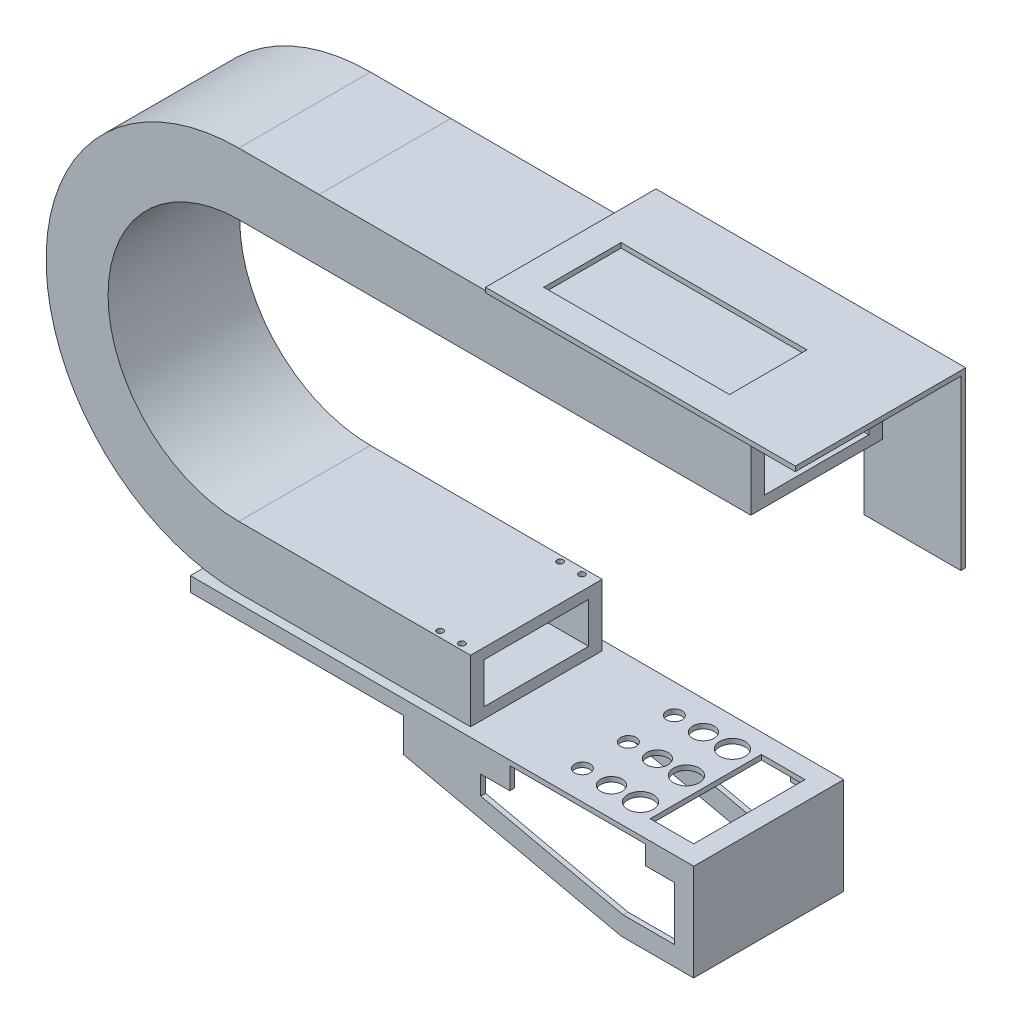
ISO-10303-21;
HEADER;
FILE_DESCRIPTION(('STEP AP214'),'2;1');
FILE_NAME('part.step','',(''),(''),'','','');
FILE_SCHEMA(('AUTOMOTIVE_DESIGN { 1 0 10303 214 1 1 1 1 }'));
ENDSEC;
DATA;
#1=APPLICATION_CONTEXT('core data for automotive mechanical design processes');
#2=APPLICATION_PROTOCOL_DEFINITION('international standard','automotive_design',2000,#1);
#3=PRODUCT_CONTEXT('',#1,'mechanical');
#4=PRODUCT('Part','Part','',(#3));
#5=PRODUCT_RELATED_PRODUCT_CATEGORY('part','',(#4));
#6=PRODUCT_DEFINITION_FORMATION('','',#4);
#7=PRODUCT_DEFINITION_CONTEXT('part definition',#1,'design');
#8=PRODUCT_DEFINITION('design','',#6,#7);
#9=PRODUCT_DEFINITION_SHAPE('','',#8);
#10=(LENGTH_UNIT() NAMED_UNIT(*) SI_UNIT(.MILLI.,.METRE.));
#11=(NAMED_UNIT(*) PLANE_ANGLE_UNIT() SI_UNIT($,.RADIAN.));
#12=(NAMED_UNIT(*) SI_UNIT($,.STERADIAN.) SOLID_ANGLE_UNIT());
#13=UNCERTAINTY_MEASURE_WITH_UNIT(LENGTH_MEASURE(1.E-05),#10,'distance_accuracy_value','');
#14=(GEOMETRIC_REPRESENTATION_CONTEXT(3) GLOBAL_UNCERTAINTY_ASSIGNED_CONTEXT((#13)) GLOBAL_UNIT_ASSIGNED_CONTEXT((#10,
#11,#12)) REPRESENTATION_CONTEXT('',''));
#15=CARTESIAN_POINT('',(0.,0.,0.));
#16=DIRECTION('',(0.,0.,1.));
#17=DIRECTION('',(1.,0.,0.));
#18=AXIS2_PLACEMENT_3D('',#15,#16,#17);
#19=CARTESIAN_POINT('',(-446.,32.,68.));
#20=DIRECTION('',(0.,1.,0.));
#21=DIRECTION('',(-1.,0.,0.));
#22=AXIS2_PLACEMENT_3D('',#19,#20,#21);
#23=PLANE('',#22);
#24=DIRECTION('',(1.,0.,0.));
#25=VECTOR('',#24,1.);
#26=CARTESIAN_POINT('',(-446.,32.,68.));
#27=LINE('',#26,#25);
#28=CARTESIAN_POINT('',(-446.,32.,68.));
#29=VERTEX_POINT('',#28);
#30=CARTESIAN_POINT('',(-272.,32.,68.));
#31=VERTEX_POINT('',#30);
#32=EDGE_CURVE('E1257',#29,#31,#27,.T.);
#33=ORIENTED_EDGE('',*,*,#32,.T.);
#34=DIRECTION('',(0.,0.,-1.));
#35=VECTOR('',#34,1.);
#36=CARTESIAN_POINT('',(-272.,32.,70.));
#37=LINE('',#36,#35);
#38=CARTESIAN_POINT('',(-272.,32.,-67.9999999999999));
#39=VERTEX_POINT('',#38);
#40=EDGE_CURVE('E877',#31,#39,#37,.T.);
#41=ORIENTED_EDGE('',*,*,#40,.T.);
#42=DIRECTION('',(1.,0.,0.));
#43=VECTOR('',#42,1.);
#44=CARTESIAN_POINT('',(-446.,32.,-68.));
#45=LINE('',#44,#43);
#46=CARTESIAN_POINT('',(-446.,32.,-68.));
#47=VERTEX_POINT('',#46);
#48=EDGE_CURVE('E1262',#47,#39,#45,.T.);
#49=ORIENTED_EDGE('',*,*,#48,.F.);
#50=DIRECTION('',(0.,0.,1.));
#51=VECTOR('',#50,1.);
#52=CARTESIAN_POINT('',(-446.,32.,68.));
#53=LINE('',#52,#51);
#54=EDGE_CURVE('E1226',#47,#29,#53,.T.);
#55=ORIENTED_EDGE('',*,*,#54,.T.);
#56=EDGE_LOOP('',(#33,#41,#49,#55));
#57=FACE_BOUND('',#56,.T.);
#58=ADVANCED_FACE('F58',(#57),#23,.T.);
#59=CARTESIAN_POINT('',(-349.51,-381.,77.5));
#60=DIRECTION('',(0.,1.,0.));
#61=DIRECTION('',(0.,0.,1.));
#62=AXIS2_PLACEMENT_3D('',#59,#60,#61);
#63=PLANE('',#62);
#64=DIRECTION('',(0.,0.,-1.));
#65=VECTOR('',#64,1.);
#66=CARTESIAN_POINT('',(-349.51,-381.,77.5));
#67=LINE('',#66,#65);
#68=CARTESIAN_POINT('',(-349.51,-381.,-72.5));
#69=VERTEX_POINT('',#68);
#70=CARTESIAN_POINT('',(-349.51,-381.,-77.5));
#71=VERTEX_POINT('',#70);
#72=EDGE_CURVE('E1164',#69,#71,#67,.T.);
#73=ORIENTED_EDGE('',*,*,#72,.F.);
#74=DIRECTION('',(-1.,0.,0.));
#75=VECTOR('',#74,1.);
#76=CARTESIAN_POINT('',(-349.51,-381.,-72.5));
#77=LINE('',#76,#75);
#78=CARTESIAN_POINT('',(-569.51,-381.,-72.5));
#79=VERTEX_POINT('',#78);
#80=EDGE_CURVE('E1014',#69,#79,#77,.T.);
#81=ORIENTED_EDGE('',*,*,#80,.T.);
#82=DIRECTION('',(0.,0.,-1.));
#83=VECTOR('',#82,1.);
#84=CARTESIAN_POINT('',(-569.51,-381.,77.5));
#85=LINE('',#84,#83);
#86=CARTESIAN_POINT('',(-569.51,-381.,-77.5));
#87=VERTEX_POINT('',#86);
#88=EDGE_CURVE('E1168',#79,#87,#85,.T.);
#89=ORIENTED_EDGE('',*,*,#88,.T.);
#90=DIRECTION('',(1.,0.,0.));
#91=VECTOR('',#90,1.);
#92=CARTESIAN_POINT('',(-349.51,-381.,-77.5));
#93=LINE('',#92,#91);
#94=EDGE_CURVE('E1139',#87,#71,#93,.T.);
#95=ORIENTED_EDGE('',*,*,#94,.T.);
#96=EDGE_LOOP('',(#73,#81,#89,#95));
#97=FACE_BOUND('',#96,.T.);
#98=ADVANCED_FACE('F1564',(#97),#63,.F.);
#99=CARTESIAN_POINT('',(-349.51,-381.,77.5));
#100=DIRECTION('',(1.,0.,0.));
#101=DIRECTION('',(0.,0.,-1.));
#102=AXIS2_PLACEMENT_3D('',#99,#100,#101);
#103=PLANE('',#102);
#104=DIRECTION('',(0.,0.,-1.));
#105=VECTOR('',#104,1.);
#106=CARTESIAN_POINT('',(-349.51,-416.,77.5));
#107=LINE('',#106,#105);
#108=CARTESIAN_POINT('',(-349.51,-416.,-72.5));
#109=VERTEX_POINT('',#108);
#110=CARTESIAN_POINT('',(-349.51,-416.,-77.5));
#111=VERTEX_POINT('',#110);
#112=EDGE_CURVE('E1160',#109,#111,#107,.T.);
#113=ORIENTED_EDGE('',*,*,#112,.F.);
#114=DIRECTION('',(0.,1.,0.));
#115=VECTOR('',#114,1.);
#116=CARTESIAN_POINT('',(-349.51,-381.,-72.5));
#117=LINE('',#116,#115);
#118=EDGE_CURVE('E1010',#109,#69,#117,.T.);
#119=ORIENTED_EDGE('',*,*,#118,.T.);
#120=ORIENTED_EDGE('',*,*,#72,.T.);
#121=DIRECTION('',(0.,-1.,0.));
#122=VECTOR('',#121,1.);
#123=CARTESIAN_POINT('',(-349.51,-381.,-77.5));
#124=LINE('',#123,#122);
#125=EDGE_CURVE('E1143',#71,#111,#124,.T.);
#126=ORIENTED_EDGE('',*,*,#125,.T.);
#127=EDGE_LOOP('',(#113,#119,#120,#126));
#128=FACE_BOUND('',#127,.T.);
#129=ADVANCED_FACE('F1570',(#128),#103,.F.);
#130=CARTESIAN_POINT('',(-349.51,-416.,77.5));
#131=DIRECTION('',(0.216930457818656,0.976187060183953,0.));
#132=DIRECTION('',(-0.976187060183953,0.216930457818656,0.));
#133=AXIS2_PLACEMENT_3D('',#130,#131,#132);
#134=PLANE('',#133);
#135=DIRECTION('',(0.,0.,-1.));
#136=VECTOR('',#135,1.);
#137=CARTESIAN_POINT('',(-124.51,-466.,77.5));
#138=LINE('',#137,#136);
#139=CARTESIAN_POINT('',(-124.51,-466.,-72.5));
#140=VERTEX_POINT('',#139);
#141=CARTESIAN_POINT('',(-124.51,-466.,-77.5));
#142=VERTEX_POINT('',#141);
#143=EDGE_CURVE('E1156',#140,#142,#138,.T.);
#144=ORIENTED_EDGE('',*,*,#143,.F.);
#145=DIRECTION('',(-0.976187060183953,0.216930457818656,0.));
#146=VECTOR('',#145,1.);
#147=CARTESIAN_POINT('',(-349.51,-416.,-72.5));
#148=LINE('',#147,#146);
#149=EDGE_CURVE('E1006',#140,#109,#148,.T.);
#150=ORIENTED_EDGE('',*,*,#149,.T.);
#151=ORIENTED_EDGE('',*,*,#112,.T.);
#152=DIRECTION('',(0.976187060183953,-0.216930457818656,0.));
#153=VECTOR('',#152,1.);
#154=CARTESIAN_POINT('',(-349.51,-416.,-77.5));
#155=LINE('',#154,#153);
#156=EDGE_CURVE('E1147',#111,#142,#155,.T.);
#157=ORIENTED_EDGE('',*,*,#156,.T.);
#158=EDGE_LOOP('',(#144,#150,#151,#157));
#159=FACE_BOUND('',#158,.T.);
#160=ADVANCED_FACE('F1885',(#159),#134,.F.);
#161=CARTESIAN_POINT('',(-269.51,-393.5,77.5));
#162=DIRECTION('',(1.,0.,0.));
#163=DIRECTION('',(0.,0.,-1.));
#164=AXIS2_PLACEMENT_3D('',#161,#162,#163);
#165=PLANE('',#164);
#166=DIRECTION('',(0.,1.,0.));
#167=VECTOR('',#166,1.);
#168=CARTESIAN_POINT('',(-269.51,-393.5,-72.5));
#169=LINE('',#168,#167);
#170=CARTESIAN_POINT('',(-269.51,-413.289901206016,-72.5));
#171=VERTEX_POINT('',#170);
#172=CARTESIAN_POINT('',(-269.51,-393.5,-72.5));
#173=VERTEX_POINT('',#172);
#174=EDGE_CURVE('E988',#171,#173,#169,.T.);
#175=ORIENTED_EDGE('',*,*,#174,.F.);
#176=DIRECTION('',(0.,0.,-1.));
#177=VECTOR('',#176,1.);
#178=CARTESIAN_POINT('',(-269.51,-413.289901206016,77.5));
#179=LINE('',#178,#177);
#180=CARTESIAN_POINT('',(-269.51,-413.289901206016,-77.5));
#181=VERTEX_POINT('',#180);
#182=EDGE_CURVE('E1105',#171,#181,#179,.T.);
#183=ORIENTED_EDGE('',*,*,#182,.T.);
#184=DIRECTION('',(0.,-1.,0.));
#185=VECTOR('',#184,1.);
#186=CARTESIAN_POINT('',(-269.51,-393.5,-77.5));
#187=LINE('',#186,#185);
#188=CARTESIAN_POINT('',(-269.51,-393.5,-77.5));
#189=VERTEX_POINT('',#188);
#190=EDGE_CURVE('E1018',#189,#181,#187,.T.);
#191=ORIENTED_EDGE('',*,*,#190,.F.);
#192=DIRECTION('',(0.,0.,-1.));
#193=VECTOR('',#192,1.);
#194=CARTESIAN_POINT('',(-269.51,-393.5,77.5));
#195=LINE('',#194,#193);
#196=EDGE_CURVE('E1039',#173,#189,#195,.T.);
#197=ORIENTED_EDGE('',*,*,#196,.F.);
#198=EDGE_LOOP('',(#175,#183,#191,#197));
#199=FACE_BOUND('',#198,.T.);
#200=ADVANCED_FACE('F1932',(#199),#165,.T.);
#201=CARTESIAN_POINT('',(-269.51,-413.289901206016,77.5));
#202=DIRECTION('',(0.216930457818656,0.976187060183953,0.));
#203=DIRECTION('',(-0.976187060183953,0.216930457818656,0.));
#204=AXIS2_PLACEMENT_3D('',#201,#202,#203);
#205=PLANE('',#204);
#206=DIRECTION('',(-0.976187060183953,0.216930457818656,0.));
#207=VECTOR('',#206,1.);
#208=CARTESIAN_POINT('',(-269.51,-413.289901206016,-72.5));
#209=LINE('',#208,#207);
#210=CARTESIAN_POINT('',(-122.314555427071,-446.,-72.5));
#211=VERTEX_POINT('',#210);
#212=EDGE_CURVE('E991',#211,#171,#209,.T.);
#213=ORIENTED_EDGE('',*,*,#212,.F.);
#214=DIRECTION('',(0.,0.,-1.));
#215=VECTOR('',#214,1.);
#216=CARTESIAN_POINT('',(-122.314555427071,-446.,77.5));
#217=LINE('',#216,#215);
#218=CARTESIAN_POINT('',(-122.314555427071,-446.,-77.5));
#219=VERTEX_POINT('',#218);
#220=EDGE_CURVE('E1101',#211,#219,#217,.T.);
#221=ORIENTED_EDGE('',*,*,#220,.T.);
#222=DIRECTION('',(0.976187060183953,-0.216930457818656,0.));
#223=VECTOR('',#222,1.);
#224=CARTESIAN_POINT('',(-269.51,-413.289901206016,-77.5));
#225=LINE('',#224,#223);
#226=EDGE_CURVE('E1043',#181,#219,#225,.T.);
#227=ORIENTED_EDGE('',*,*,#226,.F.);
#228=ORIENTED_EDGE('',*,*,#182,.F.);
#229=EDGE_LOOP('',(#213,#221,#227,#228));
#230=FACE_BOUND('',#229,.T.);
#231=ADVANCED_FACE('F1926',(#230),#205,.T.);
#232=CARTESIAN_POINT('',(-122.314555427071,-446.,77.5));
#233=DIRECTION('',(0.,1.,0.));
#234=DIRECTION('',(0.,0.,1.));
#235=AXIS2_PLACEMENT_3D('',#232,#233,#234);
#236=PLANE('',#235);
#237=DIRECTION('',(-1.,0.,0.));
#238=VECTOR('',#237,1.);
#239=CARTESIAN_POINT('',(-122.314555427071,-446.,-72.5));
#240=LINE('',#239,#238);
#241=CARTESIAN_POINT('',(-69.5100000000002,-446.,-72.5));
#242=VERTEX_POINT('',#241);
#243=EDGE_CURVE('E994',#242,#211,#240,.T.);
#244=ORIENTED_EDGE('',*,*,#243,.F.);
#245=DIRECTION('',(0.,0.,-1.));
#246=VECTOR('',#245,1.);
#247=CARTESIAN_POINT('',(-69.5100000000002,-446.,77.5));
#248=LINE('',#247,#246);
#249=CARTESIAN_POINT('',(-69.5100000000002,-446.,-77.5));
#250=VERTEX_POINT('',#249);
#251=EDGE_CURVE('E1097',#242,#250,#248,.T.);
#252=ORIENTED_EDGE('',*,*,#251,.T.);
#253=DIRECTION('',(1.,0.,0.));
#254=VECTOR('',#253,1.);
#255=CARTESIAN_POINT('',(-122.314555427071,-446.,-77.5));
#256=LINE('',#255,#254);
#257=EDGE_CURVE('E1047',#219,#250,#256,.T.);
#258=ORIENTED_EDGE('',*,*,#257,.F.);
#259=ORIENTED_EDGE('',*,*,#220,.F.);
#260=EDGE_LOOP('',(#244,#252,#258,#259));
#261=FACE_BOUND('',#260,.T.);
#262=ADVANCED_FACE('F1922',(#261),#236,.T.);
#263=CARTESIAN_POINT('',(-69.5100000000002,-446.,77.5));
#264=DIRECTION('',(-1.,0.,0.));
#265=DIRECTION('',(0.,0.,1.));
#266=AXIS2_PLACEMENT_3D('',#263,#264,#265);
#267=PLANE('',#266);
#268=DIRECTION('',(0.,-1.,0.));
#269=VECTOR('',#268,1.);
#270=CARTESIAN_POINT('',(-69.5100000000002,-446.,-72.5));
#271=LINE('',#270,#269);
#272=CARTESIAN_POINT('',(-69.5100000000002,-390.5,-72.5));
#273=VERTEX_POINT('',#272);
#274=EDGE_CURVE('E997',#273,#242,#271,.T.);
#275=ORIENTED_EDGE('',*,*,#274,.F.);
#276=DIRECTION('',(0.,0.,-1.));
#277=VECTOR('',#276,1.);
#278=CARTESIAN_POINT('',(-69.5100000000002,-390.5,77.5));
#279=LINE('',#278,#277);
#280=CARTESIAN_POINT('',(-69.5100000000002,-390.5,-77.5));
#281=VERTEX_POINT('',#280);
#282=EDGE_CURVE('E1093',#273,#281,#279,.T.);
#283=ORIENTED_EDGE('',*,*,#282,.T.);
#284=DIRECTION('',(0.,1.,0.));
#285=VECTOR('',#284,1.);
#286=CARTESIAN_POINT('',(-69.5100000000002,-446.,-77.5));
#287=LINE('',#286,#285);
#288=EDGE_CURVE('E1051',#250,#281,#287,.T.);
#289=ORIENTED_EDGE('',*,*,#288,.F.);
#290=ORIENTED_EDGE('',*,*,#251,.F.);
#291=EDGE_LOOP('',(#275,#283,#289,#290));
#292=FACE_BOUND('',#291,.T.);
#293=ADVANCED_FACE('F1916',(#292),#267,.T.);
#294=CARTESIAN_POINT('',(-69.5100000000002,-390.5,77.5));
#295=DIRECTION('',(0.,-1.,0.));
#296=DIRECTION('',(0.,0.,-1.));
#297=AXIS2_PLACEMENT_3D('',#294,#295,#296);
#298=PLANE('',#297);
#299=DIRECTION('',(1.,0.,0.));
#300=VECTOR('',#299,1.);
#301=CARTESIAN_POINT('',(-69.5100000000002,-390.5,-72.5));
#302=LINE('',#301,#300);
#303=CARTESIAN_POINT('',(-99.5100000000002,-390.5,-72.5));
#304=VERTEX_POINT('',#303);
#305=EDGE_CURVE('E1000',#304,#273,#302,.T.);
#306=ORIENTED_EDGE('',*,*,#305,.F.);
#307=DIRECTION('',(0.,0.,-1.));
#308=VECTOR('',#307,1.);
#309=CARTESIAN_POINT('',(-99.5100000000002,-390.5,77.5));
#310=LINE('',#309,#308);
#311=CARTESIAN_POINT('',(-99.5100000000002,-390.5,-77.5));
#312=VERTEX_POINT('',#311);
#313=EDGE_CURVE('E1089',#304,#312,#310,.T.);
#314=ORIENTED_EDGE('',*,*,#313,.T.);
#315=DIRECTION('',(-1.,0.,0.));
#316=VECTOR('',#315,1.);
#317=CARTESIAN_POINT('',(-69.5100000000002,-390.5,-77.5));
#318=LINE('',#317,#316);
#319=EDGE_CURVE('E1055',#281,#312,#318,.T.);
#320=ORIENTED_EDGE('',*,*,#319,.F.);
#321=ORIENTED_EDGE('',*,*,#282,.F.);
#322=EDGE_LOOP('',(#306,#314,#320,#321));
#323=FACE_BOUND('',#322,.T.);
#324=ADVANCED_FACE('F1912',(#323),#298,.T.);
#325=CARTESIAN_POINT('',(-99.5100000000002,-390.5,77.5));
#326=DIRECTION('',(-1.,0.,0.));
#327=DIRECTION('',(0.,0.,1.));
#328=AXIS2_PLACEMENT_3D('',#325,#326,#327);
#329=PLANE('',#328);
#330=DIRECTION('',(0.,-1.,0.));
#331=VECTOR('',#330,1.);
#332=CARTESIAN_POINT('',(-99.5100000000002,-390.5,-72.5));
#333=LINE('',#332,#331);
#334=CARTESIAN_POINT('',(-99.5100000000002,-370.999999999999,-72.5));
#335=VERTEX_POINT('',#334);
#336=EDGE_CURVE('E1003',#335,#304,#333,.T.);
#337=ORIENTED_EDGE('',*,*,#336,.F.);
#338=DIRECTION('',(0.,0.,-1.));
#339=VECTOR('',#338,1.);
#340=CARTESIAN_POINT('',(-99.5100000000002,-371.,77.5));
#341=LINE('',#340,#339);
#342=CARTESIAN_POINT('',(-99.5100000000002,-371.,-77.5));
#343=VERTEX_POINT('',#342);
#344=EDGE_CURVE('E1085',#335,#343,#341,.T.);
#345=ORIENTED_EDGE('',*,*,#344,.T.);
#346=DIRECTION('',(0.,1.,0.));
#347=VECTOR('',#346,1.);
#348=CARTESIAN_POINT('',(-99.5100000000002,-390.5,-77.5));
#349=LINE('',#348,#347);
#350=EDGE_CURVE('E1059',#312,#343,#349,.T.);
#351=ORIENTED_EDGE('',*,*,#350,.F.);
#352=ORIENTED_EDGE('',*,*,#313,.F.);
#353=EDGE_LOOP('',(#337,#345,#351,#352));
#354=FACE_BOUND('',#353,.T.);
#355=ADVANCED_FACE('F1561',(#354),#329,.T.);
#356=CARTESIAN_POINT('',(-239.51,-371.,77.5));
#357=DIRECTION('',(1.,0.,0.));
#358=DIRECTION('',(0.,0.,-1.));
#359=AXIS2_PLACEMENT_3D('',#356,#357,#358);
#360=PLANE('',#359);
#361=DIRECTION('',(0.,1.,0.));
#362=VECTOR('',#361,1.);
#363=CARTESIAN_POINT('',(-239.51,-371.,-72.5));
#364=LINE('',#363,#362);
#365=CARTESIAN_POINT('',(-239.51,-393.5,-72.5));
#366=VERTEX_POINT('',#365);
#367=CARTESIAN_POINT('',(-239.51,-370.999999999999,-72.5));
#368=VERTEX_POINT('',#367);
#369=EDGE_CURVE('E985',#366,#368,#364,.T.);
#370=ORIENTED_EDGE('',*,*,#369,.F.);
#371=DIRECTION('',(0.,0.,-1.));
#372=VECTOR('',#371,1.);
#373=CARTESIAN_POINT('',(-239.51,-393.5,77.5));
#374=LINE('',#373,#372);
#375=CARTESIAN_POINT('',(-239.51,-393.5,-77.5));
#376=VERTEX_POINT('',#375);
#377=EDGE_CURVE('E1077',#366,#376,#374,.T.);
#378=ORIENTED_EDGE('',*,*,#377,.T.);
#379=DIRECTION('',(0.,-1.,0.));
#380=VECTOR('',#379,1.);
#381=CARTESIAN_POINT('',(-239.51,-371.,-77.5));
#382=LINE('',#381,#380);
#383=CARTESIAN_POINT('',(-239.51,-371.,-77.5));
#384=VERTEX_POINT('',#383);
#385=EDGE_CURVE('E1067',#384,#376,#382,.T.);
#386=ORIENTED_EDGE('',*,*,#385,.F.);
#387=DIRECTION('',(0.,0.,-1.));
#388=VECTOR('',#387,1.);
#389=CARTESIAN_POINT('',(-239.51,-371.,77.5));
#390=LINE('',#389,#388);
#391=EDGE_CURVE('E1081',#368,#384,#390,.T.);
#392=ORIENTED_EDGE('',*,*,#391,.F.);
#393=EDGE_LOOP('',(#370,#378,#386,#392));
#394=FACE_BOUND('',#393,.T.);
#395=ADVANCED_FACE('F1551',(#394),#360,.T.);
#396=CARTESIAN_POINT('',(-239.51,-393.5,77.5));
#397=DIRECTION('',(0.,-1.,0.));
#398=DIRECTION('',(0.,0.,-1.));
#399=AXIS2_PLACEMENT_3D('',#396,#397,#398);
#400=PLANE('',#399);
#401=DIRECTION('',(1.,0.,0.));
#402=VECTOR('',#401,1.);
#403=CARTESIAN_POINT('',(-239.51,-393.5,-72.5));
#404=LINE('',#403,#402);
#405=EDGE_CURVE('E14',#173,#366,#404,.T.);
#406=ORIENTED_EDGE('',*,*,#405,.F.);
#407=ORIENTED_EDGE('',*,*,#196,.T.);
#408=DIRECTION('',(-1.,0.,0.));
#409=VECTOR('',#408,1.);
#410=CARTESIAN_POINT('',(-239.51,-393.5,-77.5));
#411=LINE('',#410,#409);
#412=EDGE_CURVE('E1022',#376,#189,#411,.T.);
#413=ORIENTED_EDGE('',*,*,#412,.F.);
#414=ORIENTED_EDGE('',*,*,#377,.F.);
#415=EDGE_LOOP('',(#406,#407,#413,#414));
#416=FACE_BOUND('',#415,.T.);
#417=ADVANCED_FACE('F1558',(#416),#400,.T.);
#418=CARTESIAN_POINT('',(-529.,-302.,68.));
#419=DIRECTION('',(0.,-1.,0.));
#420=DIRECTION('',(0.,0.,-1.));
#421=AXIS2_PLACEMENT_3D('',#418,#419,#420);
#422=PLANE('',#421);
#423=CARTESIAN_POINT('',(-304.51,-302.,62.));
#424=DIRECTION('',(0.,1.,0.));
#425=DIRECTION('',(0.,0.,1.));
#426=AXIS2_PLACEMENT_3D('',#423,#424,#425);
#427=CIRCLE('',#426,3.25000000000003);
#428=CARTESIAN_POINT('',(-304.51,-302.,65.25));
#429=VERTEX_POINT('',#428);
#430=EDGE_CURVE('E1181',#429,#429,#427,.T.);
#431=ORIENTED_EDGE('',*,*,#430,.F.);
#432=EDGE_LOOP('',(#431));
#433=FACE_BOUND('',#432,.T.);
#434=CARTESIAN_POINT('',(-304.51,-302.,-62.0000000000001));
#435=DIRECTION('',(0.,1.,0.));
#436=DIRECTION('',(0.,0.,1.));
#437=AXIS2_PLACEMENT_3D('',#434,#435,#436);
#438=CIRCLE('',#437,3.25000000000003);
#439=CARTESIAN_POINT('',(-304.51,-302.,-58.7500000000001));
#440=VERTEX_POINT('',#439);
#441=EDGE_CURVE('E1201',#440,#440,#438,.T.);
#442=ORIENTED_EDGE('',*,*,#441,.F.);
#443=EDGE_LOOP('',(#442));
#444=FACE_BOUND('',#443,.T.);
#445=DIRECTION('',(0.,0.,-1.));
#446=VECTOR('',#445,1.);
#447=CARTESIAN_POINT('',(-529.,-302.,68.));
#448=LINE('',#447,#446);
#449=CARTESIAN_POINT('',(-529.,-302.,68.));
#450=VERTEX_POINT('',#449);
#451=CARTESIAN_POINT('',(-529.,-302.,-68.));
#452=VERTEX_POINT('',#451);
#453=EDGE_CURVE('E1390',#450,#452,#448,.T.);
#454=ORIENTED_EDGE('',*,*,#453,.F.);
#455=DIRECTION('',(1.,0.,0.));
#456=VECTOR('',#455,1.);
#457=CARTESIAN_POINT('',(-529.,-302.,68.));
#458=LINE('',#457,#456);
#459=CARTESIAN_POINT('',(-289.51,-302.,68.));
#460=VERTEX_POINT('',#459);
#461=EDGE_CURVE('E1411',#450,#460,#458,.T.);
#462=ORIENTED_EDGE('',*,*,#461,.T.);
#463=DIRECTION('',(0.,0.,-1.));
#464=VECTOR('',#463,1.);
#465=CARTESIAN_POINT('',(-289.51,-302.,68.));
#466=LINE('',#465,#464);
#467=CARTESIAN_POINT('',(-289.51,-302.,-68.));
#468=VERTEX_POINT('',#467);
#469=EDGE_CURVE('E1443',#460,#468,#466,.T.);
#470=ORIENTED_EDGE('',*,*,#469,.T.);
#471=DIRECTION('',(1.,0.,0.));
#472=VECTOR('',#471,1.);
#473=CARTESIAN_POINT('',(-529.,-302.,-68.));
#474=LINE('',#473,#472);
#475=EDGE_CURVE('E1414',#452,#468,#474,.T.);
#476=ORIENTED_EDGE('',*,*,#475,.F.);
#477=EDGE_LOOP('',(#454,#462,#470,#476));
#478=FACE_BOUND('',#477,.T.);
#479=CARTESIAN_POINT('',(-327.01,-302.,-62.0000000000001));
#480=DIRECTION('',(0.,1.,0.));
#481=DIRECTION('',(0.,0.,1.));
#482=AXIS2_PLACEMENT_3D('',#479,#480,#481);
#483=CIRCLE('',#482,3.25000000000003);
#484=CARTESIAN_POINT('',(-327.01,-302.,-58.7500000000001));
#485=VERTEX_POINT('',#484);
#486=EDGE_CURVE('E1193',#485,#485,#483,.T.);
#487=ORIENTED_EDGE('',*,*,#486,.F.);
#488=EDGE_LOOP('',(#487));
#489=FACE_BOUND('',#488,.T.);
#490=CARTESIAN_POINT('',(-327.01,-302.,62.));
#491=DIRECTION('',(0.,1.,0.));
#492=DIRECTION('',(0.,0.,1.));
#493=AXIS2_PLACEMENT_3D('',#490,#491,#492);
#494=CIRCLE('',#493,3.25000000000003);
#495=CARTESIAN_POINT('',(-327.01,-302.,65.25));
#496=VERTEX_POINT('',#495);
#497=EDGE_CURVE('E1187',#496,#496,#494,.T.);
#498=ORIENTED_EDGE('',*,*,#497,.F.);
#499=EDGE_LOOP('',(#498));
#500=FACE_BOUND('',#499,.T.);
#501=ADVANCED_FACE('F60',(#433,#444,#478,#489,#500),#422,.F.);
#502=CARTESIAN_POINT('',(-529.,-313.,54.));
#503=DIRECTION('',(0.,-1.,0.));
#504=DIRECTION('',(0.,0.,-1.));
#505=AXIS2_PLACEMENT_3D('',#502,#503,#504);
#506=PLANE('',#505);
#507=DIRECTION('',(0.,0.,-1.));
#508=VECTOR('',#507,1.);
#509=CARTESIAN_POINT('',(-529.,-313.,54.));
#510=LINE('',#509,#508);
#511=CARTESIAN_POINT('',(-529.,-313.,54.));
#512=VERTEX_POINT('',#511);
#513=CARTESIAN_POINT('',(-529.,-313.,-54.));
#514=VERTEX_POINT('',#513);
#515=EDGE_CURVE('E1386',#512,#514,#510,.T.);
#516=ORIENTED_EDGE('',*,*,#515,.T.);
#517=DIRECTION('',(1.,0.,0.));
#518=VECTOR('',#517,1.);
#519=CARTESIAN_POINT('',(-529.,-313.,-54.));
#520=LINE('',#519,#518);
#521=CARTESIAN_POINT('',(-289.51,-313.,-54.));
#522=VERTEX_POINT('',#521);
#523=EDGE_CURVE('E1405',#514,#522,#520,.T.);
#524=ORIENTED_EDGE('',*,*,#523,.T.);
#525=DIRECTION('',(0.,0.,-1.));
#526=VECTOR('',#525,1.);
#527=CARTESIAN_POINT('',(-289.51,-313.,54.));
#528=LINE('',#527,#526);
#529=CARTESIAN_POINT('',(-289.51,-313.,54.));
#530=VERTEX_POINT('',#529);
#531=EDGE_CURVE('E1436',#530,#522,#528,.T.);
#532=ORIENTED_EDGE('',*,*,#531,.F.);
#533=DIRECTION('',(1.,0.,0.));
#534=VECTOR('',#533,1.);
#535=CARTESIAN_POINT('',(-529.,-313.,54.));
#536=LINE('',#535,#534);
#537=EDGE_CURVE('E1408',#512,#530,#536,.T.);
#538=ORIENTED_EDGE('',*,*,#537,.F.);
#539=EDGE_LOOP('',(#516,#524,#532,#538));
#540=FACE_BOUND('',#539,.T.);
#541=ADVANCED_FACE('F1656',(#540),#506,.T.);
#542=CARTESIAN_POINT('',(-529.,-355.,54.));
#543=DIRECTION('',(0.,1.,0.));
#544=DIRECTION('',(0.,0.,1.));
#545=AXIS2_PLACEMENT_3D('',#542,#543,#544);
#546=PLANE('',#545);
#547=DIRECTION('',(0.,0.,1.));
#548=VECTOR('',#547,1.);
#549=CARTESIAN_POINT('',(-529.,-355.,54.));
#550=LINE('',#549,#548);
#551=CARTESIAN_POINT('',(-529.,-355.,-54.));
#552=VERTEX_POINT('',#551);
#553=CARTESIAN_POINT('',(-529.,-355.,54.));
#554=VERTEX_POINT('',#553);
#555=EDGE_CURVE('E1382',#552,#554,#550,.T.);
#556=ORIENTED_EDGE('',*,*,#555,.T.);
#557=DIRECTION('',(1.,0.,0.));
#558=VECTOR('',#557,1.);
#559=CARTESIAN_POINT('',(-529.,-355.,54.));
#560=LINE('',#559,#558);
#561=CARTESIAN_POINT('',(-289.51,-355.,54.));
#562=VERTEX_POINT('',#561);
#563=EDGE_CURVE('E1398',#554,#562,#560,.T.);
#564=ORIENTED_EDGE('',*,*,#563,.T.);
#565=DIRECTION('',(0.,0.,1.));
#566=VECTOR('',#565,1.);
#567=CARTESIAN_POINT('',(-289.51,-355.,54.));
#568=LINE('',#567,#566);
#569=CARTESIAN_POINT('',(-289.51,-355.,-54.));
#570=VERTEX_POINT('',#569);
#571=EDGE_CURVE('E1428',#570,#562,#568,.T.);
#572=ORIENTED_EDGE('',*,*,#571,.F.);
#573=DIRECTION('',(1.,0.,0.));
#574=VECTOR('',#573,1.);
#575=CARTESIAN_POINT('',(-529.,-355.,-54.));
#576=LINE('',#575,#574);
#577=EDGE_CURVE('E1402',#552,#570,#576,.T.);
#578=ORIENTED_EDGE('',*,*,#577,.F.);
#579=EDGE_LOOP('',(#556,#564,#572,#578));
#580=FACE_BOUND('',#579,.T.);
#581=ADVANCED_FACE('F1653',(#580),#546,.T.);
#582=CARTESIAN_POINT('',(-529.,-166.99,0.));
#583=DIRECTION('',(0.,0.,1.));
#584=DIRECTION('',(1.,0.,0.));
#585=AXIS2_PLACEMENT_3D('',#582,#583,#584);
#586=CYLINDRICAL_SURFACE('',#585,199.01);
#587=DIRECTION('',(0.,0.,1.));
#588=VECTOR('',#587,1.);
#589=CARTESIAN_POINT('',(-528.952022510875,32.0199942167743,68.));
#590=LINE('',#589,#588);
#591=CARTESIAN_POINT('',(-528.952022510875,32.0199942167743,-68.));
#592=VERTEX_POINT('',#591);
#593=CARTESIAN_POINT('',(-528.952022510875,32.0199942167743,68.));
#594=VERTEX_POINT('',#593);
#595=EDGE_CURVE('E1331',#592,#594,#590,.T.);
#596=ORIENTED_EDGE('',*,*,#595,.F.);
#597=CARTESIAN_POINT('',(-529.,-166.99,-68.));
#598=DIRECTION('',(0.,0.,1.));
#599=DIRECTION('',(1.,0.,0.));
#600=AXIS2_PLACEMENT_3D('',#597,#598,#599);
#601=CIRCLE('',#600,199.01);
#602=CARTESIAN_POINT('',(-529.,-366.,-68.));
#603=VERTEX_POINT('',#602);
#604=EDGE_CURVE('E1375',#592,#603,#601,.T.);
#605=ORIENTED_EDGE('',*,*,#604,.T.);
#606=DIRECTION('',(0.,0.,1.));
#607=VECTOR('',#606,1.);
#608=CARTESIAN_POINT('',(-529.,-366.,68.));
#609=LINE('',#608,#607);
#610=CARTESIAN_POINT('',(-529.,-366.,-39.9999999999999));
#611=VERTEX_POINT('',#610);
#612=EDGE_CURVE('E1395',#603,#611,#609,.T.);
#613=ORIENTED_EDGE('',*,*,#612,.T.);
#614=CARTESIAN_POINT('',(-529.,-366.,40.0000000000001));
#615=VERTEX_POINT('',#614);
#616=EDGE_CURVE('E1399',#611,#615,#609,.T.);
#617=ORIENTED_EDGE('',*,*,#616,.T.);
#618=CARTESIAN_POINT('',(-529.,-366.,68.));
#619=VERTEX_POINT('',#618);
#620=EDGE_CURVE('E1394',#615,#619,#609,.T.);
#621=ORIENTED_EDGE('',*,*,#620,.T.);
#622=CARTESIAN_POINT('',(-529.,-166.99,68.));
#623=DIRECTION('',(0.,0.,1.));
#624=DIRECTION('',(1.,0.,0.));
#625=AXIS2_PLACEMENT_3D('',#622,#623,#624);
#626=CIRCLE('',#625,199.01);
#627=EDGE_CURVE('E1378',#594,#619,#626,.T.);
#628=ORIENTED_EDGE('',*,*,#627,.F.);
#629=EDGE_LOOP('',(#596,#605,#613,#617,#621,#628));
#630=FACE_BOUND('',#629,.T.);
#631=ADVANCED_FACE('F1649',(#630),#586,.T.);
#632=CARTESIAN_POINT('',(-529.,-166.99,0.));
#633=DIRECTION('',(0.,0.,1.));
#634=DIRECTION('',(1.,0.,0.));
#635=AXIS2_PLACEMENT_3D('',#632,#633,#634);
#636=CYLINDRICAL_SURFACE('',#635,135.01);
#637=DIRECTION('',(0.,0.,-1.));
#638=VECTOR('',#637,1.);
#639=CARTESIAN_POINT('',(-528.967451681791,-31.9800039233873,68.));
#640=LINE('',#639,#638);
#641=CARTESIAN_POINT('',(-528.967451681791,-31.9800039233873,68.));
#642=VERTEX_POINT('',#641);
#643=CARTESIAN_POINT('',(-528.967451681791,-31.9800039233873,-68.));
#644=VERTEX_POINT('',#643);
#645=EDGE_CURVE('E1328',#642,#644,#640,.T.);
#646=ORIENTED_EDGE('',*,*,#645,.F.);
#647=CARTESIAN_POINT('',(-529.,-166.99,68.));
#648=DIRECTION('',(0.,0.,1.));
#649=DIRECTION('',(1.,0.,0.));
#650=AXIS2_PLACEMENT_3D('',#647,#648,#649);
#651=CIRCLE('',#650,135.01);
#652=EDGE_CURVE('E1369',#642,#450,#651,.T.);
#653=ORIENTED_EDGE('',*,*,#652,.T.);
#654=ORIENTED_EDGE('',*,*,#453,.T.);
#655=CARTESIAN_POINT('',(-529.,-166.99,-68.));
#656=DIRECTION('',(0.,0.,1.));
#657=DIRECTION('',(1.,0.,0.));
#658=AXIS2_PLACEMENT_3D('',#655,#656,#657);
#659=CIRCLE('',#658,135.01);
#660=EDGE_CURVE('E1372',#644,#452,#659,.T.);
#661=ORIENTED_EDGE('',*,*,#660,.F.);
#662=EDGE_LOOP('',(#646,#653,#654,#661));
#663=FACE_BOUND('',#662,.T.);
#664=ADVANCED_FACE('F1645',(#663),#636,.F.);
#665=CARTESIAN_POINT('',(-529.,-166.99,0.));
#666=DIRECTION('',(0.,0.,1.));
#667=DIRECTION('',(1.,0.,0.));
#668=AXIS2_PLACEMENT_3D('',#665,#666,#667);
#669=CYLINDRICAL_SURFACE('',#668,146.01);
#670=DIRECTION('',(0.,0.,-1.));
#671=VECTOR('',#670,1.);
#672=CARTESIAN_POINT('',(-528.96479979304,-20.980004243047,54.));
#673=LINE('',#672,#671);
#674=CARTESIAN_POINT('',(-528.96479979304,-20.980004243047,54.));
#675=VERTEX_POINT('',#674);
#676=CARTESIAN_POINT('',(-528.96479979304,-20.980004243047,-54.));
#677=VERTEX_POINT('',#676);
#678=EDGE_CURVE('E1324',#675,#677,#673,.T.);
#679=ORIENTED_EDGE('',*,*,#678,.T.);
#680=CARTESIAN_POINT('',(-529.,-166.99,-54.));
#681=DIRECTION('',(0.,0.,1.));
#682=DIRECTION('',(1.,0.,0.));
#683=AXIS2_PLACEMENT_3D('',#680,#681,#682);
#684=CIRCLE('',#683,146.01);
#685=EDGE_CURVE('E1363',#677,#514,#684,.T.);
#686=ORIENTED_EDGE('',*,*,#685,.T.);
#687=ORIENTED_EDGE('',*,*,#515,.F.);
#688=CARTESIAN_POINT('',(-529.,-166.99,54.));
#689=DIRECTION('',(0.,0.,1.));
#690=DIRECTION('',(1.,0.,0.));
#691=AXIS2_PLACEMENT_3D('',#688,#689,#690);
#692=CIRCLE('',#691,146.01);
#693=EDGE_CURVE('E1366',#675,#512,#692,.T.);
#694=ORIENTED_EDGE('',*,*,#693,.F.);
#695=EDGE_LOOP('',(#679,#686,#687,#694));
#696=FACE_BOUND('',#695,.T.);
#697=ADVANCED_FACE('F1641',(#696),#669,.T.);
#698=CARTESIAN_POINT('',(-529.,-166.99,0.));
#699=DIRECTION('',(0.,0.,1.));
#700=DIRECTION('',(1.,0.,0.));
#701=AXIS2_PLACEMENT_3D('',#698,#699,#700);
#702=CYLINDRICAL_SURFACE('',#701,188.01);
#703=DIRECTION('',(0.,0.,1.));
#704=VECTOR('',#703,1.);
#705=CARTESIAN_POINT('',(-528.954674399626,21.0199945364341,54.));
#706=LINE('',#705,#704);
#707=CARTESIAN_POINT('',(-528.954674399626,21.0199945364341,-54.));
#708=VERTEX_POINT('',#707);
#709=CARTESIAN_POINT('',(-528.954674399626,21.0199945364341,54.));
#710=VERTEX_POINT('',#709);
#711=EDGE_CURVE('E1321',#708,#710,#706,.T.);
#712=ORIENTED_EDGE('',*,*,#711,.T.);
#713=CARTESIAN_POINT('',(-529.,-166.99,54.));
#714=DIRECTION('',(0.,0.,1.));
#715=DIRECTION('',(1.,0.,0.));
#716=AXIS2_PLACEMENT_3D('',#713,#714,#715);
#717=CIRCLE('',#716,188.01);
#718=EDGE_CURVE('E1357',#710,#554,#717,.T.);
#719=ORIENTED_EDGE('',*,*,#718,.T.);
#720=ORIENTED_EDGE('',*,*,#555,.F.);
#721=CARTESIAN_POINT('',(-529.,-166.99,-54.));
#722=DIRECTION('',(0.,0.,1.));
#723=DIRECTION('',(1.,0.,0.));
#724=AXIS2_PLACEMENT_3D('',#721,#722,#723);
#725=CIRCLE('',#724,188.01);
#726=EDGE_CURVE('E1360',#708,#552,#725,.T.);
#727=ORIENTED_EDGE('',*,*,#726,.F.);
#728=EDGE_LOOP('',(#712,#719,#720,#727));
#729=FACE_BOUND('',#728,.T.);
#730=ADVANCED_FACE('F1637',(#729),#702,.F.);
#731=CARTESIAN_POINT('',(-446.032548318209,32.0000039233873,68.));
#732=DIRECTION('',(-0.000241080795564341,-0.999999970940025,0.));
#733=DIRECTION('',(0.999999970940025,-0.000241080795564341,0.));
#734=AXIS2_PLACEMENT_3D('',#731,#732,#733);
#735=PLANE('',#734);
#736=DIRECTION('',(0.,0.,1.));
#737=VECTOR('',#736,1.);
#738=CARTESIAN_POINT('',(-446.032548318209,32.0000039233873,68.));
#739=LINE('',#738,#737);
#740=CARTESIAN_POINT('',(-446.032548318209,32.0000039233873,-68.));
#741=VERTEX_POINT('',#740);
#742=CARTESIAN_POINT('',(-446.032548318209,32.0000039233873,68.));
#743=VERTEX_POINT('',#742);
#744=EDGE_CURVE('E1295',#741,#743,#739,.T.);
#745=ORIENTED_EDGE('',*,*,#744,.F.);
#746=DIRECTION('',(-0.999999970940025,0.000241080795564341,0.));
#747=VECTOR('',#746,1.);
#748=CARTESIAN_POINT('',(-446.032548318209,32.0000039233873,-68.));
#749=LINE('',#748,#747);
#750=EDGE_CURVE('E1351',#741,#592,#749,.T.);
#751=ORIENTED_EDGE('',*,*,#750,.T.);
#752=ORIENTED_EDGE('',*,*,#595,.T.);
#753=DIRECTION('',(-0.999999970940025,0.000241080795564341,0.));
#754=VECTOR('',#753,1.);
#755=CARTESIAN_POINT('',(-446.032548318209,32.0000039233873,68.));
#756=LINE('',#755,#754);
#757=EDGE_CURVE('E1354',#743,#594,#756,.T.);
#758=ORIENTED_EDGE('',*,*,#757,.F.);
#759=EDGE_LOOP('',(#745,#751,#752,#758));
#760=FACE_BOUND('',#759,.T.);
#761=ADVANCED_FACE('F1633',(#760),#735,.F.);
#762=CARTESIAN_POINT('',(-446.047977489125,-31.9999942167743,68.));
#763=DIRECTION('',(0.000241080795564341,0.999999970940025,0.));
#764=DIRECTION('',(-0.999999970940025,0.000241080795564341,0.));
#765=AXIS2_PLACEMENT_3D('',#762,#763,#764);
#766=PLANE('',#765);
#767=DIRECTION('',(0.,0.,-1.));
#768=VECTOR('',#767,1.);
#769=CARTESIAN_POINT('',(-446.047977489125,-31.9999942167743,68.));
#770=LINE('',#769,#768);
#771=CARTESIAN_POINT('',(-446.047977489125,-31.9999942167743,68.));
#772=VERTEX_POINT('',#771);
#773=CARTESIAN_POINT('',(-446.047977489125,-31.9999942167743,-68.));
#774=VERTEX_POINT('',#773);
#775=EDGE_CURVE('E1292',#772,#774,#770,.T.);
#776=ORIENTED_EDGE('',*,*,#775,.F.);
#777=DIRECTION('',(-0.999999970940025,0.000241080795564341,0.));
#778=VECTOR('',#777,1.);
#779=CARTESIAN_POINT('',(-446.047977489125,-31.9999942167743,68.));
#780=LINE('',#779,#778);
#781=EDGE_CURVE('E1335',#772,#642,#780,.T.);
#782=ORIENTED_EDGE('',*,*,#781,.T.);
#783=ORIENTED_EDGE('',*,*,#645,.T.);
#784=DIRECTION('',(-0.999999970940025,0.000241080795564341,0.));
#785=VECTOR('',#784,1.);
#786=CARTESIAN_POINT('',(-446.047977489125,-31.9999942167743,-68.));
#787=LINE('',#786,#785);
#788=EDGE_CURVE('E1348',#774,#644,#787,.T.);
#789=ORIENTED_EDGE('',*,*,#788,.F.);
#790=EDGE_LOOP('',(#776,#782,#783,#789));
#791=FACE_BOUND('',#790,.T.);
#792=ADVANCED_FACE('F1629',(#791),#766,.F.);
#793=CARTESIAN_POINT('',(-446.045325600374,-20.999994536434,54.));
#794=DIRECTION('',(0.000241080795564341,0.999999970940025,0.));
#795=DIRECTION('',(-0.999999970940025,0.000241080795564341,0.));
#796=AXIS2_PLACEMENT_3D('',#793,#794,#795);
#797=PLANE('',#796);
#798=DIRECTION('',(0.,0.,-1.));
#799=VECTOR('',#798,1.);
#800=CARTESIAN_POINT('',(-446.045325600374,-20.999994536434,54.));
#801=LINE('',#800,#799);
#802=CARTESIAN_POINT('',(-446.045325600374,-20.999994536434,54.));
#803=VERTEX_POINT('',#802);
#804=CARTESIAN_POINT('',(-446.045325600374,-20.999994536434,-54.));
#805=VERTEX_POINT('',#804);
#806=EDGE_CURVE('E1288',#803,#805,#801,.T.);
#807=ORIENTED_EDGE('',*,*,#806,.T.);
#808=DIRECTION('',(-0.999999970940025,0.000241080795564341,0.));
#809=VECTOR('',#808,1.);
#810=CARTESIAN_POINT('',(-446.045325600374,-20.999994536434,-54.));
#811=LINE('',#810,#809);
#812=EDGE_CURVE('E1341',#805,#677,#811,.T.);
#813=ORIENTED_EDGE('',*,*,#812,.T.);
#814=ORIENTED_EDGE('',*,*,#678,.F.);
#815=DIRECTION('',(-0.999999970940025,0.000241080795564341,0.));
#816=VECTOR('',#815,1.);
#817=CARTESIAN_POINT('',(-446.045325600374,-20.999994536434,54.));
#818=LINE('',#817,#816);
#819=EDGE_CURVE('E1332',#803,#675,#818,.T.);
#820=ORIENTED_EDGE('',*,*,#819,.F.);
#821=EDGE_LOOP('',(#807,#813,#814,#820));
#822=FACE_BOUND('',#821,.T.);
#823=ADVANCED_FACE('F1625',(#822),#797,.T.);
#824=CARTESIAN_POINT('',(-446.03520020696,21.000004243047,54.));
#825=DIRECTION('',(-0.000241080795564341,-0.999999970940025,0.));
#826=DIRECTION('',(0.999999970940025,-0.000241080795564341,0.));
#827=AXIS2_PLACEMENT_3D('',#824,#825,#826);
#828=PLANE('',#827);
#829=DIRECTION('',(0.,0.,1.));
#830=VECTOR('',#829,1.);
#831=CARTESIAN_POINT('',(-446.03520020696,21.000004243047,54.));
#832=LINE('',#831,#830);
#833=CARTESIAN_POINT('',(-446.03520020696,21.000004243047,-54.));
#834=VERTEX_POINT('',#833);
#835=CARTESIAN_POINT('',(-446.03520020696,21.000004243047,54.));
#836=VERTEX_POINT('',#835);
#837=EDGE_CURVE('E1261',#834,#836,#832,.T.);
#838=ORIENTED_EDGE('',*,*,#837,.T.);
#839=DIRECTION('',(-0.999999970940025,0.000241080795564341,0.));
#840=VECTOR('',#839,1.);
#841=CARTESIAN_POINT('',(-446.03520020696,21.000004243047,54.));
#842=LINE('',#841,#840);
#843=EDGE_CURVE('E1327',#836,#710,#842,.T.);
#844=ORIENTED_EDGE('',*,*,#843,.T.);
#845=ORIENTED_EDGE('',*,*,#711,.F.);
#846=DIRECTION('',(-0.999999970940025,0.000241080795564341,0.));
#847=VECTOR('',#846,1.);
#848=CARTESIAN_POINT('',(-446.03520020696,21.000004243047,-54.));
#849=LINE('',#848,#847);
#850=EDGE_CURVE('E1338',#834,#708,#849,.T.);
#851=ORIENTED_EDGE('',*,*,#850,.F.);
#852=EDGE_LOOP('',(#838,#844,#845,#851));
#853=FACE_BOUND('',#852,.T.);
#854=ADVANCED_FACE('F1621',(#853),#828,.T.);
#855=CARTESIAN_POINT('',(-446.,167.01,0.));
#856=DIRECTION('',(0.,0.,-1.));
#857=DIRECTION('',(-1.,0.,0.));
#858=AXIS2_PLACEMENT_3D('',#855,#856,#857);
#859=CYLINDRICAL_SURFACE('',#858,135.01);
#860=ORIENTED_EDGE('',*,*,#54,.F.);
#861=CARTESIAN_POINT('',(-446.,167.01,-68.));
#862=DIRECTION('',(0.,0.,-1.));
#863=DIRECTION('',(-1.,0.,0.));
#864=AXIS2_PLACEMENT_3D('',#861,#862,#863);
#865=CIRCLE('',#864,135.01);
#866=EDGE_CURVE('E1315',#47,#741,#865,.T.);
#867=ORIENTED_EDGE('',*,*,#866,.T.);
#868=ORIENTED_EDGE('',*,*,#744,.T.);
#869=CARTESIAN_POINT('',(-446.,167.01,68.));
#870=DIRECTION('',(0.,0.,-1.));
#871=DIRECTION('',(-1.,0.,0.));
#872=AXIS2_PLACEMENT_3D('',#869,#870,#871);
#873=CIRCLE('',#872,135.01);
#874=EDGE_CURVE('E1318',#29,#743,#873,.T.);
#875=ORIENTED_EDGE('',*,*,#874,.F.);
#876=EDGE_LOOP('',(#860,#867,#868,#875));
#877=FACE_BOUND('',#876,.T.);
#878=ADVANCED_FACE('F1617',(#877),#859,.F.);
#879=CARTESIAN_POINT('',(-446.,167.01,0.));
#880=DIRECTION('',(0.,0.,-1.));
#881=DIRECTION('',(-1.,0.,0.));
#882=AXIS2_PLACEMENT_3D('',#879,#880,#881);
#883=CYLINDRICAL_SURFACE('',#882,199.01);
#884=DIRECTION('',(0.,0.,-1.));
#885=VECTOR('',#884,1.);
#886=CARTESIAN_POINT('',(-446.,-32.,68.));
#887=LINE('',#886,#885);
#888=CARTESIAN_POINT('',(-446.,-32.,68.));
#889=VERTEX_POINT('',#888);
#890=CARTESIAN_POINT('',(-446.,-32.,-68.));
#891=VERTEX_POINT('',#890);
#892=EDGE_CURVE('E1223',#889,#891,#887,.T.);
#893=ORIENTED_EDGE('',*,*,#892,.F.);
#894=CARTESIAN_POINT('',(-446.,167.01,68.));
#895=DIRECTION('',(0.,0.,-1.));
#896=DIRECTION('',(-1.,0.,0.));
#897=AXIS2_PLACEMENT_3D('',#894,#895,#896);
#898=CIRCLE('',#897,199.01);
#899=EDGE_CURVE('E1299',#889,#772,#898,.T.);
#900=ORIENTED_EDGE('',*,*,#899,.T.);
#901=ORIENTED_EDGE('',*,*,#775,.T.);
#902=CARTESIAN_POINT('',(-446.,167.01,-68.));
#903=DIRECTION('',(0.,0.,-1.));
#904=DIRECTION('',(-1.,0.,0.));
#905=AXIS2_PLACEMENT_3D('',#902,#903,#904);
#906=CIRCLE('',#905,199.01);
#907=EDGE_CURVE('E1312',#891,#774,#906,.T.);
#908=ORIENTED_EDGE('',*,*,#907,.F.);
#909=EDGE_LOOP('',(#893,#900,#901,#908));
#910=FACE_BOUND('',#909,.T.);
#911=ADVANCED_FACE('F1613',(#910),#883,.T.);
#912=CARTESIAN_POINT('',(-446.,167.01,0.));
#913=DIRECTION('',(0.,0.,-1.));
#914=DIRECTION('',(-1.,0.,0.));
#915=AXIS2_PLACEMENT_3D('',#912,#913,#914);
#916=CYLINDRICAL_SURFACE('',#915,188.01);
#917=DIRECTION('',(0.,0.,-1.));
#918=VECTOR('',#917,1.);
#919=CARTESIAN_POINT('',(-446.,-21.,54.));
#920=LINE('',#919,#918);
#921=CARTESIAN_POINT('',(-446.,-21.,54.));
#922=VERTEX_POINT('',#921);
#923=CARTESIAN_POINT('',(-446.,-21.,-54.));
#924=VERTEX_POINT('',#923);
#925=EDGE_CURVE('E1219',#922,#924,#920,.T.);
#926=ORIENTED_EDGE('',*,*,#925,.T.);
#927=CARTESIAN_POINT('',(-446.,167.01,-54.));
#928=DIRECTION('',(0.,0.,-1.));
#929=DIRECTION('',(-1.,0.,0.));
#930=AXIS2_PLACEMENT_3D('',#927,#928,#929);
#931=CIRCLE('',#930,188.01);
#932=EDGE_CURVE('E1305',#924,#805,#931,.T.);
#933=ORIENTED_EDGE('',*,*,#932,.T.);
#934=ORIENTED_EDGE('',*,*,#806,.F.);
#935=CARTESIAN_POINT('',(-446.,167.01,54.));
#936=DIRECTION('',(0.,0.,-1.));
#937=DIRECTION('',(-1.,0.,0.));
#938=AXIS2_PLACEMENT_3D('',#935,#936,#937);
#939=CIRCLE('',#938,188.01);
#940=EDGE_CURVE('E1296',#922,#803,#939,.T.);
#941=ORIENTED_EDGE('',*,*,#940,.F.);
#942=EDGE_LOOP('',(#926,#933,#934,#941));
#943=FACE_BOUND('',#942,.T.);
#944=ADVANCED_FACE('F1609',(#943),#916,.F.);
#945=CARTESIAN_POINT('',(-446.,167.01,0.));
#946=DIRECTION('',(0.,0.,-1.));
#947=DIRECTION('',(-1.,0.,0.));
#948=AXIS2_PLACEMENT_3D('',#945,#946,#947);
#949=CYLINDRICAL_SURFACE('',#948,146.01);
#950=DIRECTION('',(0.,0.,1.));
#951=VECTOR('',#950,1.);
#952=CARTESIAN_POINT('',(-446.,21.,54.));
#953=LINE('',#952,#951);
#954=CARTESIAN_POINT('',(-446.,21.,-54.));
#955=VERTEX_POINT('',#954);
#956=CARTESIAN_POINT('',(-446.,21.,54.));
#957=VERTEX_POINT('',#956);
#958=EDGE_CURVE('E1216',#955,#957,#953,.T.);
#959=ORIENTED_EDGE('',*,*,#958,.T.);
#960=CARTESIAN_POINT('',(-446.,167.01,54.));
#961=DIRECTION('',(0.,0.,-1.));
#962=DIRECTION('',(-1.,0.,0.));
#963=AXIS2_PLACEMENT_3D('',#960,#961,#962);
#964=CIRCLE('',#963,146.01);
#965=EDGE_CURVE('E1291',#957,#836,#964,.T.);
#966=ORIENTED_EDGE('',*,*,#965,.T.);
#967=ORIENTED_EDGE('',*,*,#837,.F.);
#968=CARTESIAN_POINT('',(-446.,167.01,-54.));
#969=DIRECTION('',(0.,0.,-1.));
#970=DIRECTION('',(-1.,0.,0.));
#971=AXIS2_PLACEMENT_3D('',#968,#969,#970);
#972=CIRCLE('',#971,146.01);
#973=EDGE_CURVE('E1302',#955,#834,#972,.T.);
#974=ORIENTED_EDGE('',*,*,#973,.F.);
#975=EDGE_LOOP('',(#959,#966,#967,#974));
#976=FACE_BOUND('',#975,.T.);
#977=ADVANCED_FACE('F1591',(#976),#949,.T.);
#978=CARTESIAN_POINT('',(-446.,32.,68.));
#979=DIRECTION('',(0.,0.,1.));
#980=DIRECTION('',(0.,-1.,0.));
#981=AXIS2_PLACEMENT_3D('',#978,#979,#980);
#982=PLANE('',#981);
#983=DIRECTION('',(0.,-1.,0.));
#984=VECTOR('',#983,1.);
#985=CARTESIAN_POINT('',(0.,32.,68.));
#986=LINE('',#985,#984);
#987=CARTESIAN_POINT('',(0.,32.,68.));
#988=VERTEX_POINT('',#987);
#989=CARTESIAN_POINT('',(0.,-32.,68.));
#990=VERTEX_POINT('',#989);
#991=EDGE_CURVE('E1242',#988,#990,#986,.T.);
#992=ORIENTED_EDGE('',*,*,#991,.F.);
#993=DIRECTION('',(1.,0.,0.));
#994=VECTOR('',#993,1.);
#995=CARTESIAN_POINT('',(-446.,32.,68.));
#996=LINE('',#995,#994);
#997=EDGE_CURVE('E923',#31,#988,#996,.T.);
#998=ORIENTED_EDGE('',*,*,#997,.F.);
#999=ORIENTED_EDGE('',*,*,#32,.F.);
#1000=ORIENTED_EDGE('',*,*,#874,.T.);
#1001=ORIENTED_EDGE('',*,*,#757,.T.);
#1002=ORIENTED_EDGE('',*,*,#627,.T.);
#1003=DIRECTION('',(1.,0.,0.));
#1004=VECTOR('',#1003,1.);
#1005=CARTESIAN_POINT('',(-529.,-366.,68.));
#1006=LINE('',#1005,#1004);
#1007=CARTESIAN_POINT('',(-289.51,-366.,68.));
#1008=VERTEX_POINT('',#1007);
#1009=EDGE_CURVE('E1421',#619,#1008,#1006,.T.);
#1010=ORIENTED_EDGE('',*,*,#1009,.T.);
#1011=DIRECTION('',(0.,1.,0.));
#1012=VECTOR('',#1011,1.);
#1013=CARTESIAN_POINT('',(-289.51,-366.,68.));
#1014=LINE('',#1013,#1012);
#1015=EDGE_CURVE('E1440',#1008,#460,#1014,.T.);
#1016=ORIENTED_EDGE('',*,*,#1015,.T.);
#1017=ORIENTED_EDGE('',*,*,#461,.F.);
#1018=ORIENTED_EDGE('',*,*,#652,.F.);
#1019=ORIENTED_EDGE('',*,*,#781,.F.);
#1020=ORIENTED_EDGE('',*,*,#899,.F.);
#1021=DIRECTION('',(1.,0.,0.));
#1022=VECTOR('',#1021,1.);
#1023=CARTESIAN_POINT('',(-446.,-32.,68.));
#1024=LINE('',#1023,#1022);
#1025=EDGE_CURVE('E1268',#889,#990,#1024,.T.);
#1026=ORIENTED_EDGE('',*,*,#1025,.T.);
#1027=EDGE_LOOP('',(#992,#998,#999,#1000,#1001,#1002,#1010,#1016,#1017,#1018,#1019,#1020,#1026));
#1028=FACE_BOUND('',#1027,.T.);
#1029=ADVANCED_FACE('F1581',(#1028),#982,.T.);
#1030=CARTESIAN_POINT('',(-446.,32.,-68.));
#1031=DIRECTION('',(0.,0.,-1.));
#1032=DIRECTION('',(0.,1.,0.));
#1033=AXIS2_PLACEMENT_3D('',#1030,#1031,#1032);
#1034=PLANE('',#1033);
#1035=DIRECTION('',(0.,1.,0.));
#1036=VECTOR('',#1035,1.);
#1037=CARTESIAN_POINT('',(0.,32.,-68.));
#1038=LINE('',#1037,#1036);
#1039=CARTESIAN_POINT('',(0.,-32.,-68.));
#1040=VERTEX_POINT('',#1039);
#1041=CARTESIAN_POINT('',(0.,32.,-68.));
#1042=VERTEX_POINT('',#1041);
#1043=EDGE_CURVE('E1250',#1040,#1042,#1038,.T.);
#1044=ORIENTED_EDGE('',*,*,#1043,.F.);
#1045=DIRECTION('',(1.,0.,0.));
#1046=VECTOR('',#1045,1.);
#1047=CARTESIAN_POINT('',(-446.,-32.,-68.));
#1048=LINE('',#1047,#1046);
#1049=EDGE_CURVE('E1265',#891,#1040,#1048,.T.);
#1050=ORIENTED_EDGE('',*,*,#1049,.F.);
#1051=ORIENTED_EDGE('',*,*,#907,.T.);
#1052=ORIENTED_EDGE('',*,*,#788,.T.);
#1053=ORIENTED_EDGE('',*,*,#660,.T.);
#1054=ORIENTED_EDGE('',*,*,#475,.T.);
#1055=DIRECTION('',(0.,-1.,0.));
#1056=VECTOR('',#1055,1.);
#1057=CARTESIAN_POINT('',(-289.51,-366.,-68.));
#1058=LINE('',#1057,#1056);
#1059=CARTESIAN_POINT('',(-289.51,-366.,-68.));
#1060=VERTEX_POINT('',#1059);
#1061=EDGE_CURVE('E1447',#468,#1060,#1058,.T.);
#1062=ORIENTED_EDGE('',*,*,#1061,.T.);
#1063=DIRECTION('',(1.,0.,0.));
#1064=VECTOR('',#1063,1.);
#1065=CARTESIAN_POINT('',(-529.,-366.,-68.));
#1066=LINE('',#1065,#1064);
#1067=EDGE_CURVE('E1417',#603,#1060,#1066,.T.);
#1068=ORIENTED_EDGE('',*,*,#1067,.F.);
#1069=ORIENTED_EDGE('',*,*,#604,.F.);
#1070=ORIENTED_EDGE('',*,*,#750,.F.);
#1071=ORIENTED_EDGE('',*,*,#866,.F.);
#1072=ORIENTED_EDGE('',*,*,#48,.T.);
#1073=DIRECTION('',(-1.,0.,0.));
#1074=VECTOR('',#1073,1.);
#1075=CARTESIAN_POINT('',(-446.,32.,-68.));
#1076=LINE('',#1075,#1074);
#1077=EDGE_CURVE('E920',#1042,#39,#1076,.T.);
#1078=ORIENTED_EDGE('',*,*,#1077,.F.);
#1079=EDGE_LOOP('',(#1044,#1050,#1051,#1052,#1053,#1054,#1062,#1068,#1069,#1070,#1071,#1072,#1078));
#1080=FACE_BOUND('',#1079,.T.);
#1081=ADVANCED_FACE('F1577',(#1080),#1034,.T.);
#1082=CARTESIAN_POINT('',(-446.,21.,54.));
#1083=DIRECTION('',(0.,0.,1.));
#1084=DIRECTION('',(0.,-1.,0.));
#1085=AXIS2_PLACEMENT_3D('',#1082,#1083,#1084);
#1086=PLANE('',#1085);
#1087=DIRECTION('',(0.,-1.,0.));
#1088=VECTOR('',#1087,1.);
#1089=CARTESIAN_POINT('',(0.,21.,54.));
#1090=LINE('',#1089,#1088);
#1091=CARTESIAN_POINT('',(0.,21.,54.));
#1092=VERTEX_POINT('',#1091);
#1093=CARTESIAN_POINT('',(0.,-21.,54.));
#1094=VERTEX_POINT('',#1093);
#1095=EDGE_CURVE('E1214',#1092,#1094,#1090,.T.);
#1096=ORIENTED_EDGE('',*,*,#1095,.T.);
#1097=DIRECTION('',(1.,0.,0.));
#1098=VECTOR('',#1097,1.);
#1099=CARTESIAN_POINT('',(-446.,-21.,54.));
#1100=LINE('',#1099,#1098);
#1101=EDGE_CURVE('E1271',#922,#1094,#1100,.T.);
#1102=ORIENTED_EDGE('',*,*,#1101,.F.);
#1103=ORIENTED_EDGE('',*,*,#940,.T.);
#1104=ORIENTED_EDGE('',*,*,#819,.T.);
#1105=ORIENTED_EDGE('',*,*,#693,.T.);
#1106=ORIENTED_EDGE('',*,*,#537,.T.);
#1107=DIRECTION('',(0.,1.,0.));
#1108=VECTOR('',#1107,1.);
#1109=CARTESIAN_POINT('',(-289.51,-355.,54.));
#1110=LINE('',#1109,#1108);
#1111=EDGE_CURVE('E1425',#562,#530,#1110,.T.);
#1112=ORIENTED_EDGE('',*,*,#1111,.F.);
#1113=ORIENTED_EDGE('',*,*,#563,.F.);
#1114=ORIENTED_EDGE('',*,*,#718,.F.);
#1115=ORIENTED_EDGE('',*,*,#843,.F.);
#1116=ORIENTED_EDGE('',*,*,#965,.F.);
#1117=DIRECTION('',(1.,0.,0.));
#1118=VECTOR('',#1117,1.);
#1119=CARTESIAN_POINT('',(-446.,21.,54.));
#1120=LINE('',#1119,#1118);
#1121=EDGE_CURVE('E1229',#957,#1092,#1120,.T.);
#1122=ORIENTED_EDGE('',*,*,#1121,.T.);
#1123=EDGE_LOOP('',(#1096,#1102,#1103,#1104,#1105,#1106,#1112,#1113,#1114,#1115,#1116,#1122));
#1124=FACE_BOUND('',#1123,.T.);
#1125=ADVANCED_FACE('F1580',(#1124),#1086,.F.);
#1126=CARTESIAN_POINT('',(-446.,-21.,54.));
#1127=DIRECTION('',(0.,-1.,0.));
#1128=DIRECTION('',(1.,0.,0.));
#1129=AXIS2_PLACEMENT_3D('',#1126,#1127,#1128);
#1130=PLANE('',#1129);
#1131=DIRECTION('',(0.,0.,-1.));
#1132=VECTOR('',#1131,1.);
#1133=CARTESIAN_POINT('',(0.,-21.,54.));
#1134=LINE('',#1133,#1132);
#1135=CARTESIAN_POINT('',(0.,-21.,-54.));
#1136=VERTEX_POINT('',#1135);
#1137=EDGE_CURVE('E1239',#1094,#1136,#1134,.T.);
#1138=ORIENTED_EDGE('',*,*,#1137,.T.);
#1139=DIRECTION('',(1.,0.,0.));
#1140=VECTOR('',#1139,1.);
#1141=CARTESIAN_POINT('',(-446.,-21.,-54.));
#1142=LINE('',#1141,#1140);
#1143=EDGE_CURVE('E1275',#924,#1136,#1142,.T.);
#1144=ORIENTED_EDGE('',*,*,#1143,.F.);
#1145=ORIENTED_EDGE('',*,*,#925,.F.);
#1146=ORIENTED_EDGE('',*,*,#1101,.T.);
#1147=EDGE_LOOP('',(#1138,#1144,#1145,#1146));
#1148=FACE_BOUND('',#1147,.T.);
#1149=ADVANCED_FACE('F1593',(#1148),#1130,.F.);
#1150=CARTESIAN_POINT('',(-446.,21.,-54.));
#1151=DIRECTION('',(0.,0.,-1.));
#1152=DIRECTION('',(-1.,0.,0.));
#1153=AXIS2_PLACEMENT_3D('',#1150,#1151,#1152);
#1154=PLANE('',#1153);
#1155=DIRECTION('',(0.,1.,0.));
#1156=VECTOR('',#1155,1.);
#1157=CARTESIAN_POINT('',(0.,21.,-54.));
#1158=LINE('',#1157,#1156);
#1159=CARTESIAN_POINT('',(0.,21.,-54.));
#1160=VERTEX_POINT('',#1159);
#1161=EDGE_CURVE('E1236',#1136,#1160,#1158,.T.);
#1162=ORIENTED_EDGE('',*,*,#1161,.T.);
#1163=DIRECTION('',(1.,0.,0.));
#1164=VECTOR('',#1163,1.);
#1165=CARTESIAN_POINT('',(-446.,21.,-54.));
#1166=LINE('',#1165,#1164);
#1167=EDGE_CURVE('E1279',#955,#1160,#1166,.T.);
#1168=ORIENTED_EDGE('',*,*,#1167,.F.);
#1169=ORIENTED_EDGE('',*,*,#973,.T.);
#1170=ORIENTED_EDGE('',*,*,#850,.T.);
#1171=ORIENTED_EDGE('',*,*,#726,.T.);
#1172=ORIENTED_EDGE('',*,*,#577,.T.);
#1173=DIRECTION('',(0.,-1.,0.));
#1174=VECTOR('',#1173,1.);
#1175=CARTESIAN_POINT('',(-289.51,-355.,-54.));
#1176=LINE('',#1175,#1174);
#1177=EDGE_CURVE('E1432',#522,#570,#1176,.T.);
#1178=ORIENTED_EDGE('',*,*,#1177,.F.);
#1179=ORIENTED_EDGE('',*,*,#523,.F.);
#1180=ORIENTED_EDGE('',*,*,#685,.F.);
#1181=ORIENTED_EDGE('',*,*,#812,.F.);
#1182=ORIENTED_EDGE('',*,*,#932,.F.);
#1183=ORIENTED_EDGE('',*,*,#1143,.T.);
#1184=EDGE_LOOP('',(#1162,#1168,#1169,#1170,#1171,#1172,#1178,#1179,#1180,#1181,#1182,#1183));
#1185=FACE_BOUND('',#1184,.T.);
#1186=ADVANCED_FACE('F1596',(#1185),#1154,.F.);
#1187=CARTESIAN_POINT('',(-446.,21.,54.));
#1188=DIRECTION('',(0.,1.,0.));
#1189=DIRECTION('',(-1.,0.,0.));
#1190=AXIS2_PLACEMENT_3D('',#1187,#1188,#1189);
#1191=PLANE('',#1190);
#1192=DIRECTION('',(0.,0.,1.));
#1193=VECTOR('',#1192,1.);
#1194=CARTESIAN_POINT('',(0.,21.,54.));
#1195=LINE('',#1194,#1193);
#1196=EDGE_CURVE('E1233',#1160,#1092,#1195,.T.);
#1197=ORIENTED_EDGE('',*,*,#1196,.T.);
#1198=ORIENTED_EDGE('',*,*,#1121,.F.);
#1199=ORIENTED_EDGE('',*,*,#958,.F.);
#1200=ORIENTED_EDGE('',*,*,#1167,.T.);
#1201=EDGE_LOOP('',(#1197,#1198,#1199,#1200));
#1202=FACE_BOUND('',#1201,.T.);
#1203=ADVANCED_FACE('F1587',(#1202),#1191,.F.);
#1204=CARTESIAN_POINT('',(-446.,-32.,68.));
#1205=DIRECTION('',(0.,-1.,0.));
#1206=DIRECTION('',(1.,0.,0.));
#1207=AXIS2_PLACEMENT_3D('',#1204,#1205,#1206);
#1208=PLANE('',#1207);
#1209=CARTESIAN_POINT('',(-37.5,-32.,-62.));
#1210=DIRECTION('',(0.,-1.,0.));
#1211=DIRECTION('',(1.,0.,0.));
#1212=AXIS2_PLACEMENT_3D('',#1209,#1210,#1211);
#1213=CIRCLE('',#1212,3.25);
#1214=CARTESIAN_POINT('',(-34.25,-32.,-62.));
#1215=VERTEX_POINT('',#1214);
#1216=EDGE_CURVE('E1209',#1215,#1215,#1213,.T.);
#1217=ORIENTED_EDGE('',*,*,#1216,.F.);
#1218=EDGE_LOOP('',(#1217));
#1219=FACE_BOUND('',#1218,.T.);
#1220=CARTESIAN_POINT('',(-15.,-32.,-62.));
#1221=DIRECTION('',(0.,-1.,0.));
#1222=DIRECTION('',(1.,0.,0.));
#1223=AXIS2_PLACEMENT_3D('',#1220,#1221,#1222);
#1224=CIRCLE('',#1223,3.24999999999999);
#1225=CARTESIAN_POINT('',(-11.75,-32.,-62.));
#1226=VERTEX_POINT('',#1225);
#1227=EDGE_CURVE('E1457',#1226,#1226,#1224,.T.);
#1228=ORIENTED_EDGE('',*,*,#1227,.F.);
#1229=EDGE_LOOP('',(#1228));
#1230=FACE_BOUND('',#1229,.T.);
#1231=CARTESIAN_POINT('',(-15.,-32.,62.));
#1232=DIRECTION('',(0.,-1.,0.));
#1233=DIRECTION('',(1.,0.,0.));
#1234=AXIS2_PLACEMENT_3D('',#1231,#1232,#1233);
#1235=CIRCLE('',#1234,3.24999999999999);
#1236=CARTESIAN_POINT('',(-11.75,-32.,62.));
#1237=VERTEX_POINT('',#1236);
#1238=EDGE_CURVE('E1215',#1237,#1237,#1235,.T.);
#1239=ORIENTED_EDGE('',*,*,#1238,.F.);
#1240=EDGE_LOOP('',(#1239));
#1241=FACE_BOUND('',#1240,.T.);
#1242=CARTESIAN_POINT('',(-37.5,-32.,62.));
#1243=DIRECTION('',(0.,-1.,0.));
#1244=DIRECTION('',(1.,0.,0.));
#1245=AXIS2_PLACEMENT_3D('',#1242,#1243,#1244);
#1246=CIRCLE('',#1245,3.25);
#1247=CARTESIAN_POINT('',(-34.25,-32.,62.));
#1248=VERTEX_POINT('',#1247);
#1249=EDGE_CURVE('E1210',#1248,#1248,#1246,.T.);
#1250=ORIENTED_EDGE('',*,*,#1249,.F.);
#1251=EDGE_LOOP('',(#1250));
#1252=FACE_BOUND('',#1251,.T.);
#1253=DIRECTION('',(0.,0.,-1.));
#1254=VECTOR('',#1253,1.);
#1255=CARTESIAN_POINT('',(0.,-32.,68.));
#1256=LINE('',#1255,#1254);
#1257=EDGE_CURVE('E1246',#990,#1040,#1256,.T.);
#1258=ORIENTED_EDGE('',*,*,#1257,.F.);
#1259=ORIENTED_EDGE('',*,*,#1025,.F.);
#1260=ORIENTED_EDGE('',*,*,#892,.T.);
#1261=ORIENTED_EDGE('',*,*,#1049,.T.);
#1262=EDGE_LOOP('',(#1258,#1259,#1260,#1261));
#1263=FACE_BOUND('',#1262,.T.);
#1264=ADVANCED_FACE('F1583',(#1219,#1230,#1241,#1252,#1263),#1208,.T.);
#1265=CARTESIAN_POINT('',(-289.51,-302.,68.));
#1266=DIRECTION('',(-1.,0.,0.));
#1267=DIRECTION('',(0.,0.,-1.));
#1268=AXIS2_PLACEMENT_3D('',#1265,#1266,#1267);
#1269=PLANE('',#1268);
#1270=ORIENTED_EDGE('',*,*,#1111,.T.);
#1271=ORIENTED_EDGE('',*,*,#531,.T.);
#1272=ORIENTED_EDGE('',*,*,#1177,.T.);
#1273=ORIENTED_EDGE('',*,*,#571,.T.);
#1274=EDGE_LOOP('',(#1270,#1271,#1272,#1273));
#1275=FACE_BOUND('',#1274,.T.);
#1276=ORIENTED_EDGE('',*,*,#1015,.F.);
#1277=DIRECTION('',(0.,0.,1.));
#1278=VECTOR('',#1277,1.);
#1279=CARTESIAN_POINT('',(-289.51,-366.,68.));
#1280=LINE('',#1279,#1278);
#1281=EDGE_CURVE('E1450',#1060,#1008,#1280,.T.);
#1282=ORIENTED_EDGE('',*,*,#1281,.F.);
#1283=ORIENTED_EDGE('',*,*,#1061,.F.);
#1284=ORIENTED_EDGE('',*,*,#469,.F.);
#1285=EDGE_LOOP('',(#1276,#1282,#1283,#1284));
#1286=FACE_BOUND('',#1285,.T.);
#1287=ADVANCED_FACE('F1586',(#1275,#1286),#1269,.F.);
#1288=CARTESIAN_POINT('',(0.,-32.,68.));
#1289=DIRECTION('',(1.,0.,0.));
#1290=DIRECTION('',(0.,0.,-1.));
#1291=AXIS2_PLACEMENT_3D('',#1288,#1289,#1290);
#1292=PLANE('',#1291);
#1293=ORIENTED_EDGE('',*,*,#1095,.F.);
#1294=ORIENTED_EDGE('',*,*,#1196,.F.);
#1295=ORIENTED_EDGE('',*,*,#1161,.F.);
#1296=ORIENTED_EDGE('',*,*,#1137,.F.);
#1297=EDGE_LOOP('',(#1293,#1294,#1295,#1296));
#1298=FACE_BOUND('',#1297,.T.);
#1299=ORIENTED_EDGE('',*,*,#991,.T.);
#1300=ORIENTED_EDGE('',*,*,#1257,.T.);
#1301=ORIENTED_EDGE('',*,*,#1043,.T.);
#1302=DIRECTION('',(0.,0.,1.));
#1303=VECTOR('',#1302,1.);
#1304=CARTESIAN_POINT('',(0.,32.,68.));
#1305=LINE('',#1304,#1303);
#1306=EDGE_CURVE('E1220',#1042,#988,#1305,.T.);
#1307=ORIENTED_EDGE('',*,*,#1306,.T.);
#1308=EDGE_LOOP('',(#1299,#1300,#1301,#1307));
#1309=FACE_BOUND('',#1308,.T.);
#1310=ADVANCED_FACE('F1575',(#1298,#1309),#1292,.T.);
#1311=CARTESIAN_POINT('',(-37.5,32.,62.));
#1312=DIRECTION('',(0.,1.,0.));
#1313=DIRECTION('',(0.,0.,1.));
#1314=AXIS2_PLACEMENT_3D('',#1311,#1312,#1313);
#1315=CYLINDRICAL_SURFACE('',#1314,3.25);
#1316=ORIENTED_EDGE('',*,*,#1249,.T.);
#1317=EDGE_LOOP('',(#1316));
#1318=FACE_BOUND('',#1317,.T.);
#1319=CARTESIAN_POINT('',(-37.5,32.,62.));
#1320=DIRECTION('',(0.,-1.,0.));
#1321=DIRECTION('',(0.,0.,-1.));
#1322=AXIS2_PLACEMENT_3D('',#1319,#1320,#1321);
#1323=CIRCLE('',#1322,3.25);
#1324=CARTESIAN_POINT('',(-37.5,32.,58.75));
#1325=VERTEX_POINT('',#1324);
#1326=EDGE_CURVE('E916',#1325,#1325,#1323,.F.);
#1327=ORIENTED_EDGE('',*,*,#1326,.T.);
#1328=EDGE_LOOP('',(#1327));
#1329=FACE_BOUND('',#1328,.T.);
#1330=ADVANCED_FACE('F1692',(#1318,#1329),#1315,.F.);
#1331=CARTESIAN_POINT('',(-15.,32.,62.));
#1332=DIRECTION('',(0.,1.,0.));
#1333=DIRECTION('',(0.,0.,1.));
#1334=AXIS2_PLACEMENT_3D('',#1331,#1332,#1333);
#1335=CYLINDRICAL_SURFACE('',#1334,3.24999999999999);
#1336=ORIENTED_EDGE('',*,*,#1238,.T.);
#1337=EDGE_LOOP('',(#1336));
#1338=FACE_BOUND('',#1337,.T.);
#1339=CARTESIAN_POINT('',(-15.,32.,62.));
#1340=DIRECTION('',(0.,-1.,0.));
#1341=DIRECTION('',(0.,0.,-1.));
#1342=AXIS2_PLACEMENT_3D('',#1339,#1340,#1341);
#1343=CIRCLE('',#1342,3.24999999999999);
#1344=CARTESIAN_POINT('',(-15.,32.,58.75));
#1345=VERTEX_POINT('',#1344);
#1346=EDGE_CURVE('E912',#1345,#1345,#1343,.F.);
#1347=ORIENTED_EDGE('',*,*,#1346,.T.);
#1348=EDGE_LOOP('',(#1347));
#1349=FACE_BOUND('',#1348,.T.);
#1350=ADVANCED_FACE('F2565',(#1338,#1349),#1335,.F.);
#1351=CARTESIAN_POINT('',(-15.,32.,-62.));
#1352=DIRECTION('',(0.,1.,0.));
#1353=DIRECTION('',(0.,0.,1.));
#1354=AXIS2_PLACEMENT_3D('',#1351,#1352,#1353);
#1355=CYLINDRICAL_SURFACE('',#1354,3.24999999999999);
#1356=ORIENTED_EDGE('',*,*,#1227,.T.);
#1357=EDGE_LOOP('',(#1356));
#1358=FACE_BOUND('',#1357,.T.);
#1359=CARTESIAN_POINT('',(-15.,32.,-62.));
#1360=DIRECTION('',(0.,-1.,0.));
#1361=DIRECTION('',(0.,0.,-1.));
#1362=AXIS2_PLACEMENT_3D('',#1359,#1360,#1361);
#1363=CIRCLE('',#1362,3.24999999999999);
#1364=CARTESIAN_POINT('',(-15.,32.,-65.25));
#1365=VERTEX_POINT('',#1364);
#1366=EDGE_CURVE('E908',#1365,#1365,#1363,.F.);
#1367=ORIENTED_EDGE('',*,*,#1366,.T.);
#1368=EDGE_LOOP('',(#1367));
#1369=FACE_BOUND('',#1368,.T.);
#1370=ADVANCED_FACE('F2574',(#1358,#1369),#1355,.F.);
#1371=CARTESIAN_POINT('',(-37.5,32.,-62.));
#1372=DIRECTION('',(0.,1.,0.));
#1373=DIRECTION('',(0.,0.,1.));
#1374=AXIS2_PLACEMENT_3D('',#1371,#1372,#1373);
#1375=CYLINDRICAL_SURFACE('',#1374,3.25);
#1376=ORIENTED_EDGE('',*,*,#1216,.T.);
#1377=EDGE_LOOP('',(#1376));
#1378=FACE_BOUND('',#1377,.T.);
#1379=CARTESIAN_POINT('',(-37.5,32.,-62.));
#1380=DIRECTION('',(0.,-1.,0.));
#1381=DIRECTION('',(0.,0.,-1.));
#1382=AXIS2_PLACEMENT_3D('',#1379,#1380,#1381);
#1383=CIRCLE('',#1382,3.25);
#1384=CARTESIAN_POINT('',(-37.5,32.,-65.25));
#1385=VERTEX_POINT('',#1384);
#1386=EDGE_CURVE('E890',#1385,#1385,#1383,.F.);
#1387=ORIENTED_EDGE('',*,*,#1386,.T.);
#1388=EDGE_LOOP('',(#1387));
#1389=FACE_BOUND('',#1388,.T.);
#1390=ADVANCED_FACE('F1954',(#1378,#1389),#1375,.F.);
#1391=CARTESIAN_POINT('',(-304.51,-302.,-62.0000000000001));
#1392=DIRECTION('',(0.,1.,0.));
#1393=DIRECTION('',(0.,0.,1.));
#1394=AXIS2_PLACEMENT_3D('',#1391,#1392,#1393);
#1395=CYLINDRICAL_SURFACE('',#1394,3.25000000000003);
#1396=CARTESIAN_POINT('',(-304.51,-366.,-62.0000000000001));
#1397=DIRECTION('',(0.,1.,0.));
#1398=DIRECTION('',(0.,0.,1.));
#1399=AXIS2_PLACEMENT_3D('',#1396,#1397,#1398);
#1400=CIRCLE('',#1399,3.25000000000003);
#1401=CARTESIAN_POINT('',(-304.51,-366.,-58.7500000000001));
#1402=VERTEX_POINT('',#1401);
#1403=EDGE_CURVE('E1205',#1402,#1402,#1400,.T.);
#1404=ORIENTED_EDGE('',*,*,#1403,.F.);
#1405=EDGE_LOOP('',(#1404));
#1406=FACE_BOUND('',#1405,.T.);
#1407=ORIENTED_EDGE('',*,*,#441,.T.);
#1408=EDGE_LOOP('',(#1407));
#1409=FACE_BOUND('',#1408,.T.);
#1410=ADVANCED_FACE('F1959',(#1406,#1409),#1395,.F.);
#1411=CARTESIAN_POINT('',(-327.01,-302.,-62.0000000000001));
#1412=DIRECTION('',(0.,1.,0.));
#1413=DIRECTION('',(0.,0.,1.));
#1414=AXIS2_PLACEMENT_3D('',#1411,#1412,#1413);
#1415=CYLINDRICAL_SURFACE('',#1414,3.25000000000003);
#1416=CARTESIAN_POINT('',(-327.01,-366.,-62.0000000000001));
#1417=DIRECTION('',(0.,1.,0.));
#1418=DIRECTION('',(0.,0.,1.));
#1419=AXIS2_PLACEMENT_3D('',#1416,#1417,#1418);
#1420=CIRCLE('',#1419,3.25000000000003);
#1421=CARTESIAN_POINT('',(-327.01,-366.,-58.7500000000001));
#1422=VERTEX_POINT('',#1421);
#1423=EDGE_CURVE('E1197',#1422,#1422,#1420,.T.);
#1424=ORIENTED_EDGE('',*,*,#1423,.F.);
#1425=EDGE_LOOP('',(#1424));
#1426=FACE_BOUND('',#1425,.T.);
#1427=ORIENTED_EDGE('',*,*,#486,.T.);
#1428=EDGE_LOOP('',(#1427));
#1429=FACE_BOUND('',#1428,.T.);
#1430=ADVANCED_FACE('F1963',(#1426,#1429),#1415,.F.);
#1431=CARTESIAN_POINT('',(-327.01,-302.,62.));
#1432=DIRECTION('',(0.,1.,0.));
#1433=DIRECTION('',(0.,0.,1.));
#1434=AXIS2_PLACEMENT_3D('',#1431,#1432,#1433);
#1435=CYLINDRICAL_SURFACE('',#1434,3.25000000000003);
#1436=CARTESIAN_POINT('',(-327.01,-366.,62.));
#1437=DIRECTION('',(0.,1.,0.));
#1438=DIRECTION('',(0.,0.,1.));
#1439=AXIS2_PLACEMENT_3D('',#1436,#1437,#1438);
#1440=CIRCLE('',#1439,3.25000000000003);
#1441=CARTESIAN_POINT('',(-327.01,-366.,65.25));
#1442=VERTEX_POINT('',#1441);
#1443=EDGE_CURVE('E1190',#1442,#1442,#1440,.T.);
#1444=ORIENTED_EDGE('',*,*,#1443,.F.);
#1445=EDGE_LOOP('',(#1444));
#1446=FACE_BOUND('',#1445,.T.);
#1447=ORIENTED_EDGE('',*,*,#497,.T.);
#1448=EDGE_LOOP('',(#1447));
#1449=FACE_BOUND('',#1448,.T.);
#1450=ADVANCED_FACE('F1973',(#1446,#1449),#1435,.F.);
#1451=CARTESIAN_POINT('',(-304.51,-302.,62.));
#1452=DIRECTION('',(0.,1.,0.));
#1453=DIRECTION('',(0.,0.,1.));
#1454=AXIS2_PLACEMENT_3D('',#1451,#1452,#1453);
#1455=CYLINDRICAL_SURFACE('',#1454,3.25000000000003);
#1456=CARTESIAN_POINT('',(-304.51,-366.,62.));
#1457=DIRECTION('',(0.,1.,0.));
#1458=DIRECTION('',(0.,0.,1.));
#1459=AXIS2_PLACEMENT_3D('',#1456,#1457,#1458);
#1460=CIRCLE('',#1459,3.25000000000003);
#1461=CARTESIAN_POINT('',(-304.51,-366.,65.25));
#1462=VERTEX_POINT('',#1461);
#1463=EDGE_CURVE('E1184',#1462,#1462,#1460,.T.);
#1464=ORIENTED_EDGE('',*,*,#1463,.F.);
#1465=EDGE_LOOP('',(#1464));
#1466=FACE_BOUND('',#1465,.T.);
#1467=ORIENTED_EDGE('',*,*,#430,.T.);
#1468=EDGE_LOOP('',(#1467));
#1469=FACE_BOUND('',#1468,.T.);
#1470=ADVANCED_FACE('F1983',(#1466,#1469),#1455,.F.);
#1471=CARTESIAN_POINT('',(-569.51,-366.,77.5));
#1472=DIRECTION('',(0.,-1.,0.));
#1473=DIRECTION('',(0.,0.,-1.));
#1474=AXIS2_PLACEMENT_3D('',#1471,#1472,#1473);
#1475=PLANE('',#1474);
#1476=ORIENTED_EDGE('',*,*,#1463,.T.);
#1477=EDGE_LOOP('',(#1476));
#1478=FACE_BOUND('',#1477,.T.);
#1479=ADVANCED_FACE('F1993',(#1478),#1475,.F.);
#1480=ORIENTED_EDGE('',*,*,#1443,.T.);
#1481=EDGE_LOOP('',(#1480));
#1482=FACE_BOUND('',#1481,.T.);
#1483=ADVANCED_FACE('F2012',(#1482),#1475,.F.);
#1484=ORIENTED_EDGE('',*,*,#1423,.T.);
#1485=EDGE_LOOP('',(#1484));
#1486=FACE_BOUND('',#1485,.T.);
#1487=ADVANCED_FACE('F2022',(#1486),#1475,.F.);
#1488=ORIENTED_EDGE('',*,*,#1403,.T.);
#1489=EDGE_LOOP('',(#1488));
#1490=FACE_BOUND('',#1489,.T.);
#1491=ADVANCED_FACE('F2031',(#1490),#1475,.F.);
#1492=CARTESIAN_POINT('',(-49.5100000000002,-366.,77.5));
#1493=DIRECTION('',(0.,0.,-1.));
#1494=DIRECTION('',(-1.,0.,0.));
#1495=AXIS2_PLACEMENT_3D('',#1492,#1493,#1494);
#1496=PLANE('',#1495);
#1497=DIRECTION('',(0.,1.,0.));
#1498=VECTOR('',#1497,1.);
#1499=CARTESIAN_POINT('',(-49.5100000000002,-466.,77.5));
#1500=LINE('',#1499,#1498);
#1501=CARTESIAN_POINT('',(-49.5100000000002,-466.,77.5));
#1502=VERTEX_POINT('',#1501);
#1503=CARTESIAN_POINT('',(-49.5100000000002,-366.,77.5));
#1504=VERTEX_POINT('',#1503);
#1505=EDGE_CURVE('E1110',#1502,#1504,#1500,.T.);
#1506=ORIENTED_EDGE('',*,*,#1505,.T.);
#1507=DIRECTION('',(-1.,0.,0.));
#1508=VECTOR('',#1507,1.);
#1509=CARTESIAN_POINT('',(-569.51,-366.,77.5));
#1510=LINE('',#1509,#1508);
#1511=CARTESIAN_POINT('',(-569.51,-366.,77.5));
#1512=VERTEX_POINT('',#1511);
#1513=EDGE_CURVE('E1113',#1504,#1512,#1510,.T.);
#1514=ORIENTED_EDGE('',*,*,#1513,.T.);
#1515=DIRECTION('',(0.,-1.,0.));
#1516=VECTOR('',#1515,1.);
#1517=CARTESIAN_POINT('',(-569.51,-381.,77.5));
#1518=LINE('',#1517,#1516);
#1519=CARTESIAN_POINT('',(-569.51,-381.,77.5));
#1520=VERTEX_POINT('',#1519);
#1521=EDGE_CURVE('E1117',#1512,#1520,#1518,.T.);
#1522=ORIENTED_EDGE('',*,*,#1521,.T.);
#1523=DIRECTION('',(1.,0.,0.));
#1524=VECTOR('',#1523,1.);
#1525=CARTESIAN_POINT('',(-349.51,-381.,77.5));
#1526=LINE('',#1525,#1524);
#1527=CARTESIAN_POINT('',(-349.51,-381.,77.5));
#1528=VERTEX_POINT('',#1527);
#1529=EDGE_CURVE('E1120',#1520,#1528,#1526,.T.);
#1530=ORIENTED_EDGE('',*,*,#1529,.T.);
#1531=DIRECTION('',(0.,-1.,0.));
#1532=VECTOR('',#1531,1.);
#1533=CARTESIAN_POINT('',(-349.51,-381.,77.5));
#1534=LINE('',#1533,#1532);
#1535=CARTESIAN_POINT('',(-349.51,-416.,77.5));
#1536=VERTEX_POINT('',#1535);
#1537=EDGE_CURVE('E1123',#1528,#1536,#1534,.T.);
#1538=ORIENTED_EDGE('',*,*,#1537,.T.);
#1539=DIRECTION('',(0.976187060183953,-0.216930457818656,0.));
#1540=VECTOR('',#1539,1.);
#1541=CARTESIAN_POINT('',(-349.51,-416.,77.5));
#1542=LINE('',#1541,#1540);
#1543=CARTESIAN_POINT('',(-124.51,-466.,77.5));
#1544=VERTEX_POINT('',#1543);
#1545=EDGE_CURVE('E1125',#1536,#1544,#1542,.T.);
#1546=ORIENTED_EDGE('',*,*,#1545,.T.);
#1547=DIRECTION('',(1.,0.,0.));
#1548=VECTOR('',#1547,1.);
#1549=CARTESIAN_POINT('',(-124.51,-466.,77.5));
#1550=LINE('',#1549,#1548);
#1551=EDGE_CURVE('E1127',#1544,#1502,#1550,.T.);
#1552=ORIENTED_EDGE('',*,*,#1551,.T.);
#1553=EDGE_LOOP('',(#1506,#1514,#1522,#1530,#1538,#1546,#1552));
#1554=FACE_BOUND('',#1553,.T.);
#1555=DIRECTION('',(0.,-1.,0.));
#1556=VECTOR('',#1555,1.);
#1557=CARTESIAN_POINT('',(-269.51,-393.5,77.5));
#1558=LINE('',#1557,#1556);
#1559=CARTESIAN_POINT('',(-269.51,-393.5,77.5));
#1560=VERTEX_POINT('',#1559);
#1561=CARTESIAN_POINT('',(-269.51,-413.289901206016,77.5));
#1562=VERTEX_POINT('',#1561);
#1563=EDGE_CURVE('E1019',#1560,#1562,#1558,.T.);
#1564=ORIENTED_EDGE('',*,*,#1563,.F.);
#1565=DIRECTION('',(-1.,0.,0.));
#1566=VECTOR('',#1565,1.);
#1567=CARTESIAN_POINT('',(-239.51,-393.5,77.5));
#1568=LINE('',#1567,#1566);
#1569=CARTESIAN_POINT('',(-239.51,-393.5,77.5));
#1570=VERTEX_POINT('',#1569);
#1571=EDGE_CURVE('E1037',#1570,#1560,#1568,.T.);
#1572=ORIENTED_EDGE('',*,*,#1571,.F.);
#1573=DIRECTION('',(0.,-1.,0.));
#1574=VECTOR('',#1573,1.);
#1575=CARTESIAN_POINT('',(-239.51,-371.,77.5));
#1576=LINE('',#1575,#1574);
#1577=CARTESIAN_POINT('',(-239.51,-371.,77.5));
#1578=VERTEX_POINT('',#1577);
#1579=EDGE_CURVE('E1034',#1578,#1570,#1576,.T.);
#1580=ORIENTED_EDGE('',*,*,#1579,.F.);
#1581=DIRECTION('',(-1.,0.,0.));
#1582=VECTOR('',#1581,1.);
#1583=CARTESIAN_POINT('',(-99.5100000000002,-371.,77.5));
#1584=LINE('',#1583,#1582);
#1585=CARTESIAN_POINT('',(-99.5100000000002,-371.,77.5));
#1586=VERTEX_POINT('',#1585);
#1587=EDGE_CURVE('E1032',#1586,#1578,#1584,.T.);
#1588=ORIENTED_EDGE('',*,*,#1587,.F.);
#1589=DIRECTION('',(0.,1.,0.));
#1590=VECTOR('',#1589,1.);
#1591=CARTESIAN_POINT('',(-99.5100000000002,-390.5,77.5));
#1592=LINE('',#1591,#1590);
#1593=CARTESIAN_POINT('',(-99.5100000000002,-390.5,77.5));
#1594=VERTEX_POINT('',#1593);
#1595=EDGE_CURVE('E1030',#1594,#1586,#1592,.T.);
#1596=ORIENTED_EDGE('',*,*,#1595,.F.);
#1597=DIRECTION('',(-1.,0.,0.));
#1598=VECTOR('',#1597,1.);
#1599=CARTESIAN_POINT('',(-69.5100000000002,-390.5,77.5));
#1600=LINE('',#1599,#1598);
#1601=CARTESIAN_POINT('',(-69.5100000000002,-390.5,77.5));
#1602=VERTEX_POINT('',#1601);
#1603=EDGE_CURVE('E1028',#1602,#1594,#1600,.T.);
#1604=ORIENTED_EDGE('',*,*,#1603,.F.);
#1605=DIRECTION('',(0.,1.,0.));
#1606=VECTOR('',#1605,1.);
#1607=CARTESIAN_POINT('',(-69.5100000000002,-446.,77.5));
#1608=LINE('',#1607,#1606);
#1609=CARTESIAN_POINT('',(-69.5100000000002,-446.,77.5));
#1610=VERTEX_POINT('',#1609);
#1611=EDGE_CURVE('E1026',#1610,#1602,#1608,.T.);
#1612=ORIENTED_EDGE('',*,*,#1611,.F.);
#1613=DIRECTION('',(1.,0.,0.));
#1614=VECTOR('',#1613,1.);
#1615=CARTESIAN_POINT('',(-122.314555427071,-446.,77.5));
#1616=LINE('',#1615,#1614);
#1617=CARTESIAN_POINT('',(-122.314555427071,-446.,77.5));
#1618=VERTEX_POINT('',#1617);
#1619=EDGE_CURVE('E1024',#1618,#1610,#1616,.T.);
#1620=ORIENTED_EDGE('',*,*,#1619,.F.);
#1621=DIRECTION('',(0.976187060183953,-0.216930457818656,0.));
#1622=VECTOR('',#1621,1.);
#1623=CARTESIAN_POINT('',(-269.51,-413.289901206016,77.5));
#1624=LINE('',#1623,#1622);
#1625=EDGE_CURVE('E1021',#1562,#1618,#1624,.T.);
#1626=ORIENTED_EDGE('',*,*,#1625,.F.);
#1627=EDGE_LOOP('',(#1564,#1572,#1580,#1588,#1596,#1604,#1612,#1620,#1626));
#1628=FACE_BOUND('',#1627,.T.);
#1629=ADVANCED_FACE('F1479',(#1554,#1628),#1496,.F.);
#1630=CARTESIAN_POINT('',(-49.5100000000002,-366.,-77.5));
#1631=DIRECTION('',(0.,0.,-1.));
#1632=DIRECTION('',(-1.,0.,0.));
#1633=AXIS2_PLACEMENT_3D('',#1630,#1631,#1632);
#1634=PLANE('',#1633);
#1635=DIRECTION('',(0.,1.,0.));
#1636=VECTOR('',#1635,1.);
#1637=CARTESIAN_POINT('',(-49.5100000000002,-466.,-77.5));
#1638=LINE('',#1637,#1636);
#1639=CARTESIAN_POINT('',(-49.5100000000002,-466.,-77.5));
#1640=VERTEX_POINT('',#1639);
#1641=CARTESIAN_POINT('',(-49.5100000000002,-366.,-77.5));
#1642=VERTEX_POINT('',#1641);
#1643=EDGE_CURVE('E1109',#1640,#1642,#1638,.T.);
#1644=ORIENTED_EDGE('',*,*,#1643,.F.);
#1645=DIRECTION('',(1.,0.,0.));
#1646=VECTOR('',#1645,1.);
#1647=CARTESIAN_POINT('',(-124.51,-466.,-77.5));
#1648=LINE('',#1647,#1646);
#1649=EDGE_CURVE('E1114',#142,#1640,#1648,.T.);
#1650=ORIENTED_EDGE('',*,*,#1649,.F.);
#1651=ORIENTED_EDGE('',*,*,#156,.F.);
#1652=ORIENTED_EDGE('',*,*,#125,.F.);
#1653=ORIENTED_EDGE('',*,*,#94,.F.);
#1654=DIRECTION('',(0.,-1.,0.));
#1655=VECTOR('',#1654,1.);
#1656=CARTESIAN_POINT('',(-569.51,-381.,-77.5));
#1657=LINE('',#1656,#1655);
#1658=CARTESIAN_POINT('',(-569.51,-366.,-77.5));
#1659=VERTEX_POINT('',#1658);
#1660=EDGE_CURVE('E1136',#1659,#87,#1657,.T.);
#1661=ORIENTED_EDGE('',*,*,#1660,.F.);
#1662=DIRECTION('',(-1.,0.,0.));
#1663=VECTOR('',#1662,1.);
#1664=CARTESIAN_POINT('',(-569.51,-366.,-77.5));
#1665=LINE('',#1664,#1663);
#1666=EDGE_CURVE('E1133',#1642,#1659,#1665,.T.);
#1667=ORIENTED_EDGE('',*,*,#1666,.F.);
#1668=EDGE_LOOP('',(#1644,#1650,#1651,#1652,#1653,#1661,#1667));
#1669=FACE_BOUND('',#1668,.T.);
#1670=ORIENTED_EDGE('',*,*,#412,.T.);
#1671=ORIENTED_EDGE('',*,*,#190,.T.);
#1672=ORIENTED_EDGE('',*,*,#226,.T.);
#1673=ORIENTED_EDGE('',*,*,#257,.T.);
#1674=ORIENTED_EDGE('',*,*,#288,.T.);
#1675=ORIENTED_EDGE('',*,*,#319,.T.);
#1676=ORIENTED_EDGE('',*,*,#350,.T.);
#1677=DIRECTION('',(-1.,0.,0.));
#1678=VECTOR('',#1677,1.);
#1679=CARTESIAN_POINT('',(-99.5100000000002,-371.,-77.5));
#1680=LINE('',#1679,#1678);
#1681=EDGE_CURVE('E1063',#343,#384,#1680,.T.);
#1682=ORIENTED_EDGE('',*,*,#1681,.T.);
#1683=ORIENTED_EDGE('',*,*,#385,.T.);
#1684=EDGE_LOOP('',(#1670,#1671,#1672,#1673,#1674,#1675,#1676,#1682,#1683));
#1685=FACE_BOUND('',#1684,.T.);
#1686=ADVANCED_FACE('F1892',(#1669,#1685),#1634,.T.);
#1687=CARTESIAN_POINT('',(-49.5100000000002,-466.,77.5));
#1688=DIRECTION('',(-1.,0.,0.));
#1689=DIRECTION('',(0.,0.,1.));
#1690=AXIS2_PLACEMENT_3D('',#1687,#1688,#1689);
#1691=PLANE('',#1690);
#1692=ORIENTED_EDGE('',*,*,#1643,.T.);
#1693=DIRECTION('',(0.,0.,-1.));
#1694=VECTOR('',#1693,1.);
#1695=CARTESIAN_POINT('',(-49.5100000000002,-366.,77.5));
#1696=LINE('',#1695,#1694);
#1697=EDGE_CURVE('E1177',#1504,#1642,#1696,.T.);
#1698=ORIENTED_EDGE('',*,*,#1697,.F.);
#1699=ORIENTED_EDGE('',*,*,#1505,.F.);
#1700=DIRECTION('',(0.,0.,-1.));
#1701=VECTOR('',#1700,1.);
#1702=CARTESIAN_POINT('',(-49.5100000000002,-466.,77.5));
#1703=LINE('',#1702,#1701);
#1704=EDGE_CURVE('E1129',#1502,#1640,#1703,.T.);
#1705=ORIENTED_EDGE('',*,*,#1704,.T.);
#1706=EDGE_LOOP('',(#1692,#1698,#1699,#1705));
#1707=FACE_BOUND('',#1706,.T.);
#1708=ADVANCED_FACE('F1895',(#1707),#1691,.F.);
#1709=CARTESIAN_POINT('',(-194.51,-366.,47.5));
#1710=DIRECTION('',(0.,1.,0.));
#1711=DIRECTION('',(0.,0.,1.));
#1712=AXIS2_PLACEMENT_3D('',#1709,#1710,#1711);
#1713=CIRCLE('',#1712,8.05000000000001);
#1714=CARTESIAN_POINT('',(-194.51,-366.,55.55));
#1715=VERTEX_POINT('',#1714);
#1716=EDGE_CURVE('E670',#1715,#1715,#1713,.T.);
#1717=ORIENTED_EDGE('',*,*,#1716,.F.);
#1718=EDGE_LOOP('',(#1717));
#1719=FACE_BOUND('',#1718,.T.);
#1720=CARTESIAN_POINT('',(-194.51,-366.,1.31838984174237E-13));
#1721=DIRECTION('',(0.,1.,0.));
#1722=DIRECTION('',(0.,0.,1.));
#1723=AXIS2_PLACEMENT_3D('',#1720,#1721,#1722);
#1724=CIRCLE('',#1723,8.05000000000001);
#1725=CARTESIAN_POINT('',(-194.51,-366.,8.05000000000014));
#1726=VERTEX_POINT('',#1725);
#1727=EDGE_CURVE('E676',#1726,#1726,#1724,.T.);
#1728=ORIENTED_EDGE('',*,*,#1727,.F.);
#1729=EDGE_LOOP('',(#1728));
#1730=FACE_BOUND('',#1729,.T.);
#1731=CARTESIAN_POINT('',(-194.51,-366.,-47.4999999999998));
#1732=DIRECTION('',(0.,1.,0.));
#1733=DIRECTION('',(0.,0.,1.));
#1734=AXIS2_PLACEMENT_3D('',#1731,#1732,#1733);
#1735=CIRCLE('',#1734,8.05000000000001);
#1736=CARTESIAN_POINT('',(-194.51,-366.,-39.4499999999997));
#1737=VERTEX_POINT('',#1736);
#1738=EDGE_CURVE('E684',#1737,#1737,#1735,.T.);
#1739=ORIENTED_EDGE('',*,*,#1738,.F.);
#1740=EDGE_LOOP('',(#1739));
#1741=FACE_BOUND('',#1740,.T.);
#1742=CARTESIAN_POINT('',(-164.51,-366.,-47.5000000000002));
#1743=DIRECTION('',(0.,1.,0.));
#1744=DIRECTION('',(0.,0.,1.));
#1745=AXIS2_PLACEMENT_3D('',#1742,#1743,#1744);
#1746=CIRCLE('',#1745,11.0500000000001);
#1747=CARTESIAN_POINT('',(-164.51,-366.,-36.4500000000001));
#1748=VERTEX_POINT('',#1747);
#1749=EDGE_CURVE('E692',#1748,#1748,#1746,.T.);
#1750=ORIENTED_EDGE('',*,*,#1749,.F.);
#1751=EDGE_LOOP('',(#1750));
#1752=FACE_BOUND('',#1751,.T.);
#1753=CARTESIAN_POINT('',(-164.51,-366.,47.5));
#1754=DIRECTION('',(0.,1.,0.));
#1755=DIRECTION('',(0.,0.,1.));
#1756=AXIS2_PLACEMENT_3D('',#1753,#1754,#1755);
#1757=CIRCLE('',#1756,11.0500000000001);
#1758=CARTESIAN_POINT('',(-164.51,-366.,58.5500000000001));
#1759=VERTEX_POINT('',#1758);
#1760=EDGE_CURVE('E700',#1759,#1759,#1757,.T.);
#1761=ORIENTED_EDGE('',*,*,#1760,.F.);
#1762=EDGE_LOOP('',(#1761));
#1763=FACE_BOUND('',#1762,.T.);
#1764=CARTESIAN_POINT('',(-164.51,-366.,0.));
#1765=DIRECTION('',(0.,1.,0.));
#1766=DIRECTION('',(0.,0.,1.));
#1767=AXIS2_PLACEMENT_3D('',#1764,#1765,#1766);
#1768=CIRCLE('',#1767,11.0500000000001);
#1769=CARTESIAN_POINT('',(-164.51,-366.,11.0500000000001));
#1770=VERTEX_POINT('',#1769);
#1771=EDGE_CURVE('E706',#1770,#1770,#1768,.T.);
#1772=ORIENTED_EDGE('',*,*,#1771,.F.);
#1773=EDGE_LOOP('',(#1772));
#1774=FACE_BOUND('',#1773,.T.);
#1775=CARTESIAN_POINT('',(-134.51,-366.,47.5));
#1776=DIRECTION('',(0.,1.,0.));
#1777=DIRECTION('',(0.,0.,1.));
#1778=AXIS2_PLACEMENT_3D('',#1775,#1776,#1777);
#1779=CIRCLE('',#1778,13.2499999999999);
#1780=CARTESIAN_POINT('',(-134.51,-366.,60.7499999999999));
#1781=VERTEX_POINT('',#1780);
#1782=EDGE_CURVE('E714',#1781,#1781,#1779,.T.);
#1783=ORIENTED_EDGE('',*,*,#1782,.F.);
#1784=EDGE_LOOP('',(#1783));
#1785=FACE_BOUND('',#1784,.T.);
#1786=CARTESIAN_POINT('',(-134.51,-366.,-47.5));
#1787=DIRECTION('',(0.,1.,0.));
#1788=DIRECTION('',(0.,0.,1.));
#1789=AXIS2_PLACEMENT_3D('',#1786,#1787,#1788);
#1790=CIRCLE('',#1789,13.2499999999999);
#1791=CARTESIAN_POINT('',(-134.51,-366.,-34.2500000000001));
#1792=VERTEX_POINT('',#1791);
#1793=EDGE_CURVE('E720',#1792,#1792,#1790,.T.);
#1794=ORIENTED_EDGE('',*,*,#1793,.F.);
#1795=EDGE_LOOP('',(#1794));
#1796=FACE_BOUND('',#1795,.T.);
#1797=CARTESIAN_POINT('',(-134.51,-366.,0.));
#1798=DIRECTION('',(0.,1.,0.));
#1799=DIRECTION('',(0.,0.,1.));
#1800=AXIS2_PLACEMENT_3D('',#1797,#1798,#1799);
#1801=CIRCLE('',#1800,13.2500000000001);
#1802=CARTESIAN_POINT('',(-134.51,-366.,13.2500000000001));
#1803=VERTEX_POINT('',#1802);
#1804=EDGE_CURVE('E728',#1803,#1803,#1801,.T.);
#1805=ORIENTED_EDGE('',*,*,#1804,.F.);
#1806=EDGE_LOOP('',(#1805));
#1807=FACE_BOUND('',#1806,.T.);
#1808=DIRECTION('',(-1.,0.,0.));
#1809=VECTOR('',#1808,1.);
#1810=CARTESIAN_POINT('',(-69.5100000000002,-366.,-57.5));
#1811=LINE('',#1810,#1809);
#1812=CARTESIAN_POINT('',(-69.5100000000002,-366.,-57.5));
#1813=VERTEX_POINT('',#1812);
#1814=CARTESIAN_POINT('',(-114.51,-366.,-57.5));
#1815=VERTEX_POINT('',#1814);
#1816=EDGE_CURVE('E749',#1813,#1815,#1811,.T.);
#1817=ORIENTED_EDGE('',*,*,#1816,.F.);
#1818=DIRECTION('',(0.,0.,-1.));
#1819=VECTOR('',#1818,1.);
#1820=CARTESIAN_POINT('',(-69.5100000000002,-366.,-57.5));
#1821=LINE('',#1820,#1819);
#1822=CARTESIAN_POINT('',(-69.5100000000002,-366.,57.5));
#1823=VERTEX_POINT('',#1822);
#1824=EDGE_CURVE('E746',#1823,#1813,#1821,.T.);
#1825=ORIENTED_EDGE('',*,*,#1824,.F.);
#1826=DIRECTION('',(1.,0.,0.));
#1827=VECTOR('',#1826,1.);
#1828=CARTESIAN_POINT('',(-69.5100000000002,-366.,57.5));
#1829=LINE('',#1828,#1827);
#1830=CARTESIAN_POINT('',(-114.51,-366.,57.5));
#1831=VERTEX_POINT('',#1830);
#1832=EDGE_CURVE('E757',#1831,#1823,#1829,.T.);
#1833=ORIENTED_EDGE('',*,*,#1832,.F.);
#1834=DIRECTION('',(0.,0.,1.));
#1835=VECTOR('',#1834,1.);
#1836=CARTESIAN_POINT('',(-114.51,-366.,-57.5));
#1837=LINE('',#1836,#1835);
#1838=EDGE_CURVE('E753',#1815,#1831,#1837,.T.);
#1839=ORIENTED_EDGE('',*,*,#1838,.F.);
#1840=EDGE_LOOP('',(#1817,#1825,#1833,#1839));
#1841=FACE_BOUND('',#1840,.T.);
#1842=DIRECTION('',(0.,0.,1.));
#1843=VECTOR('',#1842,1.);
#1844=CARTESIAN_POINT('',(-544.51,-366.,-39.9999999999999));
#1845=LINE('',#1844,#1843);
#1846=CARTESIAN_POINT('',(-544.51,-366.,-39.9999999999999));
#1847=VERTEX_POINT('',#1846);
#1848=CARTESIAN_POINT('',(-544.51,-366.,40.0000000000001));
#1849=VERTEX_POINT('',#1848);
#1850=EDGE_CURVE('E77',#1847,#1849,#1845,.T.);
#1851=ORIENTED_EDGE('',*,*,#1850,.F.);
#1852=DIRECTION('',(-1.,0.,0.));
#1853=VECTOR('',#1852,1.);
#1854=CARTESIAN_POINT('',(-544.51,-366.,-39.9999999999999));
#1855=LINE('',#1854,#1853);
#1856=EDGE_CURVE('E661',#611,#1847,#1855,.T.);
#1857=ORIENTED_EDGE('',*,*,#1856,.F.);
#1858=ORIENTED_EDGE('',*,*,#612,.F.);
#1859=ORIENTED_EDGE('',*,*,#1067,.T.);
#1860=ORIENTED_EDGE('',*,*,#1281,.T.);
#1861=ORIENTED_EDGE('',*,*,#1009,.F.);
#1862=ORIENTED_EDGE('',*,*,#620,.F.);
#1863=DIRECTION('',(1.,0.,0.));
#1864=VECTOR('',#1863,1.);
#1865=CARTESIAN_POINT('',(-544.51,-366.,40.0000000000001));
#1866=LINE('',#1865,#1864);
#1867=EDGE_CURVE('E654',#1849,#615,#1866,.T.);
#1868=ORIENTED_EDGE('',*,*,#1867,.F.);
#1869=EDGE_LOOP('',(#1851,#1857,#1858,#1859,#1860,#1861,#1862,#1868));
#1870=FACE_BOUND('',#1869,.T.);
#1871=ORIENTED_EDGE('',*,*,#1666,.T.);
#1872=DIRECTION('',(0.,0.,-1.));
#1873=VECTOR('',#1872,1.);
#1874=CARTESIAN_POINT('',(-569.51,-366.,77.5));
#1875=LINE('',#1874,#1873);
#1876=EDGE_CURVE('E1173',#1512,#1659,#1875,.T.);
#1877=ORIENTED_EDGE('',*,*,#1876,.F.);
#1878=ORIENTED_EDGE('',*,*,#1513,.F.);
#1879=ORIENTED_EDGE('',*,*,#1697,.T.);
#1880=EDGE_LOOP('',(#1871,#1877,#1878,#1879));
#1881=FACE_BOUND('',#1880,.T.);
#1882=ADVANCED_FACE('F1745',(#1719,#1730,#1741,#1752,#1763,#1774,#1785,#1796,#1807,#1841,#1870,
#1881),#1475,.F.);
#1883=CARTESIAN_POINT('',(-569.51,-381.,77.5));
#1884=DIRECTION('',(1.,0.,0.));
#1885=DIRECTION('',(0.,0.,-1.));
#1886=AXIS2_PLACEMENT_3D('',#1883,#1884,#1885);
#1887=PLANE('',#1886);
#1888=ORIENTED_EDGE('',*,*,#88,.F.);
#1889=DIRECTION('',(0.,-1.,0.));
#1890=VECTOR('',#1889,1.);
#1891=CARTESIAN_POINT('',(-569.51,-466.,-72.5));
#1892=LINE('',#1891,#1890);
#1893=CARTESIAN_POINT('',(-569.51,-370.999999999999,-72.5));
#1894=VERTEX_POINT('',#1893);
#1895=EDGE_CURVE('E926',#1894,#79,#1892,.T.);
#1896=ORIENTED_EDGE('',*,*,#1895,.F.);
#1897=DIRECTION('',(0.,0.,-1.));
#1898=VECTOR('',#1897,1.);
#1899=CARTESIAN_POINT('',(-569.51,-370.999999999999,-72.5));
#1900=LINE('',#1899,#1898);
#1901=CARTESIAN_POINT('',(-569.51,-370.999999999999,72.5));
#1902=VERTEX_POINT('',#1901);
#1903=EDGE_CURVE('E941',#1902,#1894,#1900,.T.);
#1904=ORIENTED_EDGE('',*,*,#1903,.F.);
#1905=DIRECTION('',(0.,1.,0.));
#1906=VECTOR('',#1905,1.);
#1907=CARTESIAN_POINT('',(-569.51,-466.,72.5));
#1908=LINE('',#1907,#1906);
#1909=CARTESIAN_POINT('',(-569.51,-381.,72.5));
#1910=VERTEX_POINT('',#1909);
#1911=EDGE_CURVE('E938',#1910,#1902,#1908,.T.);
#1912=ORIENTED_EDGE('',*,*,#1911,.F.);
#1913=EDGE_CURVE('E1169',#1520,#1910,#85,.T.);
#1914=ORIENTED_EDGE('',*,*,#1913,.F.);
#1915=ORIENTED_EDGE('',*,*,#1521,.F.);
#1916=ORIENTED_EDGE('',*,*,#1876,.T.);
#1917=ORIENTED_EDGE('',*,*,#1660,.T.);
#1918=EDGE_LOOP('',(#1888,#1896,#1904,#1912,#1914,#1915,#1916,#1917));
#1919=FACE_BOUND('',#1918,.T.);
#1920=ADVANCED_FACE('F1540',(#1919),#1887,.F.);
#1921=ORIENTED_EDGE('',*,*,#1913,.T.);
#1922=DIRECTION('',(1.,0.,0.));
#1923=VECTOR('',#1922,1.);
#1924=CARTESIAN_POINT('',(-349.51,-381.,72.5));
#1925=LINE('',#1924,#1923);
#1926=CARTESIAN_POINT('',(-349.51,-381.,72.5));
#1927=VERTEX_POINT('',#1926);
#1928=EDGE_CURVE('E981',#1910,#1927,#1925,.T.);
#1929=ORIENTED_EDGE('',*,*,#1928,.T.);
#1930=EDGE_CURVE('E1165',#1528,#1927,#67,.T.);
#1931=ORIENTED_EDGE('',*,*,#1930,.F.);
#1932=ORIENTED_EDGE('',*,*,#1529,.F.);
#1933=EDGE_LOOP('',(#1921,#1929,#1931,#1932));
#1934=FACE_BOUND('',#1933,.T.);
#1935=ADVANCED_FACE('F1535',(#1934),#63,.F.);
#1936=ORIENTED_EDGE('',*,*,#1930,.T.);
#1937=DIRECTION('',(0.,-1.,0.));
#1938=VECTOR('',#1937,1.);
#1939=CARTESIAN_POINT('',(-349.51,-381.,72.5));
#1940=LINE('',#1939,#1938);
#1941=CARTESIAN_POINT('',(-349.51,-416.,72.5));
#1942=VERTEX_POINT('',#1941);
#1943=EDGE_CURVE('E978',#1927,#1942,#1940,.T.);
#1944=ORIENTED_EDGE('',*,*,#1943,.T.);
#1945=EDGE_CURVE('E1161',#1536,#1942,#107,.T.);
#1946=ORIENTED_EDGE('',*,*,#1945,.F.);
#1947=ORIENTED_EDGE('',*,*,#1537,.F.);
#1948=EDGE_LOOP('',(#1936,#1944,#1946,#1947));
#1949=FACE_BOUND('',#1948,.T.);
#1950=ADVANCED_FACE('F1532',(#1949),#103,.F.);
#1951=ORIENTED_EDGE('',*,*,#1945,.T.);
#1952=DIRECTION('',(0.976187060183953,-0.216930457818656,0.));
#1953=VECTOR('',#1952,1.);
#1954=CARTESIAN_POINT('',(-349.51,-416.,72.5));
#1955=LINE('',#1954,#1953);
#1956=CARTESIAN_POINT('',(-124.51,-466.,72.5));
#1957=VERTEX_POINT('',#1956);
#1958=EDGE_CURVE('E975',#1942,#1957,#1955,.T.);
#1959=ORIENTED_EDGE('',*,*,#1958,.T.);
#1960=EDGE_CURVE('E1157',#1544,#1957,#138,.T.);
#1961=ORIENTED_EDGE('',*,*,#1960,.F.);
#1962=ORIENTED_EDGE('',*,*,#1545,.F.);
#1963=EDGE_LOOP('',(#1951,#1959,#1961,#1962));
#1964=FACE_BOUND('',#1963,.T.);
#1965=ADVANCED_FACE('F1519',(#1964),#134,.F.);
#1966=CARTESIAN_POINT('',(-124.51,-466.,77.5));
#1967=DIRECTION('',(0.,1.,0.));
#1968=DIRECTION('',(0.,0.,1.));
#1969=AXIS2_PLACEMENT_3D('',#1966,#1967,#1968);
#1970=PLANE('',#1969);
#1971=DIRECTION('',(0.,0.,-1.));
#1972=VECTOR('',#1971,1.);
#1973=CARTESIAN_POINT('',(-54.5100000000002,-466.,-72.5));
#1974=LINE('',#1973,#1972);
#1975=CARTESIAN_POINT('',(-54.5100000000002,-466.,72.5));
#1976=VERTEX_POINT('',#1975);
#1977=CARTESIAN_POINT('',(-54.5100000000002,-466.,-72.5));
#1978=VERTEX_POINT('',#1977);
#1979=EDGE_CURVE('E936',#1976,#1978,#1974,.T.);
#1980=ORIENTED_EDGE('',*,*,#1979,.T.);
#1981=DIRECTION('',(-1.,0.,0.));
#1982=VECTOR('',#1981,1.);
#1983=CARTESIAN_POINT('',(123.839358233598,-466.,-72.5));
#1984=LINE('',#1983,#1982);
#1985=EDGE_CURVE('E945',#1978,#140,#1984,.T.);
#1986=ORIENTED_EDGE('',*,*,#1985,.T.);
#1987=ORIENTED_EDGE('',*,*,#143,.T.);
#1988=ORIENTED_EDGE('',*,*,#1649,.T.);
#1989=ORIENTED_EDGE('',*,*,#1704,.F.);
#1990=ORIENTED_EDGE('',*,*,#1551,.F.);
#1991=ORIENTED_EDGE('',*,*,#1960,.T.);
#1992=DIRECTION('',(-1.,0.,0.));
#1993=VECTOR('',#1992,1.);
#1994=CARTESIAN_POINT('',(123.839358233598,-466.,72.5));
#1995=LINE('',#1994,#1993);
#1996=EDGE_CURVE('E953',#1976,#1957,#1995,.T.);
#1997=ORIENTED_EDGE('',*,*,#1996,.F.);
#1998=EDGE_LOOP('',(#1980,#1986,#1987,#1988,#1989,#1990,#1991,#1997));
#1999=FACE_BOUND('',#1998,.T.);
#2000=ADVANCED_FACE('F1523',(#1999),#1970,.F.);
#2001=DIRECTION('',(0.,-1.,0.));
#2002=VECTOR('',#2001,1.);
#2003=CARTESIAN_POINT('',(-269.51,-393.5,72.5));
#2004=LINE('',#2003,#2002);
#2005=CARTESIAN_POINT('',(-269.51,-393.5,72.5));
#2006=VERTEX_POINT('',#2005);
#2007=CARTESIAN_POINT('',(-269.51,-413.289901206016,72.5));
#2008=VERTEX_POINT('',#2007);
#2009=EDGE_CURVE('E963',#2006,#2008,#2004,.T.);
#2010=ORIENTED_EDGE('',*,*,#2009,.F.);
#2011=EDGE_CURVE('E1074',#1560,#2006,#195,.T.);
#2012=ORIENTED_EDGE('',*,*,#2011,.F.);
#2013=ORIENTED_EDGE('',*,*,#1563,.T.);
#2014=EDGE_CURVE('E1106',#1562,#2008,#179,.T.);
#2015=ORIENTED_EDGE('',*,*,#2014,.T.);
#2016=EDGE_LOOP('',(#2010,#2012,#2013,#2015));
#2017=FACE_BOUND('',#2016,.T.);
#2018=ADVANCED_FACE('F1472',(#2017),#165,.T.);
#2019=DIRECTION('',(0.976187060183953,-0.216930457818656,0.));
#2020=VECTOR('',#2019,1.);
#2021=CARTESIAN_POINT('',(-269.51,-413.289901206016,72.5));
#2022=LINE('',#2021,#2020);
#2023=CARTESIAN_POINT('',(-122.314555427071,-446.,72.5));
#2024=VERTEX_POINT('',#2023);
#2025=EDGE_CURVE('E965',#2008,#2024,#2022,.T.);
#2026=ORIENTED_EDGE('',*,*,#2025,.F.);
#2027=ORIENTED_EDGE('',*,*,#2014,.F.);
#2028=ORIENTED_EDGE('',*,*,#1625,.T.);
#2029=EDGE_CURVE('E1102',#1618,#2024,#217,.T.);
#2030=ORIENTED_EDGE('',*,*,#2029,.T.);
#2031=EDGE_LOOP('',(#2026,#2027,#2028,#2030));
#2032=FACE_BOUND('',#2031,.T.);
#2033=ADVANCED_FACE('F1484',(#2032),#205,.T.);
#2034=DIRECTION('',(1.,0.,0.));
#2035=VECTOR('',#2034,1.);
#2036=CARTESIAN_POINT('',(-122.314555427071,-446.,72.5));
#2037=LINE('',#2036,#2035);
#2038=CARTESIAN_POINT('',(-69.5100000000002,-446.,72.5));
#2039=VERTEX_POINT('',#2038);
#2040=EDGE_CURVE('E967',#2024,#2039,#2037,.T.);
#2041=ORIENTED_EDGE('',*,*,#2040,.F.);
#2042=ORIENTED_EDGE('',*,*,#2029,.F.);
#2043=ORIENTED_EDGE('',*,*,#1619,.T.);
#2044=EDGE_CURVE('E1098',#1610,#2039,#248,.T.);
#2045=ORIENTED_EDGE('',*,*,#2044,.T.);
#2046=EDGE_LOOP('',(#2041,#2042,#2043,#2045));
#2047=FACE_BOUND('',#2046,.T.);
#2048=ADVANCED_FACE('F1489',(#2047),#236,.T.);
#2049=DIRECTION('',(0.,1.,0.));
#2050=VECTOR('',#2049,1.);
#2051=CARTESIAN_POINT('',(-69.5100000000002,-446.,72.5));
#2052=LINE('',#2051,#2050);
#2053=CARTESIAN_POINT('',(-69.5100000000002,-390.5,72.5));
#2054=VERTEX_POINT('',#2053);
#2055=EDGE_CURVE('E969',#2039,#2054,#2052,.T.);
#2056=ORIENTED_EDGE('',*,*,#2055,.F.);
#2057=ORIENTED_EDGE('',*,*,#2044,.F.);
#2058=ORIENTED_EDGE('',*,*,#1611,.T.);
#2059=EDGE_CURVE('E1094',#1602,#2054,#279,.T.);
#2060=ORIENTED_EDGE('',*,*,#2059,.T.);
#2061=EDGE_LOOP('',(#2056,#2057,#2058,#2060));
#2062=FACE_BOUND('',#2061,.T.);
#2063=ADVANCED_FACE('F1493',(#2062),#267,.T.);
#2064=DIRECTION('',(-1.,0.,0.));
#2065=VECTOR('',#2064,1.);
#2066=CARTESIAN_POINT('',(-69.5100000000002,-390.5,72.5));
#2067=LINE('',#2066,#2065);
#2068=CARTESIAN_POINT('',(-99.5100000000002,-390.5,72.5));
#2069=VERTEX_POINT('',#2068);
#2070=EDGE_CURVE('E971',#2054,#2069,#2067,.T.);
#2071=ORIENTED_EDGE('',*,*,#2070,.F.);
#2072=ORIENTED_EDGE('',*,*,#2059,.F.);
#2073=ORIENTED_EDGE('',*,*,#1603,.T.);
#2074=EDGE_CURVE('E1090',#1594,#2069,#310,.T.);
#2075=ORIENTED_EDGE('',*,*,#2074,.T.);
#2076=EDGE_LOOP('',(#2071,#2072,#2073,#2075));
#2077=FACE_BOUND('',#2076,.T.);
#2078=ADVANCED_FACE('F1500',(#2077),#298,.T.);
#2079=DIRECTION('',(0.,1.,0.));
#2080=VECTOR('',#2079,1.);
#2081=CARTESIAN_POINT('',(-99.5100000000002,-390.5,72.5));
#2082=LINE('',#2081,#2080);
#2083=CARTESIAN_POINT('',(-99.5100000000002,-370.999999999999,72.5));
#2084=VERTEX_POINT('',#2083);
#2085=EDGE_CURVE('E973',#2069,#2084,#2082,.T.);
#2086=ORIENTED_EDGE('',*,*,#2085,.F.);
#2087=ORIENTED_EDGE('',*,*,#2074,.F.);
#2088=ORIENTED_EDGE('',*,*,#1595,.T.);
#2089=EDGE_CURVE('E1086',#1586,#2084,#341,.T.);
#2090=ORIENTED_EDGE('',*,*,#2089,.T.);
#2091=EDGE_LOOP('',(#2086,#2087,#2088,#2090));
#2092=FACE_BOUND('',#2091,.T.);
#2093=ADVANCED_FACE('F1503',(#2092),#329,.T.);
#2094=CARTESIAN_POINT('',(-99.5100000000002,-371.,77.5));
#2095=DIRECTION('',(0.,-1.,0.));
#2096=DIRECTION('',(0.,0.,-1.));
#2097=AXIS2_PLACEMENT_3D('',#2094,#2095,#2096);
#2098=PLANE('',#2097);
#2099=DIRECTION('',(0.,0.,1.));
#2100=VECTOR('',#2099,1.);
#2101=CARTESIAN_POINT('',(-544.51,-371.,-39.9999999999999));
#2102=LINE('',#2101,#2100);
#2103=CARTESIAN_POINT('',(-544.51,-371.,-39.9999999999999));
#2104=VERTEX_POINT('',#2103);
#2105=CARTESIAN_POINT('',(-544.51,-371.,40.0000000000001));
#2106=VERTEX_POINT('',#2105);
#2107=EDGE_CURVE('E634',#2104,#2106,#2102,.T.);
#2108=ORIENTED_EDGE('',*,*,#2107,.T.);
#2109=DIRECTION('',(1.,0.,0.));
#2110=VECTOR('',#2109,1.);
#2111=CARTESIAN_POINT('',(-544.51,-371.,40.0000000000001));
#2112=LINE('',#2111,#2110);
#2113=CARTESIAN_POINT('',(-339.51,-371.,40.0000000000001));
#2114=VERTEX_POINT('',#2113);
#2115=EDGE_CURVE('E621',#2106,#2114,#2112,.T.);
#2116=ORIENTED_EDGE('',*,*,#2115,.T.);
#2117=DIRECTION('',(0.,0.,-1.));
#2118=VECTOR('',#2117,1.);
#2119=CARTESIAN_POINT('',(-339.51,-371.,-39.9999999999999));
#2120=LINE('',#2119,#2118);
#2121=CARTESIAN_POINT('',(-339.51,-371.,-39.9999999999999));
#2122=VERTEX_POINT('',#2121);
#2123=EDGE_CURVE('E650',#2114,#2122,#2120,.T.);
#2124=ORIENTED_EDGE('',*,*,#2123,.T.);
#2125=DIRECTION('',(-1.,0.,0.));
#2126=VECTOR('',#2125,1.);
#2127=CARTESIAN_POINT('',(-544.51,-371.,-39.9999999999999));
#2128=LINE('',#2127,#2126);
#2129=EDGE_CURVE('E642',#2122,#2104,#2128,.T.);
#2130=ORIENTED_EDGE('',*,*,#2129,.T.);
#2131=EDGE_LOOP('',(#2108,#2116,#2124,#2130));
#2132=FACE_BOUND('',#2131,.T.);
#2133=CARTESIAN_POINT('',(-194.51,-371.,47.5));
#2134=DIRECTION('',(0.,-1.,0.));
#2135=DIRECTION('',(0.,0.,-1.));
#2136=AXIS2_PLACEMENT_3D('',#2133,#2134,#2135);
#2137=CIRCLE('',#2136,8.05000000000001);
#2138=CARTESIAN_POINT('',(-194.51,-371.,39.45));
#2139=VERTEX_POINT('',#2138);
#2140=EDGE_CURVE('E630',#2139,#2139,#2137,.F.);
#2141=ORIENTED_EDGE('',*,*,#2140,.T.);
#2142=EDGE_LOOP('',(#2141));
#2143=FACE_BOUND('',#2142,.T.);
#2144=CARTESIAN_POINT('',(-194.51,-371.,1.31838984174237E-13));
#2145=DIRECTION('',(0.,-1.,0.));
#2146=DIRECTION('',(0.,0.,-1.));
#2147=AXIS2_PLACEMENT_3D('',#2144,#2145,#2146);
#2148=CIRCLE('',#2147,8.05000000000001);
#2149=CARTESIAN_POINT('',(-194.51,-371.,-8.04999999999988));
#2150=VERTEX_POINT('',#2149);
#2151=EDGE_CURVE('E673',#2150,#2150,#2148,.F.);
#2152=ORIENTED_EDGE('',*,*,#2151,.T.);
#2153=EDGE_LOOP('',(#2152));
#2154=FACE_BOUND('',#2153,.T.);
#2155=CARTESIAN_POINT('',(-194.51,-371.,-47.4999999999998));
#2156=DIRECTION('',(0.,-1.,0.));
#2157=DIRECTION('',(0.,0.,-1.));
#2158=AXIS2_PLACEMENT_3D('',#2155,#2156,#2157);
#2159=CIRCLE('',#2158,8.05000000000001);
#2160=CARTESIAN_POINT('',(-194.51,-371.,-55.5499999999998));
#2161=VERTEX_POINT('',#2160);
#2162=EDGE_CURVE('E680',#2161,#2161,#2159,.F.);
#2163=ORIENTED_EDGE('',*,*,#2162,.T.);
#2164=EDGE_LOOP('',(#2163));
#2165=FACE_BOUND('',#2164,.T.);
#2166=CARTESIAN_POINT('',(-164.51,-371.,-47.5000000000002));
#2167=DIRECTION('',(0.,-1.,0.));
#2168=DIRECTION('',(0.,0.,-1.));
#2169=AXIS2_PLACEMENT_3D('',#2166,#2167,#2168);
#2170=CIRCLE('',#2169,11.0500000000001);
#2171=CARTESIAN_POINT('',(-164.51,-371.,-58.5500000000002));
#2172=VERTEX_POINT('',#2171);
#2173=EDGE_CURVE('E688',#2172,#2172,#2170,.F.);
#2174=ORIENTED_EDGE('',*,*,#2173,.T.);
#2175=EDGE_LOOP('',(#2174));
#2176=FACE_BOUND('',#2175,.T.);
#2177=CARTESIAN_POINT('',(-164.51,-371.,47.5));
#2178=DIRECTION('',(0.,-1.,0.));
#2179=DIRECTION('',(0.,0.,-1.));
#2180=AXIS2_PLACEMENT_3D('',#2177,#2178,#2179);
#2181=CIRCLE('',#2180,11.0500000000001);
#2182=CARTESIAN_POINT('',(-164.51,-371.,36.45));
#2183=VERTEX_POINT('',#2182);
#2184=EDGE_CURVE('E696',#2183,#2183,#2181,.F.);
#2185=ORIENTED_EDGE('',*,*,#2184,.T.);
#2186=EDGE_LOOP('',(#2185));
#2187=FACE_BOUND('',#2186,.T.);
#2188=CARTESIAN_POINT('',(-164.51,-371.,0.));
#2189=DIRECTION('',(0.,-1.,0.));
#2190=DIRECTION('',(0.,0.,-1.));
#2191=AXIS2_PLACEMENT_3D('',#2188,#2189,#2190);
#2192=CIRCLE('',#2191,11.0500000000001);
#2193=CARTESIAN_POINT('',(-164.51,-371.,-11.05));
#2194=VERTEX_POINT('',#2193);
#2195=EDGE_CURVE('E703',#2194,#2194,#2192,.F.);
#2196=ORIENTED_EDGE('',*,*,#2195,.T.);
#2197=EDGE_LOOP('',(#2196));
#2198=FACE_BOUND('',#2197,.T.);
#2199=CARTESIAN_POINT('',(-134.51,-371.,47.5));
#2200=DIRECTION('',(0.,-1.,0.));
#2201=DIRECTION('',(0.,0.,-1.));
#2202=AXIS2_PLACEMENT_3D('',#2199,#2200,#2201);
#2203=CIRCLE('',#2202,13.2499999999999);
#2204=CARTESIAN_POINT('',(-134.51,-371.,34.2500000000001));
#2205=VERTEX_POINT('',#2204);
#2206=EDGE_CURVE('E710',#2205,#2205,#2203,.F.);
#2207=ORIENTED_EDGE('',*,*,#2206,.T.);
#2208=EDGE_LOOP('',(#2207));
#2209=FACE_BOUND('',#2208,.T.);
#2210=CARTESIAN_POINT('',(-134.51,-371.,-47.5));
#2211=DIRECTION('',(0.,-1.,0.));
#2212=DIRECTION('',(0.,0.,-1.));
#2213=AXIS2_PLACEMENT_3D('',#2210,#2211,#2212);
#2214=CIRCLE('',#2213,13.2499999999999);
#2215=CARTESIAN_POINT('',(-134.51,-371.,-60.7499999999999));
#2216=VERTEX_POINT('',#2215);
#2217=EDGE_CURVE('E717',#2216,#2216,#2214,.F.);
#2218=ORIENTED_EDGE('',*,*,#2217,.T.);
#2219=EDGE_LOOP('',(#2218));
#2220=FACE_BOUND('',#2219,.T.);
#2221=CARTESIAN_POINT('',(-134.51,-371.,0.));
#2222=DIRECTION('',(0.,-1.,0.));
#2223=DIRECTION('',(0.,0.,-1.));
#2224=AXIS2_PLACEMENT_3D('',#2221,#2222,#2223);
#2225=CIRCLE('',#2224,13.2500000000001);
#2226=CARTESIAN_POINT('',(-134.51,-371.,-13.2500000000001));
#2227=VERTEX_POINT('',#2226);
#2228=EDGE_CURVE('E724',#2227,#2227,#2225,.F.);
#2229=ORIENTED_EDGE('',*,*,#2228,.T.);
#2230=EDGE_LOOP('',(#2229));
#2231=FACE_BOUND('',#2230,.T.);
#2232=DIRECTION('',(0.,0.,-1.));
#2233=VECTOR('',#2232,1.);
#2234=CARTESIAN_POINT('',(-69.5100000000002,-371.,-57.5));
#2235=LINE('',#2234,#2233);
#2236=CARTESIAN_POINT('',(-69.5100000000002,-371.,57.5));
#2237=VERTEX_POINT('',#2236);
#2238=CARTESIAN_POINT('',(-69.5100000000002,-371.,-57.5));
#2239=VERTEX_POINT('',#2238);
#2240=EDGE_CURVE('E742',#2237,#2239,#2235,.T.);
#2241=ORIENTED_EDGE('',*,*,#2240,.T.);
#2242=DIRECTION('',(-1.,0.,0.));
#2243=VECTOR('',#2242,1.);
#2244=CARTESIAN_POINT('',(-69.5100000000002,-371.,-57.5));
#2245=LINE('',#2244,#2243);
#2246=CARTESIAN_POINT('',(-114.51,-371.,-57.5));
#2247=VERTEX_POINT('',#2246);
#2248=EDGE_CURVE('E763',#2239,#2247,#2245,.T.);
#2249=ORIENTED_EDGE('',*,*,#2248,.T.);
#2250=DIRECTION('',(0.,0.,1.));
#2251=VECTOR('',#2250,1.);
#2252=CARTESIAN_POINT('',(-114.51,-371.,-57.5));
#2253=LINE('',#2252,#2251);
#2254=CARTESIAN_POINT('',(-114.51,-371.,57.5));
#2255=VERTEX_POINT('',#2254);
#2256=EDGE_CURVE('E732',#2247,#2255,#2253,.T.);
#2257=ORIENTED_EDGE('',*,*,#2256,.T.);
#2258=DIRECTION('',(1.,0.,0.));
#2259=VECTOR('',#2258,1.);
#2260=CARTESIAN_POINT('',(-69.5100000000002,-371.,57.5));
#2261=LINE('',#2260,#2259);
#2262=EDGE_CURVE('E739',#2255,#2237,#2261,.T.);
#2263=ORIENTED_EDGE('',*,*,#2262,.T.);
#2264=EDGE_LOOP('',(#2241,#2249,#2257,#2263));
#2265=FACE_BOUND('',#2264,.T.);
#2266=CARTESIAN_POINT('',(-239.51,-370.999999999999,72.5));
#2267=VERTEX_POINT('',#2266);
#2268=EDGE_CURVE('E1082',#1578,#2267,#390,.T.);
#2269=ORIENTED_EDGE('',*,*,#2268,.T.);
#2270=DIRECTION('',(-1.,0.,0.));
#2271=VECTOR('',#2270,1.);
#2272=CARTESIAN_POINT('',(123.839358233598,-370.999999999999,72.5));
#2273=LINE('',#2272,#2271);
#2274=EDGE_CURVE('E952',#2267,#1902,#2273,.T.);
#2275=ORIENTED_EDGE('',*,*,#2274,.T.);
#2276=ORIENTED_EDGE('',*,*,#1903,.T.);
#2277=DIRECTION('',(-1.,0.,0.));
#2278=VECTOR('',#2277,1.);
#2279=CARTESIAN_POINT('',(123.839358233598,-370.999999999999,-72.5));
#2280=LINE('',#2279,#2278);
#2281=EDGE_CURVE('E948',#368,#1894,#2280,.T.);
#2282=ORIENTED_EDGE('',*,*,#2281,.F.);
#2283=ORIENTED_EDGE('',*,*,#391,.T.);
#2284=ORIENTED_EDGE('',*,*,#1681,.F.);
#2285=ORIENTED_EDGE('',*,*,#344,.F.);
#2286=CARTESIAN_POINT('',(-54.5100000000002,-370.999999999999,-72.5));
#2287=VERTEX_POINT('',#2286);
#2288=EDGE_CURVE('E930',#2287,#335,#2280,.T.);
#2289=ORIENTED_EDGE('',*,*,#2288,.F.);
#2290=DIRECTION('',(0.,0.,1.));
#2291=VECTOR('',#2290,1.);
#2292=CARTESIAN_POINT('',(-54.5100000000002,-370.999999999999,-72.5));
#2293=LINE('',#2292,#2291);
#2294=CARTESIAN_POINT('',(-54.5100000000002,-370.999999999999,72.5));
#2295=VERTEX_POINT('',#2294);
#2296=EDGE_CURVE('E929',#2287,#2295,#2293,.T.);
#2297=ORIENTED_EDGE('',*,*,#2296,.T.);
#2298=EDGE_CURVE('E949',#2295,#2084,#2273,.T.);
#2299=ORIENTED_EDGE('',*,*,#2298,.T.);
#2300=ORIENTED_EDGE('',*,*,#2089,.F.);
#2301=ORIENTED_EDGE('',*,*,#1587,.T.);
#2302=EDGE_LOOP('',(#2269,#2275,#2276,#2282,#2283,#2284,#2285,#2289,#2297,#2299,#2300,#2301));
#2303=FACE_BOUND('',#2302,.T.);
#2304=ADVANCED_FACE('F640',(#2132,#2143,#2154,#2165,#2176,#2187,#2198,#2209,#2220,#2231,#2265,
#2303),#2098,.T.);
#2305=DIRECTION('',(0.,-1.,0.));
#2306=VECTOR('',#2305,1.);
#2307=CARTESIAN_POINT('',(-239.51,-371.,72.5));
#2308=LINE('',#2307,#2306);
#2309=CARTESIAN_POINT('',(-239.51,-393.5,72.5));
#2310=VERTEX_POINT('',#2309);
#2311=EDGE_CURVE('E961',#2267,#2310,#2308,.T.);
#2312=ORIENTED_EDGE('',*,*,#2311,.F.);
#2313=ORIENTED_EDGE('',*,*,#2268,.F.);
#2314=ORIENTED_EDGE('',*,*,#1579,.T.);
#2315=EDGE_CURVE('E1078',#1570,#2310,#374,.T.);
#2316=ORIENTED_EDGE('',*,*,#2315,.T.);
#2317=EDGE_LOOP('',(#2312,#2313,#2314,#2316));
#2318=FACE_BOUND('',#2317,.T.);
#2319=ADVANCED_FACE('F1548',(#2318),#360,.T.);
#2320=DIRECTION('',(-1.,0.,0.));
#2321=VECTOR('',#2320,1.);
#2322=CARTESIAN_POINT('',(-239.51,-393.5,72.5));
#2323=LINE('',#2322,#2321);
#2324=EDGE_CURVE('E67',#2310,#2006,#2323,.T.);
#2325=ORIENTED_EDGE('',*,*,#2324,.F.);
#2326=ORIENTED_EDGE('',*,*,#2315,.F.);
#2327=ORIENTED_EDGE('',*,*,#1571,.T.);
#2328=ORIENTED_EDGE('',*,*,#2011,.T.);
#2329=EDGE_LOOP('',(#2325,#2326,#2327,#2328));
#2330=FACE_BOUND('',#2329,.T.);
#2331=ADVANCED_FACE('F1475',(#2330),#400,.T.);
#2332=CARTESIAN_POINT('',(123.839358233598,-466.,-72.5));
#2333=DIRECTION('',(0.,0.,-1.));
#2334=DIRECTION('',(-1.,0.,0.));
#2335=AXIS2_PLACEMENT_3D('',#2332,#2333,#2334);
#2336=PLANE('',#2335);
#2337=ORIENTED_EDGE('',*,*,#118,.F.);
#2338=ORIENTED_EDGE('',*,*,#149,.F.);
#2339=ORIENTED_EDGE('',*,*,#1985,.F.);
#2340=DIRECTION('',(0.,1.,0.));
#2341=VECTOR('',#2340,1.);
#2342=CARTESIAN_POINT('',(-54.5100000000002,-466.,-72.5));
#2343=LINE('',#2342,#2341);
#2344=EDGE_CURVE('E933',#1978,#2287,#2343,.T.);
#2345=ORIENTED_EDGE('',*,*,#2344,.T.);
#2346=ORIENTED_EDGE('',*,*,#2288,.T.);
#2347=ORIENTED_EDGE('',*,*,#336,.T.);
#2348=ORIENTED_EDGE('',*,*,#305,.T.);
#2349=ORIENTED_EDGE('',*,*,#274,.T.);
#2350=ORIENTED_EDGE('',*,*,#243,.T.);
#2351=ORIENTED_EDGE('',*,*,#212,.T.);
#2352=ORIENTED_EDGE('',*,*,#174,.T.);
#2353=ORIENTED_EDGE('',*,*,#405,.T.);
#2354=ORIENTED_EDGE('',*,*,#369,.T.);
#2355=ORIENTED_EDGE('',*,*,#2281,.T.);
#2356=ORIENTED_EDGE('',*,*,#1895,.T.);
#2357=ORIENTED_EDGE('',*,*,#80,.F.);
#2358=EDGE_LOOP('',(#2337,#2338,#2339,#2345,#2346,#2347,#2348,#2349,#2350,#2351,#2352,#2353,
#2354,#2355,#2356,#2357));
#2359=FACE_BOUND('',#2358,.T.);
#2360=ADVANCED_FACE('F1556',(#2359),#2336,.F.);
#2361=CARTESIAN_POINT('',(123.839358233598,-466.,72.5));
#2362=DIRECTION('',(0.,0.,1.));
#2363=DIRECTION('',(1.,0.,0.));
#2364=AXIS2_PLACEMENT_3D('',#2361,#2362,#2363);
#2365=PLANE('',#2364);
#2366=ORIENTED_EDGE('',*,*,#1911,.T.);
#2367=ORIENTED_EDGE('',*,*,#2274,.F.);
#2368=ORIENTED_EDGE('',*,*,#2311,.T.);
#2369=ORIENTED_EDGE('',*,*,#2324,.T.);
#2370=ORIENTED_EDGE('',*,*,#2009,.T.);
#2371=ORIENTED_EDGE('',*,*,#2025,.T.);
#2372=ORIENTED_EDGE('',*,*,#2040,.T.);
#2373=ORIENTED_EDGE('',*,*,#2055,.T.);
#2374=ORIENTED_EDGE('',*,*,#2070,.T.);
#2375=ORIENTED_EDGE('',*,*,#2085,.T.);
#2376=ORIENTED_EDGE('',*,*,#2298,.F.);
#2377=DIRECTION('',(0.,-1.,0.));
#2378=VECTOR('',#2377,1.);
#2379=CARTESIAN_POINT('',(-54.5100000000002,-466.,72.5));
#2380=LINE('',#2379,#2378);
#2381=EDGE_CURVE('E927',#2295,#1976,#2380,.T.);
#2382=ORIENTED_EDGE('',*,*,#2381,.T.);
#2383=ORIENTED_EDGE('',*,*,#1996,.T.);
#2384=ORIENTED_EDGE('',*,*,#1958,.F.);
#2385=ORIENTED_EDGE('',*,*,#1943,.F.);
#2386=ORIENTED_EDGE('',*,*,#1928,.F.);
#2387=EDGE_LOOP('',(#2366,#2367,#2368,#2369,#2370,#2371,#2372,#2373,#2374,#2375,#2376,#2382,
#2383,#2384,#2385,#2386));
#2388=FACE_BOUND('',#2387,.T.);
#2389=ADVANCED_FACE('F1466',(#2388),#2365,.F.);
#2390=CARTESIAN_POINT('',(-54.5100000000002,-466.,77.5));
#2391=DIRECTION('',(-1.,0.,0.));
#2392=DIRECTION('',(0.,0.,1.));
#2393=AXIS2_PLACEMENT_3D('',#2390,#2391,#2392);
#2394=PLANE('',#2393);
#2395=ORIENTED_EDGE('',*,*,#2344,.F.);
#2396=ORIENTED_EDGE('',*,*,#1979,.F.);
#2397=ORIENTED_EDGE('',*,*,#2381,.F.);
#2398=ORIENTED_EDGE('',*,*,#2296,.F.);
#2399=EDGE_LOOP('',(#2395,#2396,#2397,#2398));
#2400=FACE_BOUND('',#2399,.T.);
#2401=ADVANCED_FACE('F1514',(#2400),#2394,.T.);
#2402=CARTESIAN_POINT('',(-272.,32.,70.));
#2403=DIRECTION('',(0.,-1.,0.));
#2404=DIRECTION('',(0.,0.,-1.));
#2405=AXIS2_PLACEMENT_3D('',#2402,#2403,#2404);
#2406=PLANE('',#2405);
#2407=ORIENTED_EDGE('',*,*,#1386,.F.);
#2408=EDGE_LOOP('',(#2407));
#2409=FACE_BOUND('',#2408,.T.);
#2410=ADVANCED_FACE('F1868',(#2409),#2406,.T.);
#2411=ORIENTED_EDGE('',*,*,#1366,.F.);
#2412=EDGE_LOOP('',(#2411));
#2413=FACE_BOUND('',#2412,.T.);
#2414=ADVANCED_FACE('F2420',(#2413),#2406,.T.);
#2415=ORIENTED_EDGE('',*,*,#1346,.F.);
#2416=EDGE_LOOP('',(#2415));
#2417=FACE_BOUND('',#2416,.T.);
#2418=ADVANCED_FACE('F2413',(#2417),#2406,.T.);
#2419=ORIENTED_EDGE('',*,*,#1326,.F.);
#2420=EDGE_LOOP('',(#2419));
#2421=FACE_BOUND('',#2420,.T.);
#2422=ADVANCED_FACE('F1867',(#2421),#2406,.T.);
#2423=CARTESIAN_POINT('',(-272.,37.,70.));
#2424=DIRECTION('',(0.,0.,1.));
#2425=DIRECTION('',(1.,0.,0.));
#2426=AXIS2_PLACEMENT_3D('',#2423,#2424,#2425);
#2427=PLANE('',#2426);
#2428=DIRECTION('',(1.,0.,0.));
#2429=VECTOR('',#2428,1.);
#2430=CARTESIAN_POINT('',(-272.,32.,70.));
#2431=LINE('',#2430,#2429);
#2432=CARTESIAN_POINT('',(-272.,32.,70.));
#2433=VERTEX_POINT('',#2432);
#2434=CARTESIAN_POINT('',(48.,32.,70.));
#2435=VERTEX_POINT('',#2434);
#2436=EDGE_CURVE('E886',#2433,#2435,#2431,.T.);
#2437=ORIENTED_EDGE('',*,*,#2436,.T.);
#2438=DIRECTION('',(0.,-1.,0.));
#2439=VECTOR('',#2438,1.);
#2440=CARTESIAN_POINT('',(48.,37.,70.));
#2441=LINE('',#2440,#2439);
#2442=CARTESIAN_POINT('',(48.,37.,70.));
#2443=VERTEX_POINT('',#2442);
#2444=EDGE_CURVE('E839',#2443,#2435,#2441,.T.);
#2445=ORIENTED_EDGE('',*,*,#2444,.F.);
#2446=DIRECTION('',(1.,0.,0.));
#2447=VECTOR('',#2446,1.);
#2448=CARTESIAN_POINT('',(-272.,37.,70.));
#2449=LINE('',#2448,#2447);
#2450=CARTESIAN_POINT('',(-272.,37.,70.));
#2451=VERTEX_POINT('',#2450);
#2452=EDGE_CURVE('E887',#2451,#2443,#2449,.T.);
#2453=ORIENTED_EDGE('',*,*,#2452,.F.);
#2454=DIRECTION('',(0.,-1.,0.));
#2455=VECTOR('',#2454,1.);
#2456=CARTESIAN_POINT('',(-272.,37.,70.));
#2457=LINE('',#2456,#2455);
#2458=EDGE_CURVE('E867',#2451,#2433,#2457,.T.);
#2459=ORIENTED_EDGE('',*,*,#2458,.T.);
#2460=EDGE_LOOP('',(#2437,#2445,#2453,#2459));
#2461=FACE_BOUND('',#2460,.T.);
#2462=ADVANCED_FACE('F1852',(#2461),#2427,.T.);
#2463=CARTESIAN_POINT('',(-272.,37.,70.));
#2464=DIRECTION('',(0.,1.,0.));
#2465=DIRECTION('',(0.,0.,1.));
#2466=AXIS2_PLACEMENT_3D('',#2463,#2464,#2465);
#2467=PLANE('',#2466);
#2468=DIRECTION('',(1.,0.,0.));
#2469=VECTOR('',#2468,1.);
#2470=CARTESIAN_POINT('',(-242.,37.,40.));
#2471=LINE('',#2470,#2469);
#2472=CARTESIAN_POINT('',(-242.,37.,40.));
#2473=VERTEX_POINT('',#2472);
#2474=CARTESIAN_POINT('',(-50.,37.,40.));
#2475=VERTEX_POINT('',#2474);
#2476=EDGE_CURVE('E784',#2473,#2475,#2471,.T.);
#2477=ORIENTED_EDGE('',*,*,#2476,.F.);
#2478=DIRECTION('',(0.,0.,1.));
#2479=VECTOR('',#2478,1.);
#2480=CARTESIAN_POINT('',(-242.,37.,40.));
#2481=LINE('',#2480,#2479);
#2482=CARTESIAN_POINT('',(-242.,37.,-40.));
#2483=VERTEX_POINT('',#2482);
#2484=EDGE_CURVE('E775',#2483,#2473,#2481,.T.);
#2485=ORIENTED_EDGE('',*,*,#2484,.F.);
#2486=DIRECTION('',(-1.,0.,0.));
#2487=VECTOR('',#2486,1.);
#2488=CARTESIAN_POINT('',(-242.,37.,-40.));
#2489=LINE('',#2488,#2487);
#2490=CARTESIAN_POINT('',(-50.,37.,-40.));
#2491=VERTEX_POINT('',#2490);
#2492=EDGE_CURVE('E776',#2491,#2483,#2489,.T.);
#2493=ORIENTED_EDGE('',*,*,#2492,.F.);
#2494=DIRECTION('',(0.,0.,-1.));
#2495=VECTOR('',#2494,1.);
#2496=CARTESIAN_POINT('',(-50.,37.,40.));
#2497=LINE('',#2496,#2495);
#2498=EDGE_CURVE('E780',#2475,#2491,#2497,.T.);
#2499=ORIENTED_EDGE('',*,*,#2498,.F.);
#2500=EDGE_LOOP('',(#2477,#2485,#2493,#2499));
#2501=FACE_BOUND('',#2500,.T.);
#2502=ORIENTED_EDGE('',*,*,#2452,.T.);
#2503=DIRECTION('',(0.,0.,1.));
#2504=VECTOR('',#2503,1.);
#2505=CARTESIAN_POINT('',(48.,37.,70.));
#2506=LINE('',#2505,#2504);
#2507=CARTESIAN_POINT('',(48.,37.,-106.));
#2508=VERTEX_POINT('',#2507);
#2509=EDGE_CURVE('E863',#2508,#2443,#2506,.T.);
#2510=ORIENTED_EDGE('',*,*,#2509,.F.);
#2511=DIRECTION('',(1.,0.,0.));
#2512=VECTOR('',#2511,1.);
#2513=CARTESIAN_POINT('',(-272.,37.,-106.));
#2514=LINE('',#2513,#2512);
#2515=CARTESIAN_POINT('',(-272.,37.,-106.));
#2516=VERTEX_POINT('',#2515);
#2517=EDGE_CURVE('E891',#2516,#2508,#2514,.T.);
#2518=ORIENTED_EDGE('',*,*,#2517,.F.);
#2519=DIRECTION('',(0.,0.,1.));
#2520=VECTOR('',#2519,1.);
#2521=CARTESIAN_POINT('',(-272.,37.,70.));
#2522=LINE('',#2521,#2520);
#2523=EDGE_CURVE('E882',#2516,#2451,#2522,.T.);
#2524=ORIENTED_EDGE('',*,*,#2523,.T.);
#2525=EDGE_LOOP('',(#2502,#2510,#2518,#2524));
#2526=FACE_BOUND('',#2525,.T.);
#2527=ADVANCED_FACE('F1848',(#2501,#2526),#2467,.T.);
#2528=CARTESIAN_POINT('',(-272.,37.,-106.));
#2529=DIRECTION('',(0.,0.,-1.));
#2530=DIRECTION('',(0.,1.,0.));
#2531=AXIS2_PLACEMENT_3D('',#2528,#2529,#2530);
#2532=PLANE('',#2531);
#2533=DIRECTION('',(0.965925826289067,-0.258819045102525,0.));
#2534=VECTOR('',#2533,1.);
#2535=CARTESIAN_POINT('',(-52.,-41.948822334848,-106.));
#2536=LINE('',#2535,#2534);
#2537=CARTESIAN_POINT('',(-272.,17.,-106.));
#2538=VERTEX_POINT('',#2537);
#2539=CARTESIAN_POINT('',(-52.,-41.948822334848,-106.));
#2540=VERTEX_POINT('',#2539);
#2541=EDGE_CURVE('E827',#2538,#2540,#2536,.T.);
#2542=ORIENTED_EDGE('',*,*,#2541,.F.);
#2543=DIRECTION('',(0.,1.,0.));
#2544=VECTOR('',#2543,1.);
#2545=CARTESIAN_POINT('',(-272.,37.,-106.));
#2546=LINE('',#2545,#2544);
#2547=EDGE_CURVE('E880',#2538,#2516,#2546,.T.);
#2548=ORIENTED_EDGE('',*,*,#2547,.T.);
#2549=ORIENTED_EDGE('',*,*,#2517,.T.);
#2550=DIRECTION('',(0.,1.,0.));
#2551=VECTOR('',#2550,1.);
#2552=CARTESIAN_POINT('',(48.,37.,-106.));
#2553=LINE('',#2552,#2551);
#2554=CARTESIAN_POINT('',(48.,-142.,-106.));
#2555=VERTEX_POINT('',#2554);
#2556=EDGE_CURVE('E859',#2555,#2508,#2553,.T.);
#2557=ORIENTED_EDGE('',*,*,#2556,.F.);
#2558=DIRECTION('',(1.,0.,0.));
#2559=VECTOR('',#2558,1.);
#2560=CARTESIAN_POINT('',(-272.,-142.,-106.));
#2561=LINE('',#2560,#2559);
#2562=CARTESIAN_POINT('',(-52.,-142.,-106.));
#2563=VERTEX_POINT('',#2562);
#2564=EDGE_CURVE('E894',#2563,#2555,#2561,.T.);
#2565=ORIENTED_EDGE('',*,*,#2564,.F.);
#2566=DIRECTION('',(0.,-1.,0.));
#2567=VECTOR('',#2566,1.);
#2568=CARTESIAN_POINT('',(-52.,-142.,-106.));
#2569=LINE('',#2568,#2567);
#2570=EDGE_CURVE('E831',#2540,#2563,#2569,.T.);
#2571=ORIENTED_EDGE('',*,*,#2570,.F.);
#2572=EDGE_LOOP('',(#2542,#2548,#2549,#2557,#2565,#2571));
#2573=FACE_BOUND('',#2572,.T.);
#2574=ADVANCED_FACE('F1851',(#2573),#2532,.T.);
#2575=CARTESIAN_POINT('',(-272.,-142.,-101.));
#2576=DIRECTION('',(0.,-1.,0.));
#2577=DIRECTION('',(0.,0.,-1.));
#2578=AXIS2_PLACEMENT_3D('',#2575,#2576,#2577);
#2579=PLANE('',#2578);
#2580=DIRECTION('',(0.,0.,-1.));
#2581=VECTOR('',#2580,1.);
#2582=CARTESIAN_POINT('',(-52.,-142.,77.501));
#2583=LINE('',#2582,#2581);
#2584=CARTESIAN_POINT('',(-52.,-142.,-101.));
#2585=VERTEX_POINT('',#2584);
#2586=EDGE_CURVE('E835',#2585,#2563,#2583,.T.);
#2587=ORIENTED_EDGE('',*,*,#2586,.T.);
#2588=ORIENTED_EDGE('',*,*,#2564,.T.);
#2589=DIRECTION('',(0.,0.,-1.));
#2590=VECTOR('',#2589,1.);
#2591=CARTESIAN_POINT('',(48.,-142.,-101.));
#2592=LINE('',#2591,#2590);
#2593=CARTESIAN_POINT('',(48.,-142.,-101.));
#2594=VERTEX_POINT('',#2593);
#2595=EDGE_CURVE('E855',#2594,#2555,#2592,.T.);
#2596=ORIENTED_EDGE('',*,*,#2595,.F.);
#2597=DIRECTION('',(1.,0.,0.));
#2598=VECTOR('',#2597,1.);
#2599=CARTESIAN_POINT('',(-272.,-142.,-101.));
#2600=LINE('',#2599,#2598);
#2601=EDGE_CURVE('E897',#2585,#2594,#2600,.T.);
#2602=ORIENTED_EDGE('',*,*,#2601,.F.);
#2603=EDGE_LOOP('',(#2587,#2588,#2596,#2602));
#2604=FACE_BOUND('',#2603,.T.);
#2605=ADVANCED_FACE('F1856',(#2604),#2579,.T.);
#2606=CARTESIAN_POINT('',(-272.,32.,-101.));
#2607=DIRECTION('',(0.,0.,1.));
#2608=DIRECTION('',(0.,-1.,0.));
#2609=AXIS2_PLACEMENT_3D('',#2606,#2607,#2608);
#2610=PLANE('',#2609);
#2611=DIRECTION('',(0.965925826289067,-0.258819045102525,0.));
#2612=VECTOR('',#2611,1.);
#2613=CARTESIAN_POINT('',(-52.,-41.948822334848,-101.));
#2614=LINE('',#2613,#2612);
#2615=CARTESIAN_POINT('',(-272.,17.,-101.));
#2616=VERTEX_POINT('',#2615);
#2617=CARTESIAN_POINT('',(-52.,-41.948822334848,-101.));
#2618=VERTEX_POINT('',#2617);
#2619=EDGE_CURVE('E819',#2616,#2618,#2614,.T.);
#2620=ORIENTED_EDGE('',*,*,#2619,.T.);
#2621=DIRECTION('',(0.,-1.,0.));
#2622=VECTOR('',#2621,1.);
#2623=CARTESIAN_POINT('',(-52.,-142.,-101.));
#2624=LINE('',#2623,#2622);
#2625=EDGE_CURVE('E823',#2618,#2585,#2624,.T.);
#2626=ORIENTED_EDGE('',*,*,#2625,.T.);
#2627=ORIENTED_EDGE('',*,*,#2601,.T.);
#2628=DIRECTION('',(0.,-1.,0.));
#2629=VECTOR('',#2628,1.);
#2630=CARTESIAN_POINT('',(48.,32.,-101.));
#2631=LINE('',#2630,#2629);
#2632=CARTESIAN_POINT('',(48.,32.,-101.));
#2633=VERTEX_POINT('',#2632);
#2634=EDGE_CURVE('E851',#2633,#2594,#2631,.T.);
#2635=ORIENTED_EDGE('',*,*,#2634,.F.);
#2636=DIRECTION('',(1.,0.,0.));
#2637=VECTOR('',#2636,1.);
#2638=CARTESIAN_POINT('',(-272.,32.,-101.));
#2639=LINE('',#2638,#2637);
#2640=CARTESIAN_POINT('',(-272.,32.,-101.));
#2641=VERTEX_POINT('',#2640);
#2642=EDGE_CURVE('E900',#2641,#2633,#2639,.T.);
#2643=ORIENTED_EDGE('',*,*,#2642,.F.);
#2644=DIRECTION('',(0.,-1.,0.));
#2645=VECTOR('',#2644,1.);
#2646=CARTESIAN_POINT('',(-272.,32.,-101.));
#2647=LINE('',#2646,#2645);
#2648=EDGE_CURVE('E876',#2641,#2616,#2647,.T.);
#2649=ORIENTED_EDGE('',*,*,#2648,.T.);
#2650=EDGE_LOOP('',(#2620,#2626,#2627,#2635,#2643,#2649));
#2651=FACE_BOUND('',#2650,.T.);
#2652=ADVANCED_FACE('F1860',(#2651),#2610,.T.);
#2653=EDGE_CURVE('E872',#2433,#31,#37,.T.);
#2654=ORIENTED_EDGE('',*,*,#2653,.T.);
#2655=ORIENTED_EDGE('',*,*,#997,.T.);
#2656=ORIENTED_EDGE('',*,*,#1306,.F.);
#2657=ORIENTED_EDGE('',*,*,#1077,.T.);
#2658=EDGE_CURVE('E871',#39,#2641,#37,.T.);
#2659=ORIENTED_EDGE('',*,*,#2658,.T.);
#2660=ORIENTED_EDGE('',*,*,#2642,.T.);
#2661=DIRECTION('',(0.,0.,-1.));
#2662=VECTOR('',#2661,1.);
#2663=CARTESIAN_POINT('',(48.,32.,70.));
#2664=LINE('',#2663,#2662);
#2665=EDGE_CURVE('E847',#2435,#2633,#2664,.T.);
#2666=ORIENTED_EDGE('',*,*,#2665,.F.);
#2667=ORIENTED_EDGE('',*,*,#2436,.F.);
#2668=EDGE_LOOP('',(#2654,#2655,#2656,#2657,#2659,#2660,#2666,#2667));
#2669=FACE_BOUND('',#2668,.T.);
#2670=ADVANCED_FACE('F1706',(#2669),#2406,.T.);
#2671=CARTESIAN_POINT('',(-272.,-142.,70.0000000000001));
#2672=DIRECTION('',(1.,0.,0.));
#2673=DIRECTION('',(0.,0.,-1.));
#2674=AXIS2_PLACEMENT_3D('',#2671,#2672,#2673);
#2675=PLANE('',#2674);
#2676=ORIENTED_EDGE('',*,*,#2547,.F.);
#2677=DIRECTION('',(0.,0.,-1.));
#2678=VECTOR('',#2677,1.);
#2679=CARTESIAN_POINT('',(-272.,17.,77.5010000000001));
#2680=LINE('',#2679,#2678);
#2681=EDGE_CURVE('E834',#2616,#2538,#2680,.T.);
#2682=ORIENTED_EDGE('',*,*,#2681,.F.);
#2683=ORIENTED_EDGE('',*,*,#2648,.F.);
#2684=ORIENTED_EDGE('',*,*,#2658,.F.);
#2685=ORIENTED_EDGE('',*,*,#40,.F.);
#2686=ORIENTED_EDGE('',*,*,#2653,.F.);
#2687=ORIENTED_EDGE('',*,*,#2458,.F.);
#2688=ORIENTED_EDGE('',*,*,#2523,.F.);
#2689=EDGE_LOOP('',(#2676,#2682,#2683,#2684,#2685,#2686,#2687,#2688));
#2690=FACE_BOUND('',#2689,.T.);
#2691=ADVANCED_FACE('F1712',(#2690),#2675,.F.);
#2692=CARTESIAN_POINT('',(48.,-142.,70.0000000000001));
#2693=DIRECTION('',(1.,0.,0.));
#2694=DIRECTION('',(0.,0.,-1.));
#2695=AXIS2_PLACEMENT_3D('',#2692,#2693,#2694);
#2696=PLANE('',#2695);
#2697=ORIENTED_EDGE('',*,*,#2444,.T.);
#2698=ORIENTED_EDGE('',*,*,#2665,.T.);
#2699=ORIENTED_EDGE('',*,*,#2634,.T.);
#2700=ORIENTED_EDGE('',*,*,#2595,.T.);
#2701=ORIENTED_EDGE('',*,*,#2556,.T.);
#2702=ORIENTED_EDGE('',*,*,#2509,.T.);
#2703=EDGE_LOOP('',(#2697,#2698,#2699,#2700,#2701,#2702));
#2704=FACE_BOUND('',#2703,.T.);
#2705=ADVANCED_FACE('F1841',(#2704),#2696,.T.);
#2706=CARTESIAN_POINT('',(-52.,-41.9488223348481,77.5010000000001));
#2707=DIRECTION('',(0.258819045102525,0.965925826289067,0.));
#2708=DIRECTION('',(-0.965925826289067,0.258819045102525,0.));
#2709=AXIS2_PLACEMENT_3D('',#2706,#2707,#2708);
#2710=PLANE('',#2709);
#2711=ORIENTED_EDGE('',*,*,#2681,.T.);
#2712=ORIENTED_EDGE('',*,*,#2541,.T.);
#2713=DIRECTION('',(0.,0.,-1.));
#2714=VECTOR('',#2713,1.);
#2715=CARTESIAN_POINT('',(-52.,-41.9488223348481,77.5010000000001));
#2716=LINE('',#2715,#2714);
#2717=EDGE_CURVE('E840',#2618,#2540,#2716,.T.);
#2718=ORIENTED_EDGE('',*,*,#2717,.F.);
#2719=ORIENTED_EDGE('',*,*,#2619,.F.);
#2720=EDGE_LOOP('',(#2711,#2712,#2718,#2719));
#2721=FACE_BOUND('',#2720,.T.);
#2722=ADVANCED_FACE('F1837',(#2721),#2710,.F.);
#2723=CARTESIAN_POINT('',(-52.,-142.,77.501));
#2724=DIRECTION('',(1.,0.,0.));
#2725=DIRECTION('',(0.,0.,-1.));
#2726=AXIS2_PLACEMENT_3D('',#2723,#2724,#2725);
#2727=PLANE('',#2726);
#2728=ORIENTED_EDGE('',*,*,#2717,.T.);
#2729=ORIENTED_EDGE('',*,*,#2570,.T.);
#2730=ORIENTED_EDGE('',*,*,#2586,.F.);
#2731=ORIENTED_EDGE('',*,*,#2625,.F.);
#2732=EDGE_LOOP('',(#2728,#2729,#2730,#2731));
#2733=FACE_BOUND('',#2732,.T.);
#2734=ADVANCED_FACE('F1833',(#2733),#2727,.F.);
#2735=CARTESIAN_POINT('',(-272.,32.,70.));
#2736=DIRECTION('',(0.,-1.,0.));
#2737=DIRECTION('',(0.,0.,-1.));
#2738=AXIS2_PLACEMENT_3D('',#2735,#2736,#2737);
#2739=PLANE('',#2738);
#2740=DIRECTION('',(0.,0.,1.));
#2741=VECTOR('',#2740,1.);
#2742=CARTESIAN_POINT('',(-242.,32.,40.));
#2743=LINE('',#2742,#2741);
#2744=CARTESIAN_POINT('',(-242.,32.,-40.));
#2745=VERTEX_POINT('',#2744);
#2746=CARTESIAN_POINT('',(-242.,32.,40.));
#2747=VERTEX_POINT('',#2746);
#2748=EDGE_CURVE('E795',#2745,#2747,#2743,.T.);
#2749=ORIENTED_EDGE('',*,*,#2748,.T.);
#2750=DIRECTION('',(1.,0.,0.));
#2751=VECTOR('',#2750,1.);
#2752=CARTESIAN_POINT('',(-242.,32.,40.));
#2753=LINE('',#2752,#2751);
#2754=CARTESIAN_POINT('',(-50.,32.,40.));
#2755=VERTEX_POINT('',#2754);
#2756=EDGE_CURVE('E779',#2747,#2755,#2753,.T.);
#2757=ORIENTED_EDGE('',*,*,#2756,.T.);
#2758=DIRECTION('',(0.,0.,-1.));
#2759=VECTOR('',#2758,1.);
#2760=CARTESIAN_POINT('',(-50.,32.,40.));
#2761=LINE('',#2760,#2759);
#2762=CARTESIAN_POINT('',(-50.,32.,-40.));
#2763=VERTEX_POINT('',#2762);
#2764=EDGE_CURVE('E806',#2755,#2763,#2761,.T.);
#2765=ORIENTED_EDGE('',*,*,#2764,.T.);
#2766=DIRECTION('',(-1.,0.,0.));
#2767=VECTOR('',#2766,1.);
#2768=CARTESIAN_POINT('',(-242.,32.,-40.));
#2769=LINE('',#2768,#2767);
#2770=EDGE_CURVE('E801',#2763,#2745,#2769,.T.);
#2771=ORIENTED_EDGE('',*,*,#2770,.T.);
#2772=EDGE_LOOP('',(#2749,#2757,#2765,#2771));
#2773=FACE_BOUND('',#2772,.T.);
#2774=ADVANCED_FACE('F1829',(#2773),#2739,.F.);
#2775=CARTESIAN_POINT('',(-242.,-176.,40.0000000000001));
#2776=DIRECTION('',(0.,0.,1.));
#2777=DIRECTION('',(0.,-1.,0.));
#2778=AXIS2_PLACEMENT_3D('',#2775,#2776,#2777);
#2779=PLANE('',#2778);
#2780=DIRECTION('',(0.,1.,0.));
#2781=VECTOR('',#2780,1.);
#2782=CARTESIAN_POINT('',(-242.,-176.,40.0000000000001));
#2783=LINE('',#2782,#2781);
#2784=EDGE_CURVE('E799',#2747,#2473,#2783,.T.);
#2785=ORIENTED_EDGE('',*,*,#2784,.T.);
#2786=ORIENTED_EDGE('',*,*,#2476,.T.);
#2787=DIRECTION('',(0.,1.,0.));
#2788=VECTOR('',#2787,1.);
#2789=CARTESIAN_POINT('',(-50.,-176.,40.0000000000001));
#2790=LINE('',#2789,#2788);
#2791=EDGE_CURVE('E794',#2755,#2475,#2790,.T.);
#2792=ORIENTED_EDGE('',*,*,#2791,.F.);
#2793=ORIENTED_EDGE('',*,*,#2756,.F.);
#2794=EDGE_LOOP('',(#2785,#2786,#2792,#2793));
#2795=FACE_BOUND('',#2794,.T.);
#2796=ADVANCED_FACE('F1825',(#2795),#2779,.F.);
#2797=CARTESIAN_POINT('',(-50.,-176.,40.0000000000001));
#2798=DIRECTION('',(1.,0.,0.));
#2799=DIRECTION('',(0.,0.,-1.));
#2800=AXIS2_PLACEMENT_3D('',#2797,#2798,#2799);
#2801=PLANE('',#2800);
#2802=ORIENTED_EDGE('',*,*,#2791,.T.);
#2803=ORIENTED_EDGE('',*,*,#2498,.T.);
#2804=DIRECTION('',(0.,1.,0.));
#2805=VECTOR('',#2804,1.);
#2806=CARTESIAN_POINT('',(-50.,-176.,-39.9999999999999));
#2807=LINE('',#2806,#2805);
#2808=EDGE_CURVE('E805',#2763,#2491,#2807,.T.);
#2809=ORIENTED_EDGE('',*,*,#2808,.F.);
#2810=ORIENTED_EDGE('',*,*,#2764,.F.);
#2811=EDGE_LOOP('',(#2802,#2803,#2809,#2810));
#2812=FACE_BOUND('',#2811,.T.);
#2813=ADVANCED_FACE('F1821',(#2812),#2801,.F.);
#2814=CARTESIAN_POINT('',(-242.,-176.,-39.9999999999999));
#2815=DIRECTION('',(0.,0.,-1.));
#2816=DIRECTION('',(0.,1.,0.));
#2817=AXIS2_PLACEMENT_3D('',#2814,#2815,#2816);
#2818=PLANE('',#2817);
#2819=ORIENTED_EDGE('',*,*,#2808,.T.);
#2820=ORIENTED_EDGE('',*,*,#2492,.T.);
#2821=DIRECTION('',(0.,1.,0.));
#2822=VECTOR('',#2821,1.);
#2823=CARTESIAN_POINT('',(-242.,-176.,-39.9999999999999));
#2824=LINE('',#2823,#2822);
#2825=EDGE_CURVE('E800',#2745,#2483,#2824,.T.);
#2826=ORIENTED_EDGE('',*,*,#2825,.F.);
#2827=ORIENTED_EDGE('',*,*,#2770,.F.);
#2828=EDGE_LOOP('',(#2819,#2820,#2826,#2827));
#2829=FACE_BOUND('',#2828,.T.);
#2830=ADVANCED_FACE('F1817',(#2829),#2818,.F.);
#2831=CARTESIAN_POINT('',(-242.,-176.,40.0000000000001));
#2832=DIRECTION('',(-1.,0.,0.));
#2833=DIRECTION('',(0.,0.,1.));
#2834=AXIS2_PLACEMENT_3D('',#2831,#2832,#2833);
#2835=PLANE('',#2834);
#2836=ORIENTED_EDGE('',*,*,#2825,.T.);
#2837=ORIENTED_EDGE('',*,*,#2484,.T.);
#2838=ORIENTED_EDGE('',*,*,#2784,.F.);
#2839=ORIENTED_EDGE('',*,*,#2748,.F.);
#2840=EDGE_LOOP('',(#2836,#2837,#2838,#2839));
#2841=FACE_BOUND('',#2840,.T.);
#2842=ADVANCED_FACE('F1813',(#2841),#2835,.F.);
#2843=CARTESIAN_POINT('',(-69.5100000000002,-466.001,-57.5));
#2844=DIRECTION('',(1.,0.,0.));
#2845=DIRECTION('',(0.,0.,-1.));
#2846=AXIS2_PLACEMENT_3D('',#2843,#2844,#2845);
#2847=PLANE('',#2846);
#2848=DIRECTION('',(0.,1.,0.));
#2849=VECTOR('',#2848,1.);
#2850=CARTESIAN_POINT('',(-69.5100000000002,-466.001,57.5));
#2851=LINE('',#2850,#2849);
#2852=EDGE_CURVE('E761',#2237,#1823,#2851,.T.);
#2853=ORIENTED_EDGE('',*,*,#2852,.T.);
#2854=ORIENTED_EDGE('',*,*,#1824,.T.);
#2855=DIRECTION('',(0.,1.,0.));
#2856=VECTOR('',#2855,1.);
#2857=CARTESIAN_POINT('',(-69.5100000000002,-466.001,-57.5));
#2858=LINE('',#2857,#2856);
#2859=EDGE_CURVE('E760',#2239,#1813,#2858,.T.);
#2860=ORIENTED_EDGE('',*,*,#2859,.F.);
#2861=ORIENTED_EDGE('',*,*,#2240,.F.);
#2862=EDGE_LOOP('',(#2853,#2854,#2860,#2861));
#2863=FACE_BOUND('',#2862,.T.);
#2864=ADVANCED_FACE('F1803',(#2863),#2847,.F.);
#2865=CARTESIAN_POINT('',(-69.5100000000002,-466.001,57.5));
#2866=DIRECTION('',(0.,0.,1.));
#2867=DIRECTION('',(1.,0.,0.));
#2868=AXIS2_PLACEMENT_3D('',#2865,#2866,#2867);
#2869=PLANE('',#2868);
#2870=DIRECTION('',(0.,1.,0.));
#2871=VECTOR('',#2870,1.);
#2872=CARTESIAN_POINT('',(-114.51,-466.001,57.5));
#2873=LINE('',#2872,#2871);
#2874=EDGE_CURVE('E764',#2255,#1831,#2873,.T.);
#2875=ORIENTED_EDGE('',*,*,#2874,.T.);
#2876=ORIENTED_EDGE('',*,*,#1832,.T.);
#2877=ORIENTED_EDGE('',*,*,#2852,.F.);
#2878=ORIENTED_EDGE('',*,*,#2262,.F.);
#2879=EDGE_LOOP('',(#2875,#2876,#2877,#2878));
#2880=FACE_BOUND('',#2879,.T.);
#2881=ADVANCED_FACE('F1799',(#2880),#2869,.F.);
#2882=CARTESIAN_POINT('',(-114.51,-466.001,-57.5));
#2883=DIRECTION('',(-1.,0.,0.));
#2884=DIRECTION('',(0.,0.,1.));
#2885=AXIS2_PLACEMENT_3D('',#2882,#2883,#2884);
#2886=PLANE('',#2885);
#2887=DIRECTION('',(0.,1.,0.));
#2888=VECTOR('',#2887,1.);
#2889=CARTESIAN_POINT('',(-114.51,-466.001,-57.5));
#2890=LINE('',#2889,#2888);
#2891=EDGE_CURVE('E766',#2247,#1815,#2890,.T.);
#2892=ORIENTED_EDGE('',*,*,#2891,.T.);
#2893=ORIENTED_EDGE('',*,*,#1838,.T.);
#2894=ORIENTED_EDGE('',*,*,#2874,.F.);
#2895=ORIENTED_EDGE('',*,*,#2256,.F.);
#2896=EDGE_LOOP('',(#2892,#2893,#2894,#2895));
#2897=FACE_BOUND('',#2896,.T.);
#2898=ADVANCED_FACE('F1802',(#2897),#2886,.F.);
#2899=CARTESIAN_POINT('',(-69.5100000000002,-466.001,-57.5));
#2900=DIRECTION('',(0.,0.,-1.));
#2901=DIRECTION('',(-1.,0.,0.));
#2902=AXIS2_PLACEMENT_3D('',#2899,#2900,#2901);
#2903=PLANE('',#2902);
#2904=ORIENTED_EDGE('',*,*,#2859,.T.);
#2905=ORIENTED_EDGE('',*,*,#1816,.T.);
#2906=ORIENTED_EDGE('',*,*,#2891,.F.);
#2907=ORIENTED_EDGE('',*,*,#2248,.F.);
#2908=EDGE_LOOP('',(#2904,#2905,#2906,#2907));
#2909=FACE_BOUND('',#2908,.T.);
#2910=ADVANCED_FACE('F1797',(#2909),#2903,.F.);
#2911=CARTESIAN_POINT('',(-134.51,-466.001,0.));
#2912=DIRECTION('',(0.,1.,0.));
#2913=DIRECTION('',(0.,0.,1.));
#2914=AXIS2_PLACEMENT_3D('',#2911,#2912,#2913);
#2915=CYLINDRICAL_SURFACE('',#2914,13.2500000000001);
#2916=ORIENTED_EDGE('',*,*,#2228,.F.);
#2917=EDGE_LOOP('',(#2916));
#2918=FACE_BOUND('',#2917,.T.);
#2919=ORIENTED_EDGE('',*,*,#1804,.T.);
#2920=EDGE_LOOP('',(#2919));
#2921=FACE_BOUND('',#2920,.T.);
#2922=ADVANCED_FACE('F1793',(#2918,#2921),#2915,.F.);
#2923=CARTESIAN_POINT('',(-134.51,-466.001,-47.5));
#2924=DIRECTION('',(0.,1.,0.));
#2925=DIRECTION('',(0.,0.,1.));
#2926=AXIS2_PLACEMENT_3D('',#2923,#2924,#2925);
#2927=CYLINDRICAL_SURFACE('',#2926,13.2499999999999);
#2928=ORIENTED_EDGE('',*,*,#2217,.F.);
#2929=EDGE_LOOP('',(#2928));
#2930=FACE_BOUND('',#2929,.T.);
#2931=ORIENTED_EDGE('',*,*,#1793,.T.);
#2932=EDGE_LOOP('',(#2931));
#2933=FACE_BOUND('',#2932,.T.);
#2934=ADVANCED_FACE('F1789',(#2930,#2933),#2927,.F.);
#2935=CARTESIAN_POINT('',(-134.51,-466.001,47.5));
#2936=DIRECTION('',(0.,1.,0.));
#2937=DIRECTION('',(0.,0.,1.));
#2938=AXIS2_PLACEMENT_3D('',#2935,#2936,#2937);
#2939=CYLINDRICAL_SURFACE('',#2938,13.2499999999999);
#2940=ORIENTED_EDGE('',*,*,#2206,.F.);
#2941=EDGE_LOOP('',(#2940));
#2942=FACE_BOUND('',#2941,.T.);
#2943=ORIENTED_EDGE('',*,*,#1782,.T.);
#2944=EDGE_LOOP('',(#2943));
#2945=FACE_BOUND('',#2944,.T.);
#2946=ADVANCED_FACE('F1785',(#2942,#2945),#2939,.F.);
#2947=CARTESIAN_POINT('',(-164.51,-466.001,0.));
#2948=DIRECTION('',(0.,1.,0.));
#2949=DIRECTION('',(0.,0.,1.));
#2950=AXIS2_PLACEMENT_3D('',#2947,#2948,#2949);
#2951=CYLINDRICAL_SURFACE('',#2950,11.0500000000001);
#2952=ORIENTED_EDGE('',*,*,#2195,.F.);
#2953=EDGE_LOOP('',(#2952));
#2954=FACE_BOUND('',#2953,.T.);
#2955=ORIENTED_EDGE('',*,*,#1771,.T.);
#2956=EDGE_LOOP('',(#2955));
#2957=FACE_BOUND('',#2956,.T.);
#2958=ADVANCED_FACE('F1781',(#2954,#2957),#2951,.F.);
#2959=CARTESIAN_POINT('',(-164.51,-466.001,47.5));
#2960=DIRECTION('',(0.,1.,0.));
#2961=DIRECTION('',(0.,0.,1.));
#2962=AXIS2_PLACEMENT_3D('',#2959,#2960,#2961);
#2963=CYLINDRICAL_SURFACE('',#2962,11.0500000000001);
#2964=ORIENTED_EDGE('',*,*,#2184,.F.);
#2965=EDGE_LOOP('',(#2964));
#2966=FACE_BOUND('',#2965,.T.);
#2967=ORIENTED_EDGE('',*,*,#1760,.T.);
#2968=EDGE_LOOP('',(#2967));
#2969=FACE_BOUND('',#2968,.T.);
#2970=ADVANCED_FACE('F1777',(#2966,#2969),#2963,.F.);
#2971=CARTESIAN_POINT('',(-164.51,-466.001,-47.5000000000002));
#2972=DIRECTION('',(0.,1.,0.));
#2973=DIRECTION('',(0.,0.,1.));
#2974=AXIS2_PLACEMENT_3D('',#2971,#2972,#2973);
#2975=CYLINDRICAL_SURFACE('',#2974,11.0500000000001);
#2976=ORIENTED_EDGE('',*,*,#2173,.F.);
#2977=EDGE_LOOP('',(#2976));
#2978=FACE_BOUND('',#2977,.T.);
#2979=ORIENTED_EDGE('',*,*,#1749,.T.);
#2980=EDGE_LOOP('',(#2979));
#2981=FACE_BOUND('',#2980,.T.);
#2982=ADVANCED_FACE('F1773',(#2978,#2981),#2975,.F.);
#2983=CARTESIAN_POINT('',(-194.51,-466.001,-47.4999999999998));
#2984=DIRECTION('',(0.,1.,0.));
#2985=DIRECTION('',(0.,0.,1.));
#2986=AXIS2_PLACEMENT_3D('',#2983,#2984,#2985);
#2987=CYLINDRICAL_SURFACE('',#2986,8.05000000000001);
#2988=ORIENTED_EDGE('',*,*,#2162,.F.);
#2989=EDGE_LOOP('',(#2988));
#2990=FACE_BOUND('',#2989,.T.);
#2991=ORIENTED_EDGE('',*,*,#1738,.T.);
#2992=EDGE_LOOP('',(#2991));
#2993=FACE_BOUND('',#2992,.T.);
#2994=ADVANCED_FACE('F1769',(#2990,#2993),#2987,.F.);
#2995=CARTESIAN_POINT('',(-194.51,-466.001,1.31838984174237E-13));
#2996=DIRECTION('',(0.,1.,0.));
#2997=DIRECTION('',(0.,0.,1.));
#2998=AXIS2_PLACEMENT_3D('',#2995,#2996,#2997);
#2999=CYLINDRICAL_SURFACE('',#2998,8.05000000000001);
#3000=ORIENTED_EDGE('',*,*,#2151,.F.);
#3001=EDGE_LOOP('',(#3000));
#3002=FACE_BOUND('',#3001,.T.);
#3003=ORIENTED_EDGE('',*,*,#1727,.T.);
#3004=EDGE_LOOP('',(#3003));
#3005=FACE_BOUND('',#3004,.T.);
#3006=ADVANCED_FACE('F1765',(#3002,#3005),#2999,.F.);
#3007=CARTESIAN_POINT('',(-194.51,-466.001,47.5));
#3008=DIRECTION('',(0.,1.,0.));
#3009=DIRECTION('',(0.,0.,1.));
#3010=AXIS2_PLACEMENT_3D('',#3007,#3008,#3009);
#3011=CYLINDRICAL_SURFACE('',#3010,8.05000000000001);
#3012=ORIENTED_EDGE('',*,*,#2140,.F.);
#3013=EDGE_LOOP('',(#3012));
#3014=FACE_BOUND('',#3013,.T.);
#3015=ORIENTED_EDGE('',*,*,#1716,.T.);
#3016=EDGE_LOOP('',(#3015));
#3017=FACE_BOUND('',#3016,.T.);
#3018=ADVANCED_FACE('F1762',(#3014,#3017),#3011,.F.);
#3019=CARTESIAN_POINT('',(0.,-366.,0.));
#3020=DIRECTION('',(0.,1.,0.));
#3021=DIRECTION('',(0.,0.,1.));
#3022=AXIS2_PLACEMENT_3D('',#3019,#3020,#3021);
#3023=PLANE('',#3022);
#3024=CARTESIAN_POINT('',(-339.51,-366.,-39.9999999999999));
#3025=VERTEX_POINT('',#3024);
#3026=EDGE_CURVE('E637',#3025,#611,#1855,.T.);
#3027=ORIENTED_EDGE('',*,*,#3026,.F.);
#3028=DIRECTION('',(0.,0.,-1.));
#3029=VECTOR('',#3028,1.);
#3030=CARTESIAN_POINT('',(-339.51,-366.,-39.9999999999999));
#3031=LINE('',#3030,#3029);
#3032=CARTESIAN_POINT('',(-339.51,-366.,40.0000000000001));
#3033=VERTEX_POINT('',#3032);
#3034=EDGE_CURVE('E657',#3033,#3025,#3031,.T.);
#3035=ORIENTED_EDGE('',*,*,#3034,.F.);
#3036=EDGE_CURVE('E647',#615,#3033,#1866,.T.);
#3037=ORIENTED_EDGE('',*,*,#3036,.F.);
#3038=ORIENTED_EDGE('',*,*,#616,.F.);
#3039=EDGE_LOOP('',(#3027,#3035,#3037,#3038));
#3040=FACE_BOUND('',#3039,.T.);
#3041=ADVANCED_FACE('F1738',(#3040),#3023,.F.);
#3042=CARTESIAN_POINT('',(-544.51,-466.001,-39.9999999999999));
#3043=DIRECTION('',(-1.,0.,0.));
#3044=DIRECTION('',(0.,0.,1.));
#3045=AXIS2_PLACEMENT_3D('',#3042,#3043,#3044);
#3046=PLANE('',#3045);
#3047=DIRECTION('',(0.,1.,0.));
#3048=VECTOR('',#3047,1.);
#3049=CARTESIAN_POINT('',(-544.51,-466.001,-39.9999999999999));
#3050=LINE('',#3049,#3048);
#3051=EDGE_CURVE('E631',#2104,#1847,#3050,.T.);
#3052=ORIENTED_EDGE('',*,*,#3051,.T.);
#3053=ORIENTED_EDGE('',*,*,#1850,.T.);
#3054=DIRECTION('',(0.,1.,0.));
#3055=VECTOR('',#3054,1.);
#3056=CARTESIAN_POINT('',(-544.51,-466.001,40.0000000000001));
#3057=LINE('',#3056,#3055);
#3058=EDGE_CURVE('E624',#2106,#1849,#3057,.T.);
#3059=ORIENTED_EDGE('',*,*,#3058,.F.);
#3060=ORIENTED_EDGE('',*,*,#2107,.F.);
#3061=EDGE_LOOP('',(#3052,#3053,#3059,#3060));
#3062=FACE_BOUND('',#3061,.T.);
#3063=ADVANCED_FACE('F633',(#3062),#3046,.F.);
#3064=CARTESIAN_POINT('',(-544.51,-466.001,-39.9999999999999));
#3065=DIRECTION('',(0.,0.,-1.));
#3066=DIRECTION('',(-1.,0.,0.));
#3067=AXIS2_PLACEMENT_3D('',#3064,#3065,#3066);
#3068=PLANE('',#3067);
#3069=DIRECTION('',(0.,1.,0.));
#3070=VECTOR('',#3069,1.);
#3071=CARTESIAN_POINT('',(-339.51,-466.001,-39.9999999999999));
#3072=LINE('',#3071,#3070);
#3073=EDGE_CURVE('E666',#2122,#3025,#3072,.T.);
#3074=ORIENTED_EDGE('',*,*,#3073,.T.);
#3075=ORIENTED_EDGE('',*,*,#3026,.T.);
#3076=ORIENTED_EDGE('',*,*,#1856,.T.);
#3077=ORIENTED_EDGE('',*,*,#3051,.F.);
#3078=ORIENTED_EDGE('',*,*,#2129,.F.);
#3079=EDGE_LOOP('',(#3074,#3075,#3076,#3077,#3078));
#3080=FACE_BOUND('',#3079,.T.);
#3081=ADVANCED_FACE('F1742',(#3080),#3068,.F.);
#3082=CARTESIAN_POINT('',(-339.51,-466.001,-39.9999999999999));
#3083=DIRECTION('',(1.,0.,0.));
#3084=DIRECTION('',(0.,0.,-1.));
#3085=AXIS2_PLACEMENT_3D('',#3082,#3083,#3084);
#3086=PLANE('',#3085);
#3087=DIRECTION('',(0.,1.,0.));
#3088=VECTOR('',#3087,1.);
#3089=CARTESIAN_POINT('',(-339.51,-466.001,40.0000000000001));
#3090=LINE('',#3089,#3088);
#3091=EDGE_CURVE('E85',#2114,#3033,#3090,.T.);
#3092=ORIENTED_EDGE('',*,*,#3091,.T.);
#3093=ORIENTED_EDGE('',*,*,#3034,.T.);
#3094=ORIENTED_EDGE('',*,*,#3073,.F.);
#3095=ORIENTED_EDGE('',*,*,#2123,.F.);
#3096=EDGE_LOOP('',(#3092,#3093,#3094,#3095));
#3097=FACE_BOUND('',#3096,.T.);
#3098=ADVANCED_FACE('F1749',(#3097),#3086,.F.);
#3099=CARTESIAN_POINT('',(-544.51,-466.001,40.0000000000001));
#3100=DIRECTION('',(0.,0.,1.));
#3101=DIRECTION('',(1.,0.,0.));
#3102=AXIS2_PLACEMENT_3D('',#3099,#3100,#3101);
#3103=PLANE('',#3102);
#3104=ORIENTED_EDGE('',*,*,#3058,.T.);
#3105=ORIENTED_EDGE('',*,*,#1867,.T.);
#3106=ORIENTED_EDGE('',*,*,#3036,.T.);
#3107=ORIENTED_EDGE('',*,*,#3091,.F.);
#3108=ORIENTED_EDGE('',*,*,#2115,.F.);
#3109=EDGE_LOOP('',(#3104,#3105,#3106,#3107,#3108));
#3110=FACE_BOUND('',#3109,.T.);
#3111=ADVANCED_FACE('F622',(#3110),#3103,.F.);
#3112=CLOSED_SHELL('',(#58,#98,#129,#160,#200,#231,#262,#293,#324,#355,#395,#417,#501,#541,#581,
#631,#664,#697,#730,#761,#792,#823,#854,#878,#911,#944,#977,#1029,#1081,#1125,#1149,#1186,#1203,
#1264,#1287,#1310,#1330,#1350,#1370,#1390,#1410,#1430,#1450,#1470,#1479,#1483,#1487,#1491,#1629,
#1686,#1708,#1882,#1920,#1935,#1950,#1965,#2000,#2018,#2033,#2048,#2063,#2078,#2093,#2304,#2319,
#2331,#2360,#2389,#2401,#2410,#2414,#2418,#2422,#2462,#2527,#2574,#2605,#2652,#2670,#2691,#2705,
#2722,#2734,#2774,#2796,#2813,#2830,#2842,#2864,#2881,#2898,#2910,#2922,#2934,#2946,#2958,#2970,
#2982,#2994,#3006,#3018,#3041,#3063,#3081,#3098,#3111));
#3113=MANIFOLD_SOLID_BREP('B2',#3112);
#3114=ADVANCED_BREP_SHAPE_REPRESENTATION('',(#18,#3113),#14);
#3115=SHAPE_DEFINITION_REPRESENTATION(#9,#3114);
ENDSEC;
END-ISO-10303-21;
